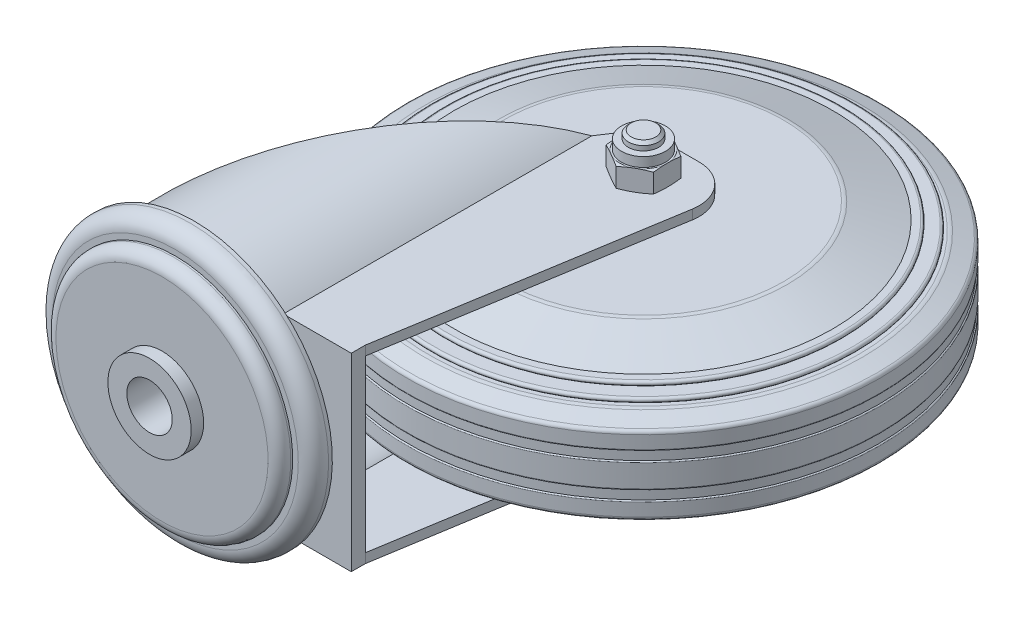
ISO-10303-21;
HEADER;
FILE_DESCRIPTION(('STEP AP214'),'2;1');
FILE_NAME('part.step','',(''),(''),'','','');
FILE_SCHEMA(('AUTOMOTIVE_DESIGN { 1 0 10303 214 1 1 1 1 }'));
ENDSEC;
DATA;
#1=APPLICATION_CONTEXT('core data for automotive mechanical design processes');
#2=APPLICATION_PROTOCOL_DEFINITION('international standard','automotive_design',2000,#1);
#3=PRODUCT_CONTEXT('',#1,'mechanical');
#4=PRODUCT('Part','Part','',(#3));
#5=PRODUCT_RELATED_PRODUCT_CATEGORY('part','',(#4));
#6=PRODUCT_DEFINITION_FORMATION('','',#4);
#7=PRODUCT_DEFINITION_CONTEXT('part definition',#1,'design');
#8=PRODUCT_DEFINITION('design','',#6,#7);
#9=PRODUCT_DEFINITION_SHAPE('','',#8);
#10=(LENGTH_UNIT() NAMED_UNIT(*) SI_UNIT(.MILLI.,.METRE.));
#11=(NAMED_UNIT(*) PLANE_ANGLE_UNIT() SI_UNIT($,.RADIAN.));
#12=(NAMED_UNIT(*) SI_UNIT($,.STERADIAN.) SOLID_ANGLE_UNIT());
#13=UNCERTAINTY_MEASURE_WITH_UNIT(LENGTH_MEASURE(1.E-05),#10,'distance_accuracy_value','');
#14=(GEOMETRIC_REPRESENTATION_CONTEXT(3) GLOBAL_UNCERTAINTY_ASSIGNED_CONTEXT((#13)) GLOBAL_UNIT_ASSIGNED_CONTEXT((#10,
#11,#12)) REPRESENTATION_CONTEXT('',''));
#15=CARTESIAN_POINT('',(0.,0.,0.));
#16=DIRECTION('',(0.,0.,1.));
#17=DIRECTION('',(1.,0.,0.));
#18=AXIS2_PLACEMENT_3D('',#15,#16,#17);
#19=CARTESIAN_POINT('',(37.,-3.00000000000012,-93.5));
#20=DIRECTION('',(0.,-1.,0.));
#21=DIRECTION('',(1.,0.,0.));
#22=AXIS2_PLACEMENT_3D('',#19,#20,#21);
#23=TOROIDAL_SURFACE('',#22,62.2,0.299999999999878);
#24=CARTESIAN_POINT('',(37.,-3.,-93.5));
#25=DIRECTION('',(0.,-1.,0.));
#26=DIRECTION('',(1.,0.,0.));
#27=AXIS2_PLACEMENT_3D('',#24,#25,#26);
#28=CIRCLE('',#27,62.5);
#29=CARTESIAN_POINT('',(99.5,-3.,-93.5));
#30=VERTEX_POINT('',#29);
#31=EDGE_CURVE('E9',#30,#30,#28,.T.);
#32=ORIENTED_EDGE('',*,*,#31,.T.);
#33=EDGE_LOOP('',(#32));
#34=FACE_BOUND('',#33,.T.);
#35=CARTESIAN_POINT('',(37.,-3.3,-93.5));
#36=DIRECTION('',(0.,-1.,0.));
#37=DIRECTION('',(1.,0.,0.));
#38=AXIS2_PLACEMENT_3D('',#35,#36,#37);
#39=CIRCLE('',#38,62.2);
#40=CARTESIAN_POINT('',(99.2,-3.3,-93.5));
#41=VERTEX_POINT('',#40);
#42=EDGE_CURVE('E957',#41,#41,#39,.T.);
#43=ORIENTED_EDGE('',*,*,#42,.F.);
#44=EDGE_LOOP('',(#43));
#45=FACE_BOUND('',#44,.T.);
#46=ADVANCED_FACE('F15',(#34,#45),#23,.T.);
#47=CARTESIAN_POINT('',(37.,-18.75,-93.5));
#48=DIRECTION('',(0.,-1.,0.));
#49=DIRECTION('',(1.,0.,0.));
#50=AXIS2_PLACEMENT_3D('',#47,#48,#49);
#51=CYLINDRICAL_SURFACE('',#50,62.5);
#52=CARTESIAN_POINT('',(37.,3.,-93.5));
#53=DIRECTION('',(0.,-1.,0.));
#54=DIRECTION('',(1.,0.,0.));
#55=AXIS2_PLACEMENT_3D('',#52,#53,#54);
#56=CIRCLE('',#55,62.5);
#57=CARTESIAN_POINT('',(99.5,3.,-93.5));
#58=VERTEX_POINT('',#57);
#59=EDGE_CURVE('E31',#58,#58,#56,.T.);
#60=ORIENTED_EDGE('',*,*,#59,.T.);
#61=EDGE_LOOP('',(#60));
#62=FACE_BOUND('',#61,.T.);
#63=ORIENTED_EDGE('',*,*,#31,.F.);
#64=EDGE_LOOP('',(#63));
#65=FACE_BOUND('',#64,.T.);
#66=ADVANCED_FACE('F814',(#62,#65),#51,.T.);
#67=CARTESIAN_POINT('',(37.,3.00000000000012,-93.5));
#68=DIRECTION('',(0.,-1.,0.));
#69=DIRECTION('',(1.,0.,0.));
#70=AXIS2_PLACEMENT_3D('',#67,#68,#69);
#71=TOROIDAL_SURFACE('',#70,62.2,0.299999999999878);
#72=CARTESIAN_POINT('',(37.,3.3,-93.5));
#73=DIRECTION('',(0.,-1.,0.));
#74=DIRECTION('',(1.,0.,0.));
#75=AXIS2_PLACEMENT_3D('',#72,#73,#74);
#76=CIRCLE('',#75,62.2);
#77=CARTESIAN_POINT('',(99.2,3.3,-93.5));
#78=VERTEX_POINT('',#77);
#79=EDGE_CURVE('E1043',#78,#78,#76,.T.);
#80=ORIENTED_EDGE('',*,*,#79,.T.);
#81=EDGE_LOOP('',(#80));
#82=FACE_BOUND('',#81,.T.);
#83=ORIENTED_EDGE('',*,*,#59,.F.);
#84=EDGE_LOOP('',(#83));
#85=FACE_BOUND('',#84,.T.);
#86=ADVANCED_FACE('F818',(#82,#85),#71,.T.);
#87=CARTESIAN_POINT('',(37.,-18.75,-93.5));
#88=DIRECTION('',(0.,-1.,0.));
#89=DIRECTION('',(1.,0.,0.));
#90=AXIS2_PLACEMENT_3D('',#87,#88,#89);
#91=CYLINDRICAL_SURFACE('',#90,62.2);
#92=CARTESIAN_POINT('',(37.,5.7,-93.5));
#93=DIRECTION('',(0.,-1.,0.));
#94=DIRECTION('',(1.,0.,0.));
#95=AXIS2_PLACEMENT_3D('',#92,#93,#94);
#96=CIRCLE('',#95,62.2);
#97=CARTESIAN_POINT('',(99.2,5.7,-93.5));
#98=VERTEX_POINT('',#97);
#99=EDGE_CURVE('E1040',#98,#98,#96,.T.);
#100=ORIENTED_EDGE('',*,*,#99,.T.);
#101=EDGE_LOOP('',(#100));
#102=FACE_BOUND('',#101,.T.);
#103=ORIENTED_EDGE('',*,*,#79,.F.);
#104=EDGE_LOOP('',(#103));
#105=FACE_BOUND('',#104,.T.);
#106=ADVANCED_FACE('F822',(#102,#105),#91,.T.);
#107=CARTESIAN_POINT('',(37.,5.99999999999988,-93.5));
#108=DIRECTION('',(0.,-1.,0.));
#109=DIRECTION('',(1.,0.,0.));
#110=AXIS2_PLACEMENT_3D('',#107,#108,#109);
#111=TOROIDAL_SURFACE('',#110,62.2,0.299999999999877);
#112=CARTESIAN_POINT('',(37.,6.,-93.5));
#113=DIRECTION('',(0.,-1.,0.));
#114=DIRECTION('',(1.,0.,0.));
#115=AXIS2_PLACEMENT_3D('',#112,#113,#114);
#116=CIRCLE('',#115,62.5);
#117=CARTESIAN_POINT('',(99.5,6.,-93.5));
#118=VERTEX_POINT('',#117);
#119=EDGE_CURVE('E1037',#118,#118,#116,.T.);
#120=ORIENTED_EDGE('',*,*,#119,.T.);
#121=EDGE_LOOP('',(#120));
#122=FACE_BOUND('',#121,.T.);
#123=ORIENTED_EDGE('',*,*,#99,.F.);
#124=EDGE_LOOP('',(#123));
#125=FACE_BOUND('',#124,.T.);
#126=ADVANCED_FACE('F826',(#122,#125),#111,.T.);
#127=CARTESIAN_POINT('',(37.,-18.75,-93.5));
#128=DIRECTION('',(0.,-1.,0.));
#129=DIRECTION('',(1.,0.,0.));
#130=AXIS2_PLACEMENT_3D('',#127,#128,#129);
#131=CYLINDRICAL_SURFACE('',#130,62.5);
#132=CARTESIAN_POINT('',(37.,9.4285165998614,-93.5));
#133=DIRECTION('',(0.,-1.,0.));
#134=DIRECTION('',(1.,0.,0.));
#135=AXIS2_PLACEMENT_3D('',#132,#133,#134);
#136=CIRCLE('',#135,62.5);
#137=CARTESIAN_POINT('',(99.5,9.4285165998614,-93.5));
#138=VERTEX_POINT('',#137);
#139=EDGE_CURVE('E1034',#138,#138,#136,.T.);
#140=ORIENTED_EDGE('',*,*,#139,.T.);
#141=EDGE_LOOP('',(#140));
#142=FACE_BOUND('',#141,.T.);
#143=ORIENTED_EDGE('',*,*,#119,.F.);
#144=EDGE_LOOP('',(#143));
#145=FACE_BOUND('',#144,.T.);
#146=ADVANCED_FACE('F830',(#142,#145),#131,.T.);
#147=CARTESIAN_POINT('',(37.,9.42851659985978,-93.5));
#148=DIRECTION('',(0.,-1.,0.));
#149=DIRECTION('',(1.,0.,0.));
#150=AXIS2_PLACEMENT_3D('',#147,#148,#149);
#151=TOROIDAL_SURFACE('',#150,61.4999999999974,1.00000000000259);
#152=CARTESIAN_POINT('',(37.,10.374035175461,-93.5));
#153=DIRECTION('',(0.,-1.,0.));
#154=DIRECTION('',(1.,0.,0.));
#155=AXIS2_PLACEMENT_3D('',#152,#153,#154);
#156=CIRCLE('',#155,61.825568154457);
#157=CARTESIAN_POINT('',(98.825568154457,10.374035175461,-93.5));
#158=VERTEX_POINT('',#157);
#159=EDGE_CURVE('E1031',#158,#158,#156,.T.);
#160=ORIENTED_EDGE('',*,*,#159,.T.);
#161=EDGE_LOOP('',(#160));
#162=FACE_BOUND('',#161,.T.);
#163=ORIENTED_EDGE('',*,*,#139,.F.);
#164=EDGE_LOOP('',(#163));
#165=FACE_BOUND('',#164,.T.);
#166=ADVANCED_FACE('F834',(#162,#165),#151,.T.);
#167=CARTESIAN_POINT('',(37.,10.374035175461,-93.5));
#168=DIRECTION('',(0.,-1.,0.));
#169=DIRECTION('',(1.,0.,0.));
#170=AXIS2_PLACEMENT_3D('',#167,#168,#169);
#171=CONICAL_SURFACE('',#170,61.825568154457,1.23918376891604);
#172=CARTESIAN_POINT('',(37.,11.782460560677,-93.5));
#173=DIRECTION('',(0.,-1.,0.));
#174=DIRECTION('',(1.,0.,0.));
#175=AXIS2_PLACEMENT_3D('',#172,#173,#174);
#176=CIRCLE('',#175,57.735203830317);
#177=CARTESIAN_POINT('',(94.735203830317,11.782460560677,-93.5));
#178=VERTEX_POINT('',#177);
#179=EDGE_CURVE('E1028',#178,#178,#176,.T.);
#180=ORIENTED_EDGE('',*,*,#179,.T.);
#181=EDGE_LOOP('',(#180));
#182=FACE_BOUND('',#181,.T.);
#183=ORIENTED_EDGE('',*,*,#159,.F.);
#184=EDGE_LOOP('',(#183));
#185=FACE_BOUND('',#184,.T.);
#186=ADVANCED_FACE('F838',(#182,#185),#171,.T.);
#187=CARTESIAN_POINT('',(37.,8.94590483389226,-93.5));
#188=DIRECTION('',(0.,-1.,0.));
#189=DIRECTION('',(1.,0.,0.));
#190=AXIS2_PLACEMENT_3D('',#187,#188,#189);
#191=TOROIDAL_SURFACE('',#190,56.7584993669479,2.99999999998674);
#192=CARTESIAN_POINT('',(37.,11.945904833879,-93.5));
#193=DIRECTION('',(0.,-1.,0.));
#194=DIRECTION('',(1.,0.,0.));
#195=AXIS2_PLACEMENT_3D('',#192,#193,#194);
#196=CIRCLE('',#195,56.758499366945);
#197=CARTESIAN_POINT('',(93.758499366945,11.945904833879,-93.5));
#198=VERTEX_POINT('',#197);
#199=EDGE_CURVE('E1025',#198,#198,#196,.T.);
#200=ORIENTED_EDGE('',*,*,#199,.T.);
#201=EDGE_LOOP('',(#200));
#202=FACE_BOUND('',#201,.T.);
#203=ORIENTED_EDGE('',*,*,#179,.F.);
#204=EDGE_LOOP('',(#203));
#205=FACE_BOUND('',#204,.T.);
#206=ADVANCED_FACE('F842',(#202,#205),#191,.T.);
#207=CARTESIAN_POINT('',(93.758499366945,11.945904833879,-93.5));
#208=DIRECTION('',(0.,1.,0.));
#209=DIRECTION('',(-1.,0.,0.));
#210=AXIS2_PLACEMENT_3D('',#207,#208,#209);
#211=PLANE('',#210);
#212=CARTESIAN_POINT('',(37.,11.945904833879,-93.5));
#213=DIRECTION('',(0.,-1.,0.));
#214=DIRECTION('',(1.,0.,0.));
#215=AXIS2_PLACEMENT_3D('',#212,#213,#214);
#216=CIRCLE('',#215,55.445395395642);
#217=CARTESIAN_POINT('',(92.445395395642,11.945904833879,-93.5));
#218=VERTEX_POINT('',#217);
#219=EDGE_CURVE('E1022',#218,#218,#216,.T.);
#220=ORIENTED_EDGE('',*,*,#219,.T.);
#221=EDGE_LOOP('',(#220));
#222=FACE_BOUND('',#221,.T.);
#223=ORIENTED_EDGE('',*,*,#199,.F.);
#224=EDGE_LOOP('',(#223));
#225=FACE_BOUND('',#224,.T.);
#226=ADVANCED_FACE('F846',(#222,#225),#211,.T.);
#227=CARTESIAN_POINT('',(37.,12.570904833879,-93.5));
#228=DIRECTION('',(0.,-1.,0.));
#229=DIRECTION('',(1.,0.,0.));
#230=AXIS2_PLACEMENT_3D('',#227,#228,#229);
#231=TOROIDAL_SURFACE('',#230,55.445395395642,0.625);
#232=CARTESIAN_POINT('',(37.,13.195904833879,-93.5));
#233=DIRECTION('',(0.,-1.,0.));
#234=DIRECTION('',(1.,0.,0.));
#235=AXIS2_PLACEMENT_3D('',#232,#233,#234);
#236=CIRCLE('',#235,55.445395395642);
#237=CARTESIAN_POINT('',(92.445395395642,13.195904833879,-93.5));
#238=VERTEX_POINT('',#237);
#239=EDGE_CURVE('E1019',#238,#238,#236,.T.);
#240=ORIENTED_EDGE('',*,*,#239,.T.);
#241=EDGE_LOOP('',(#240));
#242=FACE_BOUND('',#241,.T.);
#243=ORIENTED_EDGE('',*,*,#219,.F.);
#244=EDGE_LOOP('',(#243));
#245=FACE_BOUND('',#244,.T.);
#246=ADVANCED_FACE('F850',(#242,#245),#231,.T.);
#247=CARTESIAN_POINT('',(92.445395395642,13.195904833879,-93.5));
#248=DIRECTION('',(0.,1.,0.));
#249=DIRECTION('',(-1.,0.,0.));
#250=AXIS2_PLACEMENT_3D('',#247,#248,#249);
#251=PLANE('',#250);
#252=CARTESIAN_POINT('',(37.,13.195904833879,-93.5));
#253=DIRECTION('',(0.,-1.,0.));
#254=DIRECTION('',(1.,0.,0.));
#255=AXIS2_PLACEMENT_3D('',#252,#253,#254);
#256=CIRCLE('',#255,51.815131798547);
#257=CARTESIAN_POINT('',(88.815131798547,13.195904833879,-93.5));
#258=VERTEX_POINT('',#257);
#259=EDGE_CURVE('E1016',#258,#258,#256,.T.);
#260=ORIENTED_EDGE('',*,*,#259,.T.);
#261=EDGE_LOOP('',(#260));
#262=FACE_BOUND('',#261,.T.);
#263=ORIENTED_EDGE('',*,*,#239,.F.);
#264=EDGE_LOOP('',(#263));
#265=FACE_BOUND('',#264,.T.);
#266=ADVANCED_FACE('F854',(#262,#265),#251,.T.);
#267=CARTESIAN_POINT('',(37.,13.820904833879,-93.5));
#268=DIRECTION('',(0.,-1.,0.));
#269=DIRECTION('',(1.,0.,0.));
#270=AXIS2_PLACEMENT_3D('',#267,#268,#269);
#271=TOROIDAL_SURFACE('',#270,51.815131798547,0.625);
#272=CARTESIAN_POINT('',(37.,14.445904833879,-93.5));
#273=DIRECTION('',(0.,-1.,0.));
#274=DIRECTION('',(1.,0.,0.));
#275=AXIS2_PLACEMENT_3D('',#272,#273,#274);
#276=CIRCLE('',#275,51.815131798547);
#277=CARTESIAN_POINT('',(88.815131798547,14.445904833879,-93.5));
#278=VERTEX_POINT('',#277);
#279=EDGE_CURVE('E1013',#278,#278,#276,.T.);
#280=ORIENTED_EDGE('',*,*,#279,.T.);
#281=EDGE_LOOP('',(#280));
#282=FACE_BOUND('',#281,.T.);
#283=ORIENTED_EDGE('',*,*,#259,.F.);
#284=EDGE_LOOP('',(#283));
#285=FACE_BOUND('',#284,.T.);
#286=ADVANCED_FACE('F858',(#282,#285),#271,.T.);
#287=CARTESIAN_POINT('',(88.815131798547,14.445904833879,-93.5));
#288=DIRECTION('',(0.,1.,0.));
#289=DIRECTION('',(-1.,0.,0.));
#290=AXIS2_PLACEMENT_3D('',#287,#288,#289);
#291=PLANE('',#290);
#292=CARTESIAN_POINT('',(37.,14.445904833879,-93.5));
#293=DIRECTION('',(0.,-1.,0.));
#294=DIRECTION('',(1.,0.,0.));
#295=AXIS2_PLACEMENT_3D('',#292,#293,#294);
#296=CIRCLE('',#295,50.);
#297=CARTESIAN_POINT('',(87.,14.445904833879,-93.5));
#298=VERTEX_POINT('',#297);
#299=EDGE_CURVE('E1010',#298,#298,#296,.T.);
#300=ORIENTED_EDGE('',*,*,#299,.T.);
#301=EDGE_LOOP('',(#300));
#302=FACE_BOUND('',#301,.T.);
#303=ORIENTED_EDGE('',*,*,#279,.F.);
#304=EDGE_LOOP('',(#303));
#305=FACE_BOUND('',#304,.T.);
#306=ADVANCED_FACE('F862',(#302,#305),#291,.T.);
#307=CARTESIAN_POINT('',(37.,14.445904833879,-93.5));
#308=DIRECTION('',(0.,-1.,0.));
#309=DIRECTION('',(1.,0.,0.));
#310=AXIS2_PLACEMENT_3D('',#307,#308,#309);
#311=CONICAL_SURFACE('',#310,50.,1.23918376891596);
#312=CARTESIAN_POINT('',(37.,18.586555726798,-93.5));
#313=DIRECTION('',(0.,-1.,0.));
#314=DIRECTION('',(1.,0.,0.));
#315=AXIS2_PLACEMENT_3D('',#312,#313,#314);
#316=CIRCLE('',#315,37.974676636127);
#317=CARTESIAN_POINT('',(74.974676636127,18.586555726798,-93.5));
#318=VERTEX_POINT('',#317);
#319=EDGE_CURVE('E1007',#318,#318,#316,.T.);
#320=ORIENTED_EDGE('',*,*,#319,.T.);
#321=EDGE_LOOP('',(#320));
#322=FACE_BOUND('',#321,.T.);
#323=ORIENTED_EDGE('',*,*,#299,.F.);
#324=EDGE_LOOP('',(#323));
#325=FACE_BOUND('',#324,.T.);
#326=ADVANCED_FACE('F866',(#322,#325),#311,.T.);
#327=CARTESIAN_POINT('',(37.,15.7500000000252,-93.5));
#328=DIRECTION('',(0.,-1.,0.));
#329=DIRECTION('',(1.,0.,0.));
#330=AXIS2_PLACEMENT_3D('',#327,#328,#329);
#331=TOROIDAL_SURFACE('',#330,36.9979721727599,2.99999999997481);
#332=CARTESIAN_POINT('',(37.,18.75,-93.5));
#333=DIRECTION('',(0.,-1.,0.));
#334=DIRECTION('',(1.,0.,0.));
#335=AXIS2_PLACEMENT_3D('',#332,#333,#334);
#336=CIRCLE('',#335,36.997972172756);
#337=CARTESIAN_POINT('',(73.997972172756,18.75,-93.5));
#338=VERTEX_POINT('',#337);
#339=EDGE_CURVE('E1004',#338,#338,#336,.T.);
#340=ORIENTED_EDGE('',*,*,#339,.T.);
#341=EDGE_LOOP('',(#340));
#342=FACE_BOUND('',#341,.T.);
#343=ORIENTED_EDGE('',*,*,#319,.F.);
#344=EDGE_LOOP('',(#343));
#345=FACE_BOUND('',#344,.T.);
#346=ADVANCED_FACE('F870',(#342,#345),#331,.T.);
#347=CARTESIAN_POINT('',(73.997972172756,18.75,-93.5));
#348=DIRECTION('',(0.,1.,0.));
#349=DIRECTION('',(-1.,0.,0.));
#350=AXIS2_PLACEMENT_3D('',#347,#348,#349);
#351=PLANE('',#350);
#352=ORIENTED_EDGE('',*,*,#339,.F.);
#353=EDGE_LOOP('',(#352));
#354=FACE_BOUND('',#353,.T.);
#355=CARTESIAN_POINT('',(37.,18.75,-93.5));
#356=DIRECTION('',(0.,-1.,0.));
#357=DIRECTION('',(1.,0.,0.));
#358=AXIS2_PLACEMENT_3D('',#355,#356,#357);
#359=CIRCLE('',#358,7.5);
#360=CARTESIAN_POINT('',(44.5,18.75,-93.5));
#361=VERTEX_POINT('',#360);
#362=EDGE_CURVE('E954',#361,#361,#359,.T.);
#363=ORIENTED_EDGE('',*,*,#362,.T.);
#364=EDGE_LOOP('',(#363));
#365=FACE_BOUND('',#364,.T.);
#366=ADVANCED_FACE('F874',(#354,#365),#351,.T.);
#367=CARTESIAN_POINT('',(68.25,-18.75,-93.5));
#368=DIRECTION('',(0.,-1.,0.));
#369=DIRECTION('',(1.,0.,0.));
#370=AXIS2_PLACEMENT_3D('',#367,#368,#369);
#371=PLANE('',#370);
#372=CARTESIAN_POINT('',(37.,-18.75,-93.5));
#373=DIRECTION('',(0.,-1.,0.));
#374=DIRECTION('',(1.,0.,0.));
#375=AXIS2_PLACEMENT_3D('',#372,#373,#374);
#376=CIRCLE('',#375,36.997972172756);
#377=CARTESIAN_POINT('',(73.997972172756,-18.75,-93.5));
#378=VERTEX_POINT('',#377);
#379=EDGE_CURVE('E1001',#378,#378,#376,.T.);
#380=ORIENTED_EDGE('',*,*,#379,.T.);
#381=EDGE_LOOP('',(#380));
#382=FACE_BOUND('',#381,.T.);
#383=CARTESIAN_POINT('',(37.,-18.75,-93.5));
#384=DIRECTION('',(0.,-1.,0.));
#385=DIRECTION('',(1.,0.,0.));
#386=AXIS2_PLACEMENT_3D('',#383,#384,#385);
#387=CIRCLE('',#386,7.5);
#388=CARTESIAN_POINT('',(44.5,-18.75,-93.5));
#389=VERTEX_POINT('',#388);
#390=EDGE_CURVE('E633',#389,#389,#387,.T.);
#391=ORIENTED_EDGE('',*,*,#390,.F.);
#392=EDGE_LOOP('',(#391));
#393=FACE_BOUND('',#392,.T.);
#394=ADVANCED_FACE('F878',(#382,#393),#371,.T.);
#395=CARTESIAN_POINT('',(37.,-15.7500000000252,-93.5));
#396=DIRECTION('',(0.,-1.,0.));
#397=DIRECTION('',(1.,0.,0.));
#398=AXIS2_PLACEMENT_3D('',#395,#396,#397);
#399=TOROIDAL_SURFACE('',#398,36.9979721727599,2.99999999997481);
#400=CARTESIAN_POINT('',(37.,-18.586555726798,-93.5));
#401=DIRECTION('',(0.,-1.,0.));
#402=DIRECTION('',(1.,0.,0.));
#403=AXIS2_PLACEMENT_3D('',#400,#401,#402);
#404=CIRCLE('',#403,37.974676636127);
#405=CARTESIAN_POINT('',(74.974676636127,-18.586555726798,-93.5));
#406=VERTEX_POINT('',#405);
#407=EDGE_CURVE('E998',#406,#406,#404,.T.);
#408=ORIENTED_EDGE('',*,*,#407,.T.);
#409=EDGE_LOOP('',(#408));
#410=FACE_BOUND('',#409,.T.);
#411=ORIENTED_EDGE('',*,*,#379,.F.);
#412=EDGE_LOOP('',(#411));
#413=FACE_BOUND('',#412,.T.);
#414=ADVANCED_FACE('F882',(#410,#413),#399,.T.);
#415=CARTESIAN_POINT('',(37.,-18.586555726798,-93.5));
#416=DIRECTION('',(0.,1.,0.));
#417=DIRECTION('',(-1.,0.,0.));
#418=AXIS2_PLACEMENT_3D('',#415,#416,#417);
#419=CONICAL_SURFACE('',#418,37.974676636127,1.23918376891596);
#420=CARTESIAN_POINT('',(37.,-14.445904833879,-93.5));
#421=DIRECTION('',(0.,-1.,0.));
#422=DIRECTION('',(1.,0.,0.));
#423=AXIS2_PLACEMENT_3D('',#420,#421,#422);
#424=CIRCLE('',#423,50.);
#425=CARTESIAN_POINT('',(87.,-14.445904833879,-93.5));
#426=VERTEX_POINT('',#425);
#427=EDGE_CURVE('E995',#426,#426,#424,.T.);
#428=ORIENTED_EDGE('',*,*,#427,.T.);
#429=EDGE_LOOP('',(#428));
#430=FACE_BOUND('',#429,.T.);
#431=ORIENTED_EDGE('',*,*,#407,.F.);
#432=EDGE_LOOP('',(#431));
#433=FACE_BOUND('',#432,.T.);
#434=ADVANCED_FACE('F886',(#430,#433),#419,.T.);
#435=CARTESIAN_POINT('',(87.,-14.445904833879,-93.5));
#436=DIRECTION('',(0.,-1.,0.));
#437=DIRECTION('',(1.,0.,0.));
#438=AXIS2_PLACEMENT_3D('',#435,#436,#437);
#439=PLANE('',#438);
#440=CARTESIAN_POINT('',(37.,-14.445904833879,-93.5));
#441=DIRECTION('',(0.,-1.,0.));
#442=DIRECTION('',(1.,0.,0.));
#443=AXIS2_PLACEMENT_3D('',#440,#441,#442);
#444=CIRCLE('',#443,51.815131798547);
#445=CARTESIAN_POINT('',(88.815131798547,-14.445904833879,-93.5));
#446=VERTEX_POINT('',#445);
#447=EDGE_CURVE('E992',#446,#446,#444,.T.);
#448=ORIENTED_EDGE('',*,*,#447,.T.);
#449=EDGE_LOOP('',(#448));
#450=FACE_BOUND('',#449,.T.);
#451=ORIENTED_EDGE('',*,*,#427,.F.);
#452=EDGE_LOOP('',(#451));
#453=FACE_BOUND('',#452,.T.);
#454=ADVANCED_FACE('F890',(#450,#453),#439,.T.);
#455=CARTESIAN_POINT('',(37.,-13.820904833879,-93.5));
#456=DIRECTION('',(0.,-1.,0.));
#457=DIRECTION('',(1.,0.,0.));
#458=AXIS2_PLACEMENT_3D('',#455,#456,#457);
#459=TOROIDAL_SURFACE('',#458,51.815131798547,0.625);
#460=CARTESIAN_POINT('',(37.,-13.195904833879,-93.5));
#461=DIRECTION('',(0.,-1.,0.));
#462=DIRECTION('',(1.,0.,0.));
#463=AXIS2_PLACEMENT_3D('',#460,#461,#462);
#464=CIRCLE('',#463,51.815131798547);
#465=CARTESIAN_POINT('',(88.815131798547,-13.195904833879,-93.5));
#466=VERTEX_POINT('',#465);
#467=EDGE_CURVE('E989',#466,#466,#464,.T.);
#468=ORIENTED_EDGE('',*,*,#467,.T.);
#469=EDGE_LOOP('',(#468));
#470=FACE_BOUND('',#469,.T.);
#471=ORIENTED_EDGE('',*,*,#447,.F.);
#472=EDGE_LOOP('',(#471));
#473=FACE_BOUND('',#472,.T.);
#474=ADVANCED_FACE('F894',(#470,#473),#459,.T.);
#475=CARTESIAN_POINT('',(88.815131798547,-13.195904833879,-93.5));
#476=DIRECTION('',(0.,-1.,0.));
#477=DIRECTION('',(1.,0.,0.));
#478=AXIS2_PLACEMENT_3D('',#475,#476,#477);
#479=PLANE('',#478);
#480=CARTESIAN_POINT('',(37.,-13.195904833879,-93.5));
#481=DIRECTION('',(0.,-1.,0.));
#482=DIRECTION('',(1.,0.,0.));
#483=AXIS2_PLACEMENT_3D('',#480,#481,#482);
#484=CIRCLE('',#483,55.445395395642);
#485=CARTESIAN_POINT('',(92.445395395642,-13.195904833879,-93.5));
#486=VERTEX_POINT('',#485);
#487=EDGE_CURVE('E986',#486,#486,#484,.T.);
#488=ORIENTED_EDGE('',*,*,#487,.T.);
#489=EDGE_LOOP('',(#488));
#490=FACE_BOUND('',#489,.T.);
#491=ORIENTED_EDGE('',*,*,#467,.F.);
#492=EDGE_LOOP('',(#491));
#493=FACE_BOUND('',#492,.T.);
#494=ADVANCED_FACE('F898',(#490,#493),#479,.T.);
#495=CARTESIAN_POINT('',(37.,-12.570904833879,-93.5));
#496=DIRECTION('',(0.,-1.,0.));
#497=DIRECTION('',(1.,0.,0.));
#498=AXIS2_PLACEMENT_3D('',#495,#496,#497);
#499=TOROIDAL_SURFACE('',#498,55.445395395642,0.625);
#500=CARTESIAN_POINT('',(37.,-11.945904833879,-93.5));
#501=DIRECTION('',(0.,-1.,0.));
#502=DIRECTION('',(1.,0.,0.));
#503=AXIS2_PLACEMENT_3D('',#500,#501,#502);
#504=CIRCLE('',#503,55.445395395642);
#505=CARTESIAN_POINT('',(92.445395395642,-11.945904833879,-93.5));
#506=VERTEX_POINT('',#505);
#507=EDGE_CURVE('E983',#506,#506,#504,.T.);
#508=ORIENTED_EDGE('',*,*,#507,.T.);
#509=EDGE_LOOP('',(#508));
#510=FACE_BOUND('',#509,.T.);
#511=ORIENTED_EDGE('',*,*,#487,.F.);
#512=EDGE_LOOP('',(#511));
#513=FACE_BOUND('',#512,.T.);
#514=ADVANCED_FACE('F902',(#510,#513),#499,.T.);
#515=CARTESIAN_POINT('',(92.445395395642,-11.945904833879,-93.5));
#516=DIRECTION('',(0.,-1.,0.));
#517=DIRECTION('',(1.,0.,0.));
#518=AXIS2_PLACEMENT_3D('',#515,#516,#517);
#519=PLANE('',#518);
#520=CARTESIAN_POINT('',(37.,-11.945904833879,-93.5));
#521=DIRECTION('',(0.,-1.,0.));
#522=DIRECTION('',(1.,0.,0.));
#523=AXIS2_PLACEMENT_3D('',#520,#521,#522);
#524=CIRCLE('',#523,56.758499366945);
#525=CARTESIAN_POINT('',(93.758499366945,-11.945904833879,-93.5));
#526=VERTEX_POINT('',#525);
#527=EDGE_CURVE('E980',#526,#526,#524,.T.);
#528=ORIENTED_EDGE('',*,*,#527,.T.);
#529=EDGE_LOOP('',(#528));
#530=FACE_BOUND('',#529,.T.);
#531=ORIENTED_EDGE('',*,*,#507,.F.);
#532=EDGE_LOOP('',(#531));
#533=FACE_BOUND('',#532,.T.);
#534=ADVANCED_FACE('F906',(#530,#533),#519,.T.);
#535=CARTESIAN_POINT('',(37.,-8.94590483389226,-93.5));
#536=DIRECTION('',(0.,-1.,0.));
#537=DIRECTION('',(1.,0.,0.));
#538=AXIS2_PLACEMENT_3D('',#535,#536,#537);
#539=TOROIDAL_SURFACE('',#538,56.7584993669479,2.99999999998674);
#540=CARTESIAN_POINT('',(37.,-11.782460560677,-93.5));
#541=DIRECTION('',(0.,-1.,0.));
#542=DIRECTION('',(1.,0.,0.));
#543=AXIS2_PLACEMENT_3D('',#540,#541,#542);
#544=CIRCLE('',#543,57.735203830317);
#545=CARTESIAN_POINT('',(94.735203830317,-11.782460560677,-93.5));
#546=VERTEX_POINT('',#545);
#547=EDGE_CURVE('E977',#546,#546,#544,.T.);
#548=ORIENTED_EDGE('',*,*,#547,.T.);
#549=EDGE_LOOP('',(#548));
#550=FACE_BOUND('',#549,.T.);
#551=ORIENTED_EDGE('',*,*,#527,.F.);
#552=EDGE_LOOP('',(#551));
#553=FACE_BOUND('',#552,.T.);
#554=ADVANCED_FACE('F910',(#550,#553),#539,.T.);
#555=CARTESIAN_POINT('',(37.,-11.782460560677,-93.5));
#556=DIRECTION('',(0.,1.,0.));
#557=DIRECTION('',(-1.,0.,0.));
#558=AXIS2_PLACEMENT_3D('',#555,#556,#557);
#559=CONICAL_SURFACE('',#558,57.735203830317,1.23918376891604);
#560=CARTESIAN_POINT('',(37.,-10.374035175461,-93.5));
#561=DIRECTION('',(0.,-1.,0.));
#562=DIRECTION('',(1.,0.,0.));
#563=AXIS2_PLACEMENT_3D('',#560,#561,#562);
#564=CIRCLE('',#563,61.825568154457);
#565=CARTESIAN_POINT('',(98.825568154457,-10.374035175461,-93.5));
#566=VERTEX_POINT('',#565);
#567=EDGE_CURVE('E974',#566,#566,#564,.T.);
#568=ORIENTED_EDGE('',*,*,#567,.T.);
#569=EDGE_LOOP('',(#568));
#570=FACE_BOUND('',#569,.T.);
#571=ORIENTED_EDGE('',*,*,#547,.F.);
#572=EDGE_LOOP('',(#571));
#573=FACE_BOUND('',#572,.T.);
#574=ADVANCED_FACE('F914',(#570,#573),#559,.T.);
#575=CARTESIAN_POINT('',(37.,-9.42851659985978,-93.5));
#576=DIRECTION('',(0.,-1.,0.));
#577=DIRECTION('',(1.,0.,0.));
#578=AXIS2_PLACEMENT_3D('',#575,#576,#577);
#579=TOROIDAL_SURFACE('',#578,61.4999999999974,1.00000000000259);
#580=CARTESIAN_POINT('',(37.,-9.4285165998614,-93.5));
#581=DIRECTION('',(0.,-1.,0.));
#582=DIRECTION('',(1.,0.,0.));
#583=AXIS2_PLACEMENT_3D('',#580,#581,#582);
#584=CIRCLE('',#583,62.5);
#585=CARTESIAN_POINT('',(99.5,-9.4285165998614,-93.5));
#586=VERTEX_POINT('',#585);
#587=EDGE_CURVE('E971',#586,#586,#584,.T.);
#588=ORIENTED_EDGE('',*,*,#587,.T.);
#589=EDGE_LOOP('',(#588));
#590=FACE_BOUND('',#589,.T.);
#591=ORIENTED_EDGE('',*,*,#567,.F.);
#592=EDGE_LOOP('',(#591));
#593=FACE_BOUND('',#592,.T.);
#594=ADVANCED_FACE('F918',(#590,#593),#579,.T.);
#595=CARTESIAN_POINT('',(37.,-18.75,-93.5));
#596=DIRECTION('',(0.,-1.,0.));
#597=DIRECTION('',(1.,0.,0.));
#598=AXIS2_PLACEMENT_3D('',#595,#596,#597);
#599=CYLINDRICAL_SURFACE('',#598,62.5);
#600=CARTESIAN_POINT('',(37.,-6.,-93.5));
#601=DIRECTION('',(0.,-1.,0.));
#602=DIRECTION('',(1.,0.,0.));
#603=AXIS2_PLACEMENT_3D('',#600,#601,#602);
#604=CIRCLE('',#603,62.5);
#605=CARTESIAN_POINT('',(99.5,-6.,-93.5));
#606=VERTEX_POINT('',#605);
#607=EDGE_CURVE('E968',#606,#606,#604,.T.);
#608=ORIENTED_EDGE('',*,*,#607,.T.);
#609=EDGE_LOOP('',(#608));
#610=FACE_BOUND('',#609,.T.);
#611=ORIENTED_EDGE('',*,*,#587,.F.);
#612=EDGE_LOOP('',(#611));
#613=FACE_BOUND('',#612,.T.);
#614=ADVANCED_FACE('F922',(#610,#613),#599,.T.);
#615=CARTESIAN_POINT('',(37.,-5.99999999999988,-93.5));
#616=DIRECTION('',(0.,-1.,0.));
#617=DIRECTION('',(1.,0.,0.));
#618=AXIS2_PLACEMENT_3D('',#615,#616,#617);
#619=TOROIDAL_SURFACE('',#618,62.2,0.299999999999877);
#620=CARTESIAN_POINT('',(37.,-5.7,-93.5));
#621=DIRECTION('',(0.,-1.,0.));
#622=DIRECTION('',(1.,0.,0.));
#623=AXIS2_PLACEMENT_3D('',#620,#621,#622);
#624=CIRCLE('',#623,62.2);
#625=CARTESIAN_POINT('',(99.2,-5.7,-93.5));
#626=VERTEX_POINT('',#625);
#627=EDGE_CURVE('E965',#626,#626,#624,.T.);
#628=ORIENTED_EDGE('',*,*,#627,.T.);
#629=EDGE_LOOP('',(#628));
#630=FACE_BOUND('',#629,.T.);
#631=ORIENTED_EDGE('',*,*,#607,.F.);
#632=EDGE_LOOP('',(#631));
#633=FACE_BOUND('',#632,.T.);
#634=ADVANCED_FACE('F926',(#630,#633),#619,.T.);
#635=CARTESIAN_POINT('',(37.,-18.75,-93.5));
#636=DIRECTION('',(0.,-1.,0.));
#637=DIRECTION('',(1.,0.,0.));
#638=AXIS2_PLACEMENT_3D('',#635,#636,#637);
#639=CYLINDRICAL_SURFACE('',#638,62.2);
#640=ORIENTED_EDGE('',*,*,#42,.T.);
#641=EDGE_LOOP('',(#640));
#642=FACE_BOUND('',#641,.T.);
#643=ORIENTED_EDGE('',*,*,#627,.F.);
#644=EDGE_LOOP('',(#643));
#645=FACE_BOUND('',#644,.T.);
#646=ADVANCED_FACE('F930',(#642,#645),#639,.T.);
#647=CARTESIAN_POINT('',(37.,35.,-90.267));
#648=DIRECTION('',(0.,1.,0.));
#649=DIRECTION('',(-1.,0.,0.));
#650=AXIS2_PLACEMENT_3D('',#647,#648,#649);
#651=PLANE('',#650);
#652=CARTESIAN_POINT('',(37.,35.,-93.5));
#653=DIRECTION('',(0.,-1.,0.));
#654=DIRECTION('',(1.,0.,0.));
#655=AXIS2_PLACEMENT_3D('',#652,#653,#654);
#656=CIRCLE('',#655,3.233);
#657=CARTESIAN_POINT('',(40.233,35.,-93.5));
#658=VERTEX_POINT('',#657);
#659=EDGE_CURVE('E3172',#658,#658,#656,.T.);
#660=ORIENTED_EDGE('',*,*,#659,.F.);
#661=EDGE_LOOP('',(#660));
#662=FACE_BOUND('',#661,.T.);
#663=ADVANCED_FACE('F934',(#662),#651,.T.);
#664=CARTESIAN_POINT('',(37.,34.233,-93.5));
#665=DIRECTION('',(0.,-1.,0.));
#666=DIRECTION('',(1.,0.,0.));
#667=AXIS2_PLACEMENT_3D('',#664,#665,#666);
#668=CONICAL_SURFACE('',#667,4.,0.785398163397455);
#669=ORIENTED_EDGE('',*,*,#659,.T.);
#670=EDGE_LOOP('',(#669));
#671=FACE_BOUND('',#670,.T.);
#672=CARTESIAN_POINT('',(37.,34.233,-93.5));
#673=DIRECTION('',(0.,-1.,0.));
#674=DIRECTION('',(1.,0.,0.));
#675=AXIS2_PLACEMENT_3D('',#672,#673,#674);
#676=CIRCLE('',#675,4.);
#677=CARTESIAN_POINT('',(41.,34.233,-93.5));
#678=VERTEX_POINT('',#677);
#679=EDGE_CURVE('E3175',#678,#678,#676,.T.);
#680=ORIENTED_EDGE('',*,*,#679,.F.);
#681=EDGE_LOOP('',(#680));
#682=FACE_BOUND('',#681,.T.);
#683=ADVANCED_FACE('F1805',(#671,#682),#668,.T.);
#684=CARTESIAN_POINT('',(37.,35.,-93.5));
#685=DIRECTION('',(0.,-1.,0.));
#686=DIRECTION('',(1.,0.,0.));
#687=AXIS2_PLACEMENT_3D('',#684,#685,#686);
#688=CYLINDRICAL_SURFACE('',#687,4.);
#689=ORIENTED_EDGE('',*,*,#679,.T.);
#690=EDGE_LOOP('',(#689));
#691=FACE_BOUND('',#690,.T.);
#692=CARTESIAN_POINT('',(37.,33.,-93.5));
#693=DIRECTION('',(0.,-1.,0.));
#694=DIRECTION('',(1.,0.,0.));
#695=AXIS2_PLACEMENT_3D('',#692,#693,#694);
#696=CIRCLE('',#695,4.);
#697=CARTESIAN_POINT('',(41.,33.,-93.5));
#698=VERTEX_POINT('',#697);
#699=EDGE_CURVE('E3275',#698,#698,#696,.T.);
#700=ORIENTED_EDGE('',*,*,#699,.F.);
#701=EDGE_LOOP('',(#700));
#702=FACE_BOUND('',#701,.T.);
#703=ADVANCED_FACE('F1244',(#691,#702),#688,.T.);
#704=CARTESIAN_POINT('',(37.,33.,-89.5));
#705=DIRECTION('',(0.,-1.,0.));
#706=DIRECTION('',(1.,0.,0.));
#707=AXIS2_PLACEMENT_3D('',#704,#705,#706);
#708=PLANE('',#707);
#709=CARTESIAN_POINT('',(37.,33.,-93.5));
#710=DIRECTION('',(0.,-1.,0.));
#711=DIRECTION('',(1.,0.,0.));
#712=AXIS2_PLACEMENT_3D('',#709,#710,#711);
#713=CIRCLE('',#712,5.815);
#714=CARTESIAN_POINT('',(42.815,33.,-93.5));
#715=VERTEX_POINT('',#714);
#716=EDGE_CURVE('E3278',#715,#715,#713,.T.);
#717=ORIENTED_EDGE('',*,*,#716,.F.);
#718=EDGE_LOOP('',(#717));
#719=FACE_BOUND('',#718,.T.);
#720=ORIENTED_EDGE('',*,*,#699,.T.);
#721=EDGE_LOOP('',(#720));
#722=FACE_BOUND('',#721,.T.);
#723=ADVANCED_FACE('F1782',(#719,#722),#708,.F.);
#724=CARTESIAN_POINT('',(37.,-30.3,-93.5));
#725=DIRECTION('',(0.,-1.,0.));
#726=DIRECTION('',(1.,0.,0.));
#727=AXIS2_PLACEMENT_3D('',#724,#725,#726);
#728=PLANE('',#727);
#729=CARTESIAN_POINT('',(37.,-30.3,-93.5));
#730=DIRECTION('',(0.,-1.,0.));
#731=DIRECTION('',(1.,0.,0.));
#732=AXIS2_PLACEMENT_3D('',#729,#730,#731);
#733=CIRCLE('',#732,6.2583333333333);
#734=CARTESIAN_POINT('',(43.2583333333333,-30.3,-93.5));
#735=VERTEX_POINT('',#734);
#736=CARTESIAN_POINT('',(40.1291666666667,-30.3,-88.0801243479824));
#737=VERTEX_POINT('',#736);
#738=EDGE_CURVE('E3189',#735,#737,#733,.T.);
#739=ORIENTED_EDGE('',*,*,#738,.T.);
#740=CARTESIAN_POINT('',(33.8708333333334,-30.3,-88.0801243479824));
#741=VERTEX_POINT('',#740);
#742=EDGE_CURVE('E3191',#737,#741,#733,.T.);
#743=ORIENTED_EDGE('',*,*,#742,.T.);
#744=CARTESIAN_POINT('',(30.7416666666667,-30.3,-93.5));
#745=VERTEX_POINT('',#744);
#746=EDGE_CURVE('E3196',#741,#745,#733,.T.);
#747=ORIENTED_EDGE('',*,*,#746,.T.);
#748=CARTESIAN_POINT('',(33.8708333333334,-30.3,-98.9198756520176));
#749=VERTEX_POINT('',#748);
#750=EDGE_CURVE('E3200',#745,#749,#733,.T.);
#751=ORIENTED_EDGE('',*,*,#750,.T.);
#752=CARTESIAN_POINT('',(40.1291666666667,-30.3,-98.9198756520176));
#753=VERTEX_POINT('',#752);
#754=EDGE_CURVE('E3197',#749,#753,#733,.T.);
#755=ORIENTED_EDGE('',*,*,#754,.T.);
#756=EDGE_CURVE('E3187',#753,#735,#733,.T.);
#757=ORIENTED_EDGE('',*,*,#756,.T.);
#758=EDGE_LOOP('',(#739,#743,#747,#751,#755,#757));
#759=FACE_BOUND('',#758,.T.);
#760=ADVANCED_FACE('F17',(#759),#728,.T.);
#761=CARTESIAN_POINT('',(0.,0.,-6.2999999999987));
#762=DIRECTION('',(0.,0.,1.));
#763=DIRECTION('',(0.,1.,0.));
#764=AXIS2_PLACEMENT_3D('',#761,#762,#763);
#765=TOROIDAL_SURFACE('',#764,28.0250000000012,2.99999999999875);
#766=CARTESIAN_POINT('',(0.,0.,-6.3));
#767=DIRECTION('',(0.,0.,1.));
#768=DIRECTION('',(0.,1.,0.));
#769=AXIS2_PLACEMENT_3D('',#766,#767,#768);
#770=CIRCLE('',#769,31.025);
#771=CARTESIAN_POINT('',(0.,31.025,-6.3));
#772=VERTEX_POINT('',#771);
#773=EDGE_CURVE('E480',#772,#772,#770,.T.);
#774=ORIENTED_EDGE('',*,*,#773,.T.);
#775=EDGE_LOOP('',(#774));
#776=FACE_BOUND('',#775,.T.);
#777=CARTESIAN_POINT('',(0.,0.,-3.3));
#778=DIRECTION('',(0.,0.,1.));
#779=DIRECTION('',(0.,1.,0.));
#780=AXIS2_PLACEMENT_3D('',#777,#778,#779);
#781=CIRCLE('',#780,28.025);
#782=CARTESIAN_POINT('',(0.,28.025,-3.3));
#783=VERTEX_POINT('',#782);
#784=EDGE_CURVE('E483',#783,#783,#781,.T.);
#785=ORIENTED_EDGE('',*,*,#784,.F.);
#786=EDGE_LOOP('',(#785));
#787=FACE_BOUND('',#786,.T.);
#788=ADVANCED_FACE('F781',(#776,#787),#765,.T.);
#789=CARTESIAN_POINT('',(37.,33.,-93.5));
#790=DIRECTION('',(0.,-1.,0.));
#791=DIRECTION('',(1.,0.,0.));
#792=AXIS2_PLACEMENT_3D('',#789,#790,#791);
#793=CYLINDRICAL_SURFACE('',#792,5.815);
#794=CARTESIAN_POINT('',(37.,30.5,-93.5));
#795=DIRECTION('',(0.,-1.,0.));
#796=DIRECTION('',(1.,0.,0.));
#797=AXIS2_PLACEMENT_3D('',#794,#795,#796);
#798=CIRCLE('',#797,5.815);
#799=CARTESIAN_POINT('',(42.815,30.5,-93.5));
#800=VERTEX_POINT('',#799);
#801=EDGE_CURVE('E3280',#800,#800,#798,.T.);
#802=ORIENTED_EDGE('',*,*,#801,.F.);
#803=EDGE_LOOP('',(#802));
#804=FACE_BOUND('',#803,.T.);
#805=ORIENTED_EDGE('',*,*,#716,.T.);
#806=EDGE_LOOP('',(#805));
#807=FACE_BOUND('',#806,.T.);
#808=ADVANCED_FACE('F784',(#804,#807),#793,.T.);
#809=CARTESIAN_POINT('',(0.,0.,-11.8));
#810=DIRECTION('',(0.,0.,1.));
#811=DIRECTION('',(0.,1.,0.));
#812=AXIS2_PLACEMENT_3D('',#809,#810,#811);
#813=CYLINDRICAL_SURFACE('',#812,31.025);
#814=CARTESIAN_POINT('',(0.,0.,-6.8));
#815=DIRECTION('',(0.,0.,1.));
#816=DIRECTION('',(0.,1.,0.));
#817=AXIS2_PLACEMENT_3D('',#814,#815,#816);
#818=CIRCLE('',#817,31.025);
#819=CARTESIAN_POINT('',(0.,31.025,-6.8));
#820=VERTEX_POINT('',#819);
#821=EDGE_CURVE('E477',#820,#820,#818,.T.);
#822=ORIENTED_EDGE('',*,*,#821,.T.);
#823=EDGE_LOOP('',(#822));
#824=FACE_BOUND('',#823,.T.);
#825=ORIENTED_EDGE('',*,*,#773,.F.);
#826=EDGE_LOOP('',(#825));
#827=FACE_BOUND('',#826,.T.);
#828=ADVANCED_FACE('F786',(#824,#827),#813,.T.);
#829=CARTESIAN_POINT('',(37.,-30.3,-93.5));
#830=DIRECTION('',(0.,1.,0.));
#831=DIRECTION('',(-1.,0.,0.));
#832=AXIS2_PLACEMENT_3D('',#829,#830,#831);
#833=CONICAL_SURFACE('',#832,6.2583333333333,1.30899693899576);
#834=CARTESIAN_POINT('',(30.7416666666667,-28.915610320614,-103.058381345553));
#835=CARTESIAN_POINT('',(30.7416666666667,-28.9792409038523,-102.774458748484));
#836=CARTESIAN_POINT('',(30.7416666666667,-29.0420932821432,-102.490358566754));
#837=CARTESIAN_POINT('',(30.7416666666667,-29.1658215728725,-101.921715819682));
#838=CARTESIAN_POINT('',(30.7416666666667,-29.2266973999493,-101.637173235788));
#839=CARTESIAN_POINT('',(30.7416666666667,-29.3461055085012,-101.067303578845));
#840=CARTESIAN_POINT('',(30.7416666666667,-29.4046354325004,-100.781976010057));
#841=CARTESIAN_POINT('',(30.7416666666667,-29.518719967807,-100.210726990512));
#842=CARTESIAN_POINT('',(30.7416666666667,-29.5742746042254,-99.9248055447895));
#843=CARTESIAN_POINT('',(30.7416666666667,-29.6812719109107,-99.3545457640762));
#844=CARTESIAN_POINT('',(30.7416666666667,-29.7327437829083,-99.0702129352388));
#845=CARTESIAN_POINT('',(30.7416666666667,-29.8311937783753,-98.5007717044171));
#846=CARTESIAN_POINT('',(30.7416666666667,-29.8781720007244,-98.2156633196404));
#847=CARTESIAN_POINT('',(30.7416666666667,-29.966576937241,-97.6446156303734));
#848=CARTESIAN_POINT('',(30.7416666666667,-30.0080043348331,-97.3586764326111));
#849=CARTESIAN_POINT('',(30.7416666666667,-30.0840868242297,-96.7858881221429));
#850=CARTESIAN_POINT('',(30.7416666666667,-30.1187419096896,-96.4990390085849));
#851=CARTESIAN_POINT('',(30.7416666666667,-30.1802984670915,-95.9211946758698));
#852=CARTESIAN_POINT('',(30.7416666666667,-30.2071071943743,-95.6301894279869));
#853=CARTESIAN_POINT('',(30.7416666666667,-30.2511216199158,-95.0474473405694));
#854=CARTESIAN_POINT('',(30.7416666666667,-30.2683275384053,-94.7557105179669));
#855=CARTESIAN_POINT('',(30.7416666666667,-30.2921328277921,-94.1719284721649));
#856=CARTESIAN_POINT('',(30.7416666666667,-30.2987370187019,-93.8798834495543));
#857=CARTESIAN_POINT('',(30.7416666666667,-30.3009328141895,-93.2957514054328));
#858=CARTESIAN_POINT('',(30.7416666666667,-30.2965244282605,-93.0036643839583));
#859=CARTESIAN_POINT('',(30.7416666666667,-30.2769429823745,-92.4187958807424));
#860=CARTESIAN_POINT('',(30.7416666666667,-30.2617308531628,-92.1260157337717));
#861=CARTESIAN_POINT('',(30.7416666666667,-30.2214102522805,-91.5411439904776));
#862=CARTESIAN_POINT('',(30.7416666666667,-30.1963015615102,-91.2490524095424));
#863=CARTESIAN_POINT('',(30.7416666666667,-30.1374561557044,-90.6655602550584));
#864=CARTESIAN_POINT('',(30.7416666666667,-30.1037138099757,-90.3741602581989));
#865=CARTESIAN_POINT('',(30.7416666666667,-30.0290051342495,-89.7922980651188));
#866=CARTESIAN_POINT('',(30.7416666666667,-29.9880387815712,-89.5018358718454));
#867=CARTESIAN_POINT('',(30.7416666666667,-29.9031009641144,-88.9410220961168));
#868=CARTESIAN_POINT('',(30.7416666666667,-29.8595081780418,-88.6706125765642));
#869=CARTESIAN_POINT('',(30.7416666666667,-29.7680911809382,-88.1305062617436));
#870=CARTESIAN_POINT('',(30.7416666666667,-29.7202668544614,-87.8608094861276));
#871=CARTESIAN_POINT('',(30.7416666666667,-29.6211609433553,-87.322029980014));
#872=CARTESIAN_POINT('',(30.7416666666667,-29.5698790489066,-87.0529473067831));
#873=CARTESIAN_POINT('',(30.7416666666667,-29.4644891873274,-86.5153346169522));
#874=CARTESIAN_POINT('',(30.7416666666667,-29.4103811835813,-86.2468046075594));
#875=CARTESIAN_POINT('',(30.7416666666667,-29.2445857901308,-85.4418059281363));
#876=CARTESIAN_POINT('',(30.7416666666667,-29.1294495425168,-84.9060483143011));
#877=CARTESIAN_POINT('',(30.7416666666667,-28.8929441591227,-83.8359578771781));
#878=CARTESIAN_POINT('',(30.7416666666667,-28.7715753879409,-83.3016249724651));
#879=CARTESIAN_POINT('',(30.7416666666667,-28.5256612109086,-82.2392239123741));
#880=CARTESIAN_POINT('',(30.7416666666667,-28.4011587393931,-81.7111457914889));
#881=CARTESIAN_POINT('',(30.7416666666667,-28.1490368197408,-80.6557262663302));
#882=CARTESIAN_POINT('',(30.7416666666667,-28.02141731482,-80.1283848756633));
#883=CARTESIAN_POINT('',(30.7416666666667,-27.7640342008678,-79.0749162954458));
#884=CARTESIAN_POINT('',(30.7416666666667,-27.6342734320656,-78.5487884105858));
#885=CARTESIAN_POINT('',(30.7416666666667,-27.3729800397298,-77.4969909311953));
#886=CARTESIAN_POINT('',(30.7416666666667,-27.2414474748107,-76.9713213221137));
#887=CARTESIAN_POINT('',(30.7416666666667,-27.109287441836,-76.4458114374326));
#888=B_SPLINE_CURVE_WITH_KNOTS('',3,(#834,#835,#836,#837,#838,#839,#840,#841,#842,#843,#844,
#845,#846,#847,#848,#849,#850,#851,#852,#853,#854,#855,#856,#857,#858,#859,#860,#861,#862,#863,
#864,#865,#866,#867,#868,#869,#870,#871,#872,#873,#874,#875,#876,#877,#878,#879,#880,#881,#882,
#883,#884,#885,#886,#887),.UNSPECIFIED.,.F.,.F.,(4,2,2,2,2,2,2,2,2,2,2,2,2,2,2,2,2,2,2,2,2,2,2,
2,2,2,4),(0.,0.872899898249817,1.74583744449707,2.61963129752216,3.49341777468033,
4.36025148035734,5.22706610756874,6.09377391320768,6.96048253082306,7.83705637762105,
8.71361012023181,9.58976522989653,10.465919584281,11.3452585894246,12.2246170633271,
13.1045505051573,13.9844867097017,14.8061494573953,15.6278346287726,16.4495935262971,
17.2713630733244,18.9152675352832,20.5590759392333,22.186731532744,23.8144167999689,
25.4400934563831,27.0657164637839),.UNSPECIFIED.);
#889=CARTESIAN_POINT('',(30.7416666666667,-30.0405802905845,-89.8867495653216));
#890=VERTEX_POINT('',#889);
#891=EDGE_CURVE('E3147',#745,#890,#888,.T.);
#892=ORIENTED_EDGE('',*,*,#891,.F.);
#893=ORIENTED_EDGE('',*,*,#746,.F.);
#894=CARTESIAN_POINT('',(30.7414666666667,-30.0405493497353,-89.8868650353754));
#895=CARTESIAN_POINT('',(31.0013760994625,-30.0807746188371,-89.7368062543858));
#896=CARTESIAN_POINT('',(31.2617567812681,-30.1172925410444,-89.5864753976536));
#897=CARTESIAN_POINT('',(31.783437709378,-30.1814511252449,-89.2852827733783));
#898=CARTESIAN_POINT('',(32.0447382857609,-30.2090881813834,-89.1344208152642));
#899=CARTESIAN_POINT('',(32.5666747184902,-30.2538715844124,-88.833080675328));
#900=CARTESIAN_POINT('',(32.8273070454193,-30.2710713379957,-88.682604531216));
#901=CARTESIAN_POINT('',(33.3489040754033,-30.2941344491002,-88.3814603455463));
#902=CARTESIAN_POINT('',(33.6098687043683,-30.3,-88.2307923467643));
#903=CARTESIAN_POINT('',(34.1317979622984,-30.3,-87.9294563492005));
#904=CARTESIAN_POINT('',(34.3927625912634,-30.2941344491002,-87.7787883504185));
#905=CARTESIAN_POINT('',(34.9143596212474,-30.2710713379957,-87.4776441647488));
#906=CARTESIAN_POINT('',(35.1749919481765,-30.2538715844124,-87.3271680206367));
#907=CARTESIAN_POINT('',(35.6969283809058,-30.2090881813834,-87.0258278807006));
#908=CARTESIAN_POINT('',(35.9582289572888,-30.1814511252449,-86.8749659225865));
#909=CARTESIAN_POINT('',(36.4799098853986,-30.1172925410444,-86.5737732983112));
#910=CARTESIAN_POINT('',(36.7402905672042,-30.0807746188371,-86.423442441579));
#911=CARTESIAN_POINT('',(37.0002,-30.0405493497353,-86.2733836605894));
#912=B_SPLINE_CURVE_WITH_KNOTS('',3,(#894,#895,#896,#897,#898,#899,#900,#901,#902,#903,#904,
#905,#906,#907,#908,#909,#910,#911),.UNSPECIFIED.,.F.,.F.,(4,2,2,2,2,2,2,2,4),(0.,
0.908451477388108,1.81727134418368,2.72140076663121,3.62535520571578,4.52930964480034,
5.43343906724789,6.34225893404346,7.25071041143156),.UNSPECIFIED.);
#913=EDGE_CURVE('E3157',#890,#741,#912,.T.);
#914=ORIENTED_EDGE('',*,*,#913,.F.);
#915=EDGE_LOOP('',(#892,#893,#914));
#916=FACE_BOUND('',#915,.T.);
#917=ADVANCED_FACE('F789',(#916),#833,.T.);
#918=CARTESIAN_POINT('',(30.7416666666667,-30.0405802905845,-97.1132504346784));
#919=VERTEX_POINT('',#918);
#920=EDGE_CURVE('E3146',#919,#745,#888,.T.);
#921=ORIENTED_EDGE('',*,*,#920,.F.);
#922=CARTESIAN_POINT('',(37.0002,-30.0405493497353,-100.726616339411));
#923=CARTESIAN_POINT('',(36.7402905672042,-30.0807746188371,-100.576557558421));
#924=CARTESIAN_POINT('',(36.4799098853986,-30.1172925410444,-100.426226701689));
#925=CARTESIAN_POINT('',(35.9582289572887,-30.1814511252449,-100.125034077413));
#926=CARTESIAN_POINT('',(35.6969283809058,-30.2090881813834,-99.9741721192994));
#927=CARTESIAN_POINT('',(35.1749919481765,-30.2538715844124,-99.6728319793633));
#928=CARTESIAN_POINT('',(34.9143596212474,-30.2710713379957,-99.5223558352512));
#929=CARTESIAN_POINT('',(34.3927625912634,-30.2941344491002,-99.2212116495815));
#930=CARTESIAN_POINT('',(34.1317979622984,-30.3,-99.0705436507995));
#931=CARTESIAN_POINT('',(33.6098687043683,-30.3,-98.7692076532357));
#932=CARTESIAN_POINT('',(33.3489040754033,-30.2941344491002,-98.6185396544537));
#933=CARTESIAN_POINT('',(32.8273070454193,-30.2710713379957,-98.317395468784));
#934=CARTESIAN_POINT('',(32.5666747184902,-30.2538715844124,-98.1669193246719));
#935=CARTESIAN_POINT('',(32.0447382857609,-30.2090881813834,-97.8655791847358));
#936=CARTESIAN_POINT('',(31.7834377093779,-30.1814511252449,-97.7147172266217));
#937=CARTESIAN_POINT('',(31.2617567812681,-30.1172925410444,-97.4135246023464));
#938=CARTESIAN_POINT('',(31.0013760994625,-30.0807746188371,-97.2631937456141));
#939=CARTESIAN_POINT('',(30.7414666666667,-30.0405493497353,-97.1131349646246));
#940=B_SPLINE_CURVE_WITH_KNOTS('',3,(#922,#923,#924,#925,#926,#927,#928,#929,#930,#931,#932,
#933,#934,#935,#936,#937,#938,#939),.UNSPECIFIED.,.F.,.F.,(4,2,2,2,2,2,2,2,4),(0.,
0.908451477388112,1.81727134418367,2.72140076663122,3.62535520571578,4.52930964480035,
5.43343906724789,6.34225893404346,7.25071041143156),.UNSPECIFIED.);
#941=EDGE_CURVE('E3214',#749,#919,#940,.T.);
#942=ORIENTED_EDGE('',*,*,#941,.F.);
#943=ORIENTED_EDGE('',*,*,#750,.F.);
#944=EDGE_LOOP('',(#921,#942,#943));
#945=FACE_BOUND('',#944,.T.);
#946=ADVANCED_FACE('F1523',(#945),#833,.T.);
#947=CARTESIAN_POINT('',(37.,-30.0405802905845,-100.726500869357));
#948=VERTEX_POINT('',#947);
#949=EDGE_CURVE('E3217',#948,#749,#940,.T.);
#950=ORIENTED_EDGE('',*,*,#949,.F.);
#951=CARTESIAN_POINT('',(43.2585333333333,-30.0405493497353,-97.1131349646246));
#952=CARTESIAN_POINT('',(42.9986239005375,-30.0807746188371,-97.2631937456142));
#953=CARTESIAN_POINT('',(42.7382432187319,-30.1172925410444,-97.4135246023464));
#954=CARTESIAN_POINT('',(42.216562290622,-30.1814511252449,-97.7147172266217));
#955=CARTESIAN_POINT('',(41.9552617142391,-30.2090881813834,-97.8655791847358));
#956=CARTESIAN_POINT('',(41.4333252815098,-30.2538715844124,-98.1669193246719));
#957=CARTESIAN_POINT('',(41.1726929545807,-30.2710713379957,-98.317395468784));
#958=CARTESIAN_POINT('',(40.6510959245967,-30.2941344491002,-98.6185396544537));
#959=CARTESIAN_POINT('',(40.3901312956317,-30.3,-98.7692076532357));
#960=CARTESIAN_POINT('',(39.8682020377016,-30.3,-99.0705436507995));
#961=CARTESIAN_POINT('',(39.6072374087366,-30.2941344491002,-99.2212116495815));
#962=CARTESIAN_POINT('',(39.0856403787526,-30.2710713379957,-99.5223558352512));
#963=CARTESIAN_POINT('',(38.8250080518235,-30.2538715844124,-99.6728319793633));
#964=CARTESIAN_POINT('',(38.3030716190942,-30.2090881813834,-99.9741721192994));
#965=CARTESIAN_POINT('',(38.0417710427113,-30.1814511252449,-100.125034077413));
#966=CARTESIAN_POINT('',(37.5200901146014,-30.1172925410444,-100.426226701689));
#967=CARTESIAN_POINT('',(37.2597094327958,-30.0807746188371,-100.576557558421));
#968=CARTESIAN_POINT('',(36.9998,-30.0405493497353,-100.726616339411));
#969=B_SPLINE_CURVE_WITH_KNOTS('',3,(#951,#952,#953,#954,#955,#956,#957,#958,#959,#960,#961,
#962,#963,#964,#965,#966,#967,#968),.UNSPECIFIED.,.F.,.F.,(4,2,2,2,2,2,2,2,4),(0.,
0.908451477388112,1.81727134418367,2.72140076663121,3.62535520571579,4.52930964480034,
5.43343906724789,6.34225893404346,7.25071041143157),.UNSPECIFIED.);
#970=EDGE_CURVE('E3221',#753,#948,#969,.T.);
#971=ORIENTED_EDGE('',*,*,#970,.F.);
#972=ORIENTED_EDGE('',*,*,#754,.F.);
#973=EDGE_LOOP('',(#950,#971,#972));
#974=FACE_BOUND('',#973,.T.);
#975=ADVANCED_FACE('F1521',(#974),#833,.T.);
#976=CARTESIAN_POINT('',(43.2583333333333,-30.0405802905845,-97.1132504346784));
#977=VERTEX_POINT('',#976);
#978=EDGE_CURVE('E3224',#977,#753,#969,.T.);
#979=ORIENTED_EDGE('',*,*,#978,.F.);
#980=CARTESIAN_POINT('',(43.2583333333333,-28.915610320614,-103.058381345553));
#981=CARTESIAN_POINT('',(43.2583333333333,-28.9792409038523,-102.774458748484));
#982=CARTESIAN_POINT('',(43.2583333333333,-29.0420932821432,-102.490358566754));
#983=CARTESIAN_POINT('',(43.2583333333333,-29.1658215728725,-101.921715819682));
#984=CARTESIAN_POINT('',(43.2583333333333,-29.2266973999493,-101.637173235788));
#985=CARTESIAN_POINT('',(43.2583333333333,-29.3461055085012,-101.067303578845));
#986=CARTESIAN_POINT('',(43.2583333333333,-29.4046354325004,-100.781976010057));
#987=CARTESIAN_POINT('',(43.2583333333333,-29.518719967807,-100.210726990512));
#988=CARTESIAN_POINT('',(43.2583333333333,-29.5742746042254,-99.9248055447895));
#989=CARTESIAN_POINT('',(43.2583333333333,-29.6812719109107,-99.3545457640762));
#990=CARTESIAN_POINT('',(43.2583333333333,-29.7327437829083,-99.0702129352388));
#991=CARTESIAN_POINT('',(43.2583333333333,-29.8311937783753,-98.5007717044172));
#992=CARTESIAN_POINT('',(43.2583333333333,-29.8781720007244,-98.2156633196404));
#993=CARTESIAN_POINT('',(43.2583333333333,-29.966576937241,-97.6446156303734));
#994=CARTESIAN_POINT('',(43.2583333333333,-30.0080043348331,-97.3586764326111));
#995=CARTESIAN_POINT('',(43.2583333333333,-30.0840868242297,-96.7858881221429));
#996=CARTESIAN_POINT('',(43.2583333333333,-30.1187419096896,-96.4990390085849));
#997=CARTESIAN_POINT('',(43.2583333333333,-30.1802984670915,-95.9211946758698));
#998=CARTESIAN_POINT('',(43.2583333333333,-30.2071071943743,-95.6301894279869));
#999=CARTESIAN_POINT('',(43.2583333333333,-30.2511216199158,-95.0474473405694));
#1000=CARTESIAN_POINT('',(43.2583333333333,-30.2683275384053,-94.7557105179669));
#1001=CARTESIAN_POINT('',(43.2583333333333,-30.2921328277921,-94.1719284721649));
#1002=CARTESIAN_POINT('',(43.2583333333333,-30.2987370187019,-93.8798834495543));
#1003=CARTESIAN_POINT('',(43.2583333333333,-30.3009328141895,-93.2957514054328));
#1004=CARTESIAN_POINT('',(43.2583333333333,-30.2965244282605,-93.0036643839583));
#1005=CARTESIAN_POINT('',(43.2583333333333,-30.2769429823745,-92.4187958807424));
#1006=CARTESIAN_POINT('',(43.2583333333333,-30.2617308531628,-92.1260157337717));
#1007=CARTESIAN_POINT('',(43.2583333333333,-30.2214102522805,-91.5411439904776));
#1008=CARTESIAN_POINT('',(43.2583333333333,-30.1963015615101,-91.2490524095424));
#1009=CARTESIAN_POINT('',(43.2583333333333,-30.1374561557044,-90.6655602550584));
#1010=CARTESIAN_POINT('',(43.2583333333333,-30.1037138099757,-90.3741602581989));
#1011=CARTESIAN_POINT('',(43.2583333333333,-30.0290051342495,-89.7922980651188));
#1012=CARTESIAN_POINT('',(43.2583333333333,-29.9880387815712,-89.5018358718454));
#1013=CARTESIAN_POINT('',(43.2583333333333,-29.9031009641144,-88.9410220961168));
#1014=CARTESIAN_POINT('',(43.2583333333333,-29.8595081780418,-88.6706125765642));
#1015=CARTESIAN_POINT('',(43.2583333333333,-29.7680911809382,-88.1305062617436));
#1016=CARTESIAN_POINT('',(43.2583333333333,-29.7202668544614,-87.8608094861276));
#1017=CARTESIAN_POINT('',(43.2583333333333,-29.6211609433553,-87.322029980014));
#1018=CARTESIAN_POINT('',(43.2583333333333,-29.5698790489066,-87.0529473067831));
#1019=CARTESIAN_POINT('',(43.2583333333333,-29.4644891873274,-86.5153346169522));
#1020=CARTESIAN_POINT('',(43.2583333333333,-29.4103811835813,-86.2468046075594));
#1021=CARTESIAN_POINT('',(43.2583333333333,-29.2445857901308,-85.4418059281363));
#1022=CARTESIAN_POINT('',(43.2583333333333,-29.1294495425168,-84.9060483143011));
#1023=CARTESIAN_POINT('',(43.2583333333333,-28.8929441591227,-83.8359578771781));
#1024=CARTESIAN_POINT('',(43.2583333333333,-28.7715753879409,-83.3016249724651));
#1025=CARTESIAN_POINT('',(43.2583333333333,-28.5256612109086,-82.2392239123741));
#1026=CARTESIAN_POINT('',(43.2583333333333,-28.4011587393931,-81.7111457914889));
#1027=CARTESIAN_POINT('',(43.2583333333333,-28.1490368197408,-80.6557262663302));
#1028=CARTESIAN_POINT('',(43.2583333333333,-28.02141731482,-80.1283848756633));
#1029=CARTESIAN_POINT('',(43.2583333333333,-27.7640342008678,-79.0749162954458));
#1030=CARTESIAN_POINT('',(43.2583333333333,-27.6342734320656,-78.5487884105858));
#1031=CARTESIAN_POINT('',(43.2583333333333,-27.3729800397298,-77.4969909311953));
#1032=CARTESIAN_POINT('',(43.2583333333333,-27.2414474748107,-76.9713213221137));
#1033=CARTESIAN_POINT('',(43.2583333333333,-27.109287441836,-76.4458114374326));
#1034=B_SPLINE_CURVE_WITH_KNOTS('',3,(#980,#981,#982,#983,#984,#985,#986,#987,#988,#989,#990,
#991,#992,#993,#994,#995,#996,#997,#998,#999,#1000,#1001,#1002,#1003,#1004,#1005,#1006,#1007,
#1008,#1009,#1010,#1011,#1012,#1013,#1014,#1015,#1016,#1017,#1018,#1019,#1020,#1021,#1022,#1023,
#1024,#1025,#1026,#1027,#1028,#1029,#1030,#1031,#1032,#1033),.UNSPECIFIED.,.F.,.F.,(4,2,2,2,2,2,
2,2,2,2,2,2,2,2,2,2,2,2,2,2,2,2,2,2,2,2,4),(0.,0.872899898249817,1.74583744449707,
2.61963129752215,3.49341777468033,4.36025148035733,5.22706610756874,6.09377391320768,
6.96048253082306,7.83705637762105,8.71361012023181,9.58976522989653,10.465919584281,
11.3452585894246,12.2246170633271,13.1045505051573,13.9844867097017,14.8061494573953,
15.6278346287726,16.4495935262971,17.2713630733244,18.9152675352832,20.5590759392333,
22.1867315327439,23.8144167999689,25.4400934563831,27.0657164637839),.UNSPECIFIED.);
#1035=EDGE_CURVE('E3228',#735,#977,#1034,.F.);
#1036=ORIENTED_EDGE('',*,*,#1035,.F.);
#1037=ORIENTED_EDGE('',*,*,#756,.F.);
#1038=EDGE_LOOP('',(#979,#1036,#1037));
#1039=FACE_BOUND('',#1038,.T.);
#1040=ADVANCED_FACE('F1514',(#1039),#833,.T.);
#1041=CARTESIAN_POINT('',(36.9998,-30.0405493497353,-86.2733836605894));
#1042=CARTESIAN_POINT('',(37.2597094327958,-30.0807746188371,-86.423442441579));
#1043=CARTESIAN_POINT('',(37.5200901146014,-30.1172925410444,-86.5737732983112));
#1044=CARTESIAN_POINT('',(38.0417710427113,-30.1814511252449,-86.8749659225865));
#1045=CARTESIAN_POINT('',(38.3030716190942,-30.2090881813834,-87.0258278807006));
#1046=CARTESIAN_POINT('',(38.8250080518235,-30.2538715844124,-87.3271680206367));
#1047=CARTESIAN_POINT('',(39.0856403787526,-30.2710713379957,-87.4776441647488));
#1048=CARTESIAN_POINT('',(39.6072374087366,-30.2941344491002,-87.7787883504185));
#1049=CARTESIAN_POINT('',(39.8682020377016,-30.3,-87.9294563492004));
#1050=CARTESIAN_POINT('',(40.3901312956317,-30.3,-88.2307923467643));
#1051=CARTESIAN_POINT('',(40.6510959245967,-30.2941344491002,-88.3814603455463));
#1052=CARTESIAN_POINT('',(41.1726929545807,-30.2710713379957,-88.682604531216));
#1053=CARTESIAN_POINT('',(41.4333252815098,-30.2538715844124,-88.833080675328));
#1054=CARTESIAN_POINT('',(41.9552617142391,-30.2090881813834,-89.1344208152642));
#1055=CARTESIAN_POINT('',(42.216562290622,-30.1814511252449,-89.2852827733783));
#1056=CARTESIAN_POINT('',(42.7382432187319,-30.1172925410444,-89.5864753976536));
#1057=CARTESIAN_POINT('',(42.9986239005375,-30.0807746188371,-89.7368062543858));
#1058=CARTESIAN_POINT('',(43.2585333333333,-30.0405493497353,-89.8868650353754));
#1059=B_SPLINE_CURVE_WITH_KNOTS('',3,(#1041,#1042,#1043,#1044,#1045,#1046,#1047,#1048,#1049,
#1050,#1051,#1052,#1053,#1054,#1055,#1056,#1057,#1058),.UNSPECIFIED.,.F.,.F.,(4,2,2,2,2,2,2,2,
4),(0.,0.90845147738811,1.81727134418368,2.72140076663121,3.62535520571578,4.52930964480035,
5.43343906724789,6.34225893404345,7.25071041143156),.UNSPECIFIED.);
#1060=CARTESIAN_POINT('',(43.2583333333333,-30.0405802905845,-89.8867495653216));
#1061=VERTEX_POINT('',#1060);
#1062=EDGE_CURVE('E3165',#737,#1061,#1059,.T.);
#1063=ORIENTED_EDGE('',*,*,#1062,.F.);
#1064=ORIENTED_EDGE('',*,*,#738,.F.);
#1065=EDGE_CURVE('E3231',#1061,#735,#1034,.F.);
#1066=ORIENTED_EDGE('',*,*,#1065,.F.);
#1067=EDGE_LOOP('',(#1063,#1064,#1066));
#1068=FACE_BOUND('',#1067,.T.);
#1069=ADVANCED_FACE('F1520',(#1068),#833,.T.);
#1070=CARTESIAN_POINT('',(37.,-30.0405802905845,-86.2734991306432));
#1071=VERTEX_POINT('',#1070);
#1072=EDGE_CURVE('E3152',#741,#1071,#912,.T.);
#1073=ORIENTED_EDGE('',*,*,#1072,.F.);
#1074=ORIENTED_EDGE('',*,*,#742,.F.);
#1075=EDGE_CURVE('E3171',#1071,#737,#1059,.T.);
#1076=ORIENTED_EDGE('',*,*,#1075,.F.);
#1077=EDGE_LOOP('',(#1073,#1074,#1076));
#1078=FACE_BOUND('',#1077,.T.);
#1079=ADVANCED_FACE('F779',(#1078),#833,.T.);
#1080=CARTESIAN_POINT('',(-9.125,0.,-3.3));
#1081=DIRECTION('',(0.,0.,1.));
#1082=DIRECTION('',(0.,1.,0.));
#1083=AXIS2_PLACEMENT_3D('',#1080,#1081,#1082);
#1084=PLANE('',#1083);
#1085=CARTESIAN_POINT('',(0.,0.,-3.3));
#1086=DIRECTION('',(0.,0.,1.));
#1087=DIRECTION('',(1.,0.,0.));
#1088=AXIS2_PLACEMENT_3D('',#1085,#1086,#1087);
#1089=CIRCLE('',#1088,11.);
#1090=CARTESIAN_POINT('',(11.,0.,-3.3));
#1091=VERTEX_POINT('',#1090);
#1092=EDGE_CURVE('E960',#1091,#1091,#1089,.T.);
#1093=ORIENTED_EDGE('',*,*,#1092,.F.);
#1094=EDGE_LOOP('',(#1093));
#1095=FACE_BOUND('',#1094,.T.);
#1096=ORIENTED_EDGE('',*,*,#784,.T.);
#1097=EDGE_LOOP('',(#1096));
#1098=FACE_BOUND('',#1097,.T.);
#1099=ADVANCED_FACE('F776',(#1095,#1098),#1084,.T.);
#1100=CARTESIAN_POINT('',(37.,30.5,-87.685));
#1101=DIRECTION('',(0.,-1.,0.));
#1102=DIRECTION('',(1.,0.,0.));
#1103=AXIS2_PLACEMENT_3D('',#1100,#1101,#1102);
#1104=PLANE('',#1103);
#1105=CARTESIAN_POINT('',(37.,30.5,-93.5));
#1106=DIRECTION('',(0.,-1.,0.));
#1107=DIRECTION('',(1.,0.,0.));
#1108=AXIS2_PLACEMENT_3D('',#1105,#1106,#1107);
#1109=CIRCLE('',#1108,6.2583333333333);
#1110=CARTESIAN_POINT('',(43.2583333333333,30.5,-93.5));
#1111=VERTEX_POINT('',#1110);
#1112=CARTESIAN_POINT('',(40.1291666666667,30.5,-88.0801243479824));
#1113=VERTEX_POINT('',#1112);
#1114=EDGE_CURVE('E675',#1111,#1113,#1109,.T.);
#1115=ORIENTED_EDGE('',*,*,#1114,.F.);
#1116=CARTESIAN_POINT('',(40.1291666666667,30.5,-98.9198756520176));
#1117=VERTEX_POINT('',#1116);
#1118=EDGE_CURVE('E667',#1117,#1111,#1109,.T.);
#1119=ORIENTED_EDGE('',*,*,#1118,.F.);
#1120=CARTESIAN_POINT('',(33.8708333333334,30.5,-98.9198756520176));
#1121=VERTEX_POINT('',#1120);
#1122=EDGE_CURVE('E3291',#1121,#1117,#1109,.T.);
#1123=ORIENTED_EDGE('',*,*,#1122,.F.);
#1124=CARTESIAN_POINT('',(30.7416666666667,30.5,-93.5));
#1125=VERTEX_POINT('',#1124);
#1126=EDGE_CURVE('E3293',#1125,#1121,#1109,.T.);
#1127=ORIENTED_EDGE('',*,*,#1126,.F.);
#1128=CARTESIAN_POINT('',(33.8708333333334,30.5,-88.0801243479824));
#1129=VERTEX_POINT('',#1128);
#1130=EDGE_CURVE('E3289',#1129,#1125,#1109,.T.);
#1131=ORIENTED_EDGE('',*,*,#1130,.F.);
#1132=EDGE_CURVE('E3285',#1113,#1129,#1109,.T.);
#1133=ORIENTED_EDGE('',*,*,#1132,.F.);
#1134=EDGE_LOOP('',(#1115,#1119,#1123,#1127,#1131,#1133));
#1135=FACE_BOUND('',#1134,.T.);
#1136=ORIENTED_EDGE('',*,*,#801,.T.);
#1137=EDGE_LOOP('',(#1136));
#1138=FACE_BOUND('',#1137,.T.);
#1139=ADVANCED_FACE('F416',(#1135,#1138),#1104,.F.);
#1140=CARTESIAN_POINT('',(-31.025,0.,-6.8));
#1141=DIRECTION('',(0.,0.,1.));
#1142=DIRECTION('',(0.,1.,0.));
#1143=AXIS2_PLACEMENT_3D('',#1140,#1141,#1142);
#1144=PLANE('',#1143);
#1145=CARTESIAN_POINT('',(0.,0.,-6.8));
#1146=DIRECTION('',(0.,0.,1.));
#1147=DIRECTION('',(0.,1.,0.));
#1148=AXIS2_PLACEMENT_3D('',#1145,#1146,#1147);
#1149=CIRCLE('',#1148,32.5);
#1150=CARTESIAN_POINT('',(0.,32.5,-6.8));
#1151=VERTEX_POINT('',#1150);
#1152=EDGE_CURVE('E474',#1151,#1151,#1149,.T.);
#1153=ORIENTED_EDGE('',*,*,#1152,.T.);
#1154=EDGE_LOOP('',(#1153));
#1155=FACE_BOUND('',#1154,.T.);
#1156=ORIENTED_EDGE('',*,*,#821,.F.);
#1157=EDGE_LOOP('',(#1156));
#1158=FACE_BOUND('',#1157,.T.);
#1159=ADVANCED_FACE('F791',(#1155,#1158),#1144,.T.);
#1160=CARTESIAN_POINT('',(30.7416666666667,-25.6,-89.8867495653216));
#1161=DIRECTION('',(0.5,0.,-0.866025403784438));
#1162=DIRECTION('',(-0.866025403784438,0.,-0.5));
#1163=AXIS2_PLACEMENT_3D('',#1160,#1161,#1162);
#1164=PLANE('',#1163);
#1165=ORIENTED_EDGE('',*,*,#913,.T.);
#1166=ORIENTED_EDGE('',*,*,#1072,.T.);
#1167=DIRECTION('',(0.,-1.,0.));
#1168=VECTOR('',#1167,1.);
#1169=CARTESIAN_POINT('',(37.,-25.6,-86.2734991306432));
#1170=LINE('',#1169,#1168);
#1171=CARTESIAN_POINT('',(37.,-25.8594197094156,-86.2734991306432));
#1172=VERTEX_POINT('',#1171);
#1173=EDGE_CURVE('E3255',#1172,#1071,#1170,.T.);
#1174=ORIENTED_EDGE('',*,*,#1173,.F.);
#1175=CARTESIAN_POINT('',(37.0002,-25.8594506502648,-86.2733836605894));
#1176=CARTESIAN_POINT('',(36.7402905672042,-25.819225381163,-86.423442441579));
#1177=CARTESIAN_POINT('',(36.4799098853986,-25.7827074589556,-86.5737732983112));
#1178=CARTESIAN_POINT('',(35.9582289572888,-25.7185488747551,-86.8749659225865));
#1179=CARTESIAN_POINT('',(35.6969283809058,-25.6909118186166,-87.0258278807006));
#1180=CARTESIAN_POINT('',(35.1749919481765,-25.6461284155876,-87.3271680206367));
#1181=CARTESIAN_POINT('',(34.9143596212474,-25.6289286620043,-87.4776441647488));
#1182=CARTESIAN_POINT('',(34.3927625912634,-25.6058655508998,-87.7787883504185));
#1183=CARTESIAN_POINT('',(34.1317979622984,-25.6,-87.9294563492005));
#1184=CARTESIAN_POINT('',(33.6098687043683,-25.6,-88.2307923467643));
#1185=CARTESIAN_POINT('',(33.3489040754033,-25.6058655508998,-88.3814603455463));
#1186=CARTESIAN_POINT('',(32.8273070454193,-25.6289286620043,-88.682604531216));
#1187=CARTESIAN_POINT('',(32.5666747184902,-25.6461284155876,-88.833080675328));
#1188=CARTESIAN_POINT('',(32.0447382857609,-25.6909118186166,-89.1344208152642));
#1189=CARTESIAN_POINT('',(31.783437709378,-25.7185488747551,-89.2852827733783));
#1190=CARTESIAN_POINT('',(31.2617567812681,-25.7827074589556,-89.5864753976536));
#1191=CARTESIAN_POINT('',(31.0013760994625,-25.8192253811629,-89.7368062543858));
#1192=CARTESIAN_POINT('',(30.7414666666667,-25.8594506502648,-89.8868650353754));
#1193=B_SPLINE_CURVE_WITH_KNOTS('',3,(#1175,#1176,#1177,#1178,#1179,#1180,#1181,#1182,#1183,
#1184,#1185,#1186,#1187,#1188,#1189,#1190,#1191,#1192),.UNSPECIFIED.,.F.,.F.,(4,2,2,2,2,2,2,2,
4),(0.,0.908451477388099,1.81727134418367,2.72140076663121,3.62535520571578,4.52930964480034,
5.43343906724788,6.34225893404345,7.25071041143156),.UNSPECIFIED.);
#1194=CARTESIAN_POINT('',(33.8708333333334,-25.6,-88.0801243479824));
#1195=VERTEX_POINT('',#1194);
#1196=EDGE_CURVE('E3145',#1172,#1195,#1193,.T.);
#1197=ORIENTED_EDGE('',*,*,#1196,.T.);
#1198=CARTESIAN_POINT('',(30.7416666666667,-25.8594197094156,-89.8867495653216));
#1199=VERTEX_POINT('',#1198);
#1200=EDGE_CURVE('E3139',#1195,#1199,#1193,.T.);
#1201=ORIENTED_EDGE('',*,*,#1200,.T.);
#1202=DIRECTION('',(0.,-1.,0.));
#1203=VECTOR('',#1202,1.);
#1204=CARTESIAN_POINT('',(30.7416666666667,-25.6,-89.8867495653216));
#1205=LINE('',#1204,#1203);
#1206=EDGE_CURVE('E3259',#1199,#890,#1205,.T.);
#1207=ORIENTED_EDGE('',*,*,#1206,.T.);
#1208=EDGE_LOOP('',(#1165,#1166,#1174,#1197,#1201,#1207));
#1209=FACE_BOUND('',#1208,.T.);
#1210=ADVANCED_FACE('F794',(#1209),#1164,.F.);
#1211=CARTESIAN_POINT('',(30.7416666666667,-25.6,-97.1132504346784));
#1212=DIRECTION('',(1.,0.,0.));
#1213=DIRECTION('',(0.,1.,0.));
#1214=AXIS2_PLACEMENT_3D('',#1211,#1212,#1213);
#1215=PLANE('',#1214);
#1216=ORIENTED_EDGE('',*,*,#920,.T.);
#1217=ORIENTED_EDGE('',*,*,#891,.T.);
#1218=ORIENTED_EDGE('',*,*,#1206,.F.);
#1219=CARTESIAN_POINT('',(30.7416666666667,-26.984389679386,-103.058381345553));
#1220=CARTESIAN_POINT('',(30.7416666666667,-26.9207590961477,-102.774458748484));
#1221=CARTESIAN_POINT('',(30.7416666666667,-26.8579067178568,-102.490358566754));
#1222=CARTESIAN_POINT('',(30.7416666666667,-26.7341784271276,-101.921715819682));
#1223=CARTESIAN_POINT('',(30.7416666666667,-26.6733026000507,-101.637173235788));
#1224=CARTESIAN_POINT('',(30.7416666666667,-26.5538944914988,-101.067303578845));
#1225=CARTESIAN_POINT('',(30.7416666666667,-26.4953645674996,-100.781976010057));
#1226=CARTESIAN_POINT('',(30.7416666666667,-26.3812800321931,-100.210726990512));
#1227=CARTESIAN_POINT('',(30.7416666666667,-26.3257253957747,-99.9248055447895));
#1228=CARTESIAN_POINT('',(30.7416666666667,-26.2187280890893,-99.3545457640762));
#1229=CARTESIAN_POINT('',(30.7416666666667,-26.1672562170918,-99.0702129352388));
#1230=CARTESIAN_POINT('',(30.7416666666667,-26.0688062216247,-98.5007717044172));
#1231=CARTESIAN_POINT('',(30.7416666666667,-26.0218279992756,-98.2156633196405));
#1232=CARTESIAN_POINT('',(30.7416666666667,-25.933423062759,-97.6446156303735));
#1233=CARTESIAN_POINT('',(30.7416666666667,-25.8919956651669,-97.3586764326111));
#1234=CARTESIAN_POINT('',(30.7416666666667,-25.8159131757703,-96.7858881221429));
#1235=CARTESIAN_POINT('',(30.7416666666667,-25.7812580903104,-96.4990390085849));
#1236=CARTESIAN_POINT('',(30.7416666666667,-25.7197015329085,-95.9211946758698));
#1237=CARTESIAN_POINT('',(30.7416666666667,-25.6928928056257,-95.6301894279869));
#1238=CARTESIAN_POINT('',(30.7416666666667,-25.6488783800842,-95.0474473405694));
#1239=CARTESIAN_POINT('',(30.7416666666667,-25.6316724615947,-94.7557105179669));
#1240=CARTESIAN_POINT('',(30.7416666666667,-25.6078671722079,-94.1719284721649));
#1241=CARTESIAN_POINT('',(30.7416666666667,-25.6012629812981,-93.8798834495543));
#1242=CARTESIAN_POINT('',(30.7416666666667,-25.5990671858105,-93.2957514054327));
#1243=CARTESIAN_POINT('',(30.7416666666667,-25.6034755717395,-93.0036643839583));
#1244=CARTESIAN_POINT('',(30.7416666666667,-25.6230570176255,-92.4187958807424));
#1245=CARTESIAN_POINT('',(30.7416666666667,-25.6382691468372,-92.1260157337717));
#1246=CARTESIAN_POINT('',(30.7416666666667,-25.6785897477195,-91.5411439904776));
#1247=CARTESIAN_POINT('',(30.7416666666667,-25.7036984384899,-91.2490524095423));
#1248=CARTESIAN_POINT('',(30.7416666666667,-25.7625438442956,-90.6655602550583));
#1249=CARTESIAN_POINT('',(30.7416666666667,-25.7962861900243,-90.3741602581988));
#1250=CARTESIAN_POINT('',(30.7416666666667,-25.8709948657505,-89.7922980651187));
#1251=CARTESIAN_POINT('',(30.7416666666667,-25.9119612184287,-89.5018358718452));
#1252=CARTESIAN_POINT('',(30.7416666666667,-25.9968990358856,-88.9410220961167));
#1253=CARTESIAN_POINT('',(30.7416666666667,-26.0404918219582,-88.6706125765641));
#1254=CARTESIAN_POINT('',(30.7416666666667,-26.1319088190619,-88.1305062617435));
#1255=CARTESIAN_POINT('',(30.7416666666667,-26.1797331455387,-87.8608094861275));
#1256=CARTESIAN_POINT('',(30.7416666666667,-26.2788390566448,-87.3220299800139));
#1257=CARTESIAN_POINT('',(30.7416666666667,-26.3301209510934,-87.052947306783));
#1258=CARTESIAN_POINT('',(30.7416666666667,-26.4355108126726,-86.5153346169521));
#1259=CARTESIAN_POINT('',(30.7416666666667,-26.4896188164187,-86.2468046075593));
#1260=CARTESIAN_POINT('',(30.7416666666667,-26.6554142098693,-85.4418059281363));
#1261=CARTESIAN_POINT('',(30.7416666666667,-26.7705504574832,-84.9060483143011));
#1262=CARTESIAN_POINT('',(30.7416666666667,-27.0070558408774,-83.8359578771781));
#1263=CARTESIAN_POINT('',(30.7416666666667,-27.1284246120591,-83.3016249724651));
#1264=CARTESIAN_POINT('',(30.7416666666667,-27.3743387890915,-82.2392239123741));
#1265=CARTESIAN_POINT('',(30.7416666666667,-27.498841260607,-81.7111457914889));
#1266=CARTESIAN_POINT('',(30.7416666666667,-27.7509631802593,-80.6557262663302));
#1267=CARTESIAN_POINT('',(30.7416666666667,-27.8785826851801,-80.1283848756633));
#1268=CARTESIAN_POINT('',(30.7416666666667,-28.1359657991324,-79.0749162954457));
#1269=CARTESIAN_POINT('',(30.7416666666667,-28.2657265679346,-78.5487884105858));
#1270=CARTESIAN_POINT('',(30.7416666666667,-28.5270199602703,-77.4969909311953));
#1271=CARTESIAN_POINT('',(30.7416666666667,-28.6585525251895,-76.9713213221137));
#1272=CARTESIAN_POINT('',(30.7416666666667,-28.7907125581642,-76.4458114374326));
#1273=B_SPLINE_CURVE_WITH_KNOTS('',3,(#1219,#1220,#1221,#1222,#1223,#1224,#1225,#1226,#1227,
#1228,#1229,#1230,#1231,#1232,#1233,#1234,#1235,#1236,#1237,#1238,#1239,#1240,#1241,#1242,#1243,
#1244,#1245,#1246,#1247,#1248,#1249,#1250,#1251,#1252,#1253,#1254,#1255,#1256,#1257,#1258,#1259,
#1260,#1261,#1262,#1263,#1264,#1265,#1266,#1267,#1268,#1269,#1270,#1271,#1272),.UNSPECIFIED.,
.F.,.F.,(4,2,2,2,2,2,2,2,2,2,2,2,2,2,2,2,2,2,2,2,2,2,2,2,2,2,4),(0.,0.872899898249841,
1.74583744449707,2.61963129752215,3.49341777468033,4.36025148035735,5.22706610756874,
6.09377391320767,6.96048253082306,7.83705637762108,8.71361012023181,9.58976522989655,
10.4659195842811,11.3452585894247,12.2246170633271,13.1045505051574,13.9844867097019,
14.8061494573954,15.6278346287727,16.4495935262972,17.2713630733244,18.9152675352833,
20.5590759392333,22.186731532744,23.814416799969,25.4400934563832,27.065716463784),.UNSPECIFIED.);
#1274=CARTESIAN_POINT('',(30.7416666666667,-25.6,-93.5));
#1275=VERTEX_POINT('',#1274);
#1276=EDGE_CURVE('E3211',#1199,#1275,#1273,.F.);
#1277=ORIENTED_EDGE('',*,*,#1276,.T.);
#1278=CARTESIAN_POINT('',(30.7416666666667,-25.8594197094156,-97.1132504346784));
#1279=VERTEX_POINT('',#1278);
#1280=EDGE_CURVE('E3132',#1275,#1279,#1273,.F.);
#1281=ORIENTED_EDGE('',*,*,#1280,.T.);
#1282=DIRECTION('',(0.,-1.,0.));
#1283=VECTOR('',#1282,1.);
#1284=CARTESIAN_POINT('',(30.7416666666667,-25.6,-97.1132504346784));
#1285=LINE('',#1284,#1283);
#1286=EDGE_CURVE('E3263',#1279,#919,#1285,.T.);
#1287=ORIENTED_EDGE('',*,*,#1286,.T.);
#1288=EDGE_LOOP('',(#1216,#1217,#1218,#1277,#1281,#1287));
#1289=FACE_BOUND('',#1288,.T.);
#1290=ADVANCED_FACE('F1503',(#1289),#1215,.F.);
#1291=CARTESIAN_POINT('',(37.,-25.6,-100.726500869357));
#1292=DIRECTION('',(0.5,0.,0.866025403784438));
#1293=DIRECTION('',(0.866025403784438,0.,-0.5));
#1294=AXIS2_PLACEMENT_3D('',#1291,#1292,#1293);
#1295=PLANE('',#1294);
#1296=ORIENTED_EDGE('',*,*,#949,.T.);
#1297=ORIENTED_EDGE('',*,*,#941,.T.);
#1298=ORIENTED_EDGE('',*,*,#1286,.F.);
#1299=CARTESIAN_POINT('',(30.7414666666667,-25.8594506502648,-97.1131349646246));
#1300=CARTESIAN_POINT('',(31.0013760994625,-25.8192253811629,-97.2631937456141));
#1301=CARTESIAN_POINT('',(31.2617567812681,-25.7827074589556,-97.4135246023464));
#1302=CARTESIAN_POINT('',(31.7834377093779,-25.7185488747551,-97.7147172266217));
#1303=CARTESIAN_POINT('',(32.0447382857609,-25.6909118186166,-97.8655791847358));
#1304=CARTESIAN_POINT('',(32.5666747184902,-25.6461284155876,-98.1669193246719));
#1305=CARTESIAN_POINT('',(32.8273070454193,-25.6289286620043,-98.3173954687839));
#1306=CARTESIAN_POINT('',(33.3489040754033,-25.6058655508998,-98.6185396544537));
#1307=CARTESIAN_POINT('',(33.6098687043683,-25.6,-98.7692076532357));
#1308=CARTESIAN_POINT('',(34.1317979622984,-25.6,-99.0705436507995));
#1309=CARTESIAN_POINT('',(34.3927625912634,-25.6058655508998,-99.2212116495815));
#1310=CARTESIAN_POINT('',(34.9143596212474,-25.6289286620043,-99.5223558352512));
#1311=CARTESIAN_POINT('',(35.1749919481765,-25.6461284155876,-99.6728319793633));
#1312=CARTESIAN_POINT('',(35.6969283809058,-25.6909118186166,-99.9741721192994));
#1313=CARTESIAN_POINT('',(35.9582289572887,-25.7185488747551,-100.125034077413));
#1314=CARTESIAN_POINT('',(36.4799098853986,-25.7827074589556,-100.426226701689));
#1315=CARTESIAN_POINT('',(36.7402905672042,-25.819225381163,-100.576557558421));
#1316=CARTESIAN_POINT('',(37.0002,-25.8594506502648,-100.726616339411));
#1317=B_SPLINE_CURVE_WITH_KNOTS('',3,(#1299,#1300,#1301,#1302,#1303,#1304,#1305,#1306,#1307,
#1308,#1309,#1310,#1311,#1312,#1313,#1314,#1315,#1316),.UNSPECIFIED.,.F.,.F.,(4,2,2,2,2,2,2,2,
4),(0.,0.908451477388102,1.81727134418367,2.7214007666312,3.62535520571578,4.52930964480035,
5.43343906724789,6.34225893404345,7.25071041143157),.UNSPECIFIED.);
#1318=CARTESIAN_POINT('',(33.8708333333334,-25.6,-98.9198756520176));
#1319=VERTEX_POINT('',#1318);
#1320=EDGE_CURVE('E3218',#1279,#1319,#1317,.T.);
#1321=ORIENTED_EDGE('',*,*,#1320,.T.);
#1322=CARTESIAN_POINT('',(37.,-25.8594197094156,-100.726500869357));
#1323=VERTEX_POINT('',#1322);
#1324=EDGE_CURVE('E3125',#1319,#1323,#1317,.T.);
#1325=ORIENTED_EDGE('',*,*,#1324,.T.);
#1326=DIRECTION('',(0.,-1.,0.));
#1327=VECTOR('',#1326,1.);
#1328=CARTESIAN_POINT('',(37.,-25.6,-100.726500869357));
#1329=LINE('',#1328,#1327);
#1330=EDGE_CURVE('E3266',#1323,#948,#1329,.T.);
#1331=ORIENTED_EDGE('',*,*,#1330,.T.);
#1332=EDGE_LOOP('',(#1296,#1297,#1298,#1321,#1325,#1331));
#1333=FACE_BOUND('',#1332,.T.);
#1334=ADVANCED_FACE('F1489',(#1333),#1295,.F.);
#1335=CARTESIAN_POINT('',(43.2583333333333,-25.6,-97.1132504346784));
#1336=DIRECTION('',(-0.5,0.,0.866025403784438));
#1337=DIRECTION('',(0.866025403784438,0.,0.5));
#1338=AXIS2_PLACEMENT_3D('',#1335,#1336,#1337);
#1339=PLANE('',#1338);
#1340=ORIENTED_EDGE('',*,*,#978,.T.);
#1341=ORIENTED_EDGE('',*,*,#970,.T.);
#1342=ORIENTED_EDGE('',*,*,#1330,.F.);
#1343=CARTESIAN_POINT('',(36.9998,-25.8594506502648,-100.726616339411));
#1344=CARTESIAN_POINT('',(37.2597094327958,-25.819225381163,-100.576557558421));
#1345=CARTESIAN_POINT('',(37.5200901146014,-25.7827074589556,-100.426226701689));
#1346=CARTESIAN_POINT('',(38.0417710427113,-25.7185488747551,-100.125034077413));
#1347=CARTESIAN_POINT('',(38.3030716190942,-25.6909118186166,-99.9741721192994));
#1348=CARTESIAN_POINT('',(38.8250080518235,-25.6461284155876,-99.6728319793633));
#1349=CARTESIAN_POINT('',(39.0856403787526,-25.6289286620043,-99.5223558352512));
#1350=CARTESIAN_POINT('',(39.6072374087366,-25.6058655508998,-99.2212116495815));
#1351=CARTESIAN_POINT('',(39.8682020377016,-25.6,-99.0705436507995));
#1352=CARTESIAN_POINT('',(40.3901312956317,-25.6,-98.7692076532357));
#1353=CARTESIAN_POINT('',(40.6510959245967,-25.6058655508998,-98.6185396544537));
#1354=CARTESIAN_POINT('',(41.1726929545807,-25.6289286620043,-98.317395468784));
#1355=CARTESIAN_POINT('',(41.4333252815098,-25.6461284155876,-98.1669193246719));
#1356=CARTESIAN_POINT('',(41.9552617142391,-25.6909118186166,-97.8655791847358));
#1357=CARTESIAN_POINT('',(42.216562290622,-25.7185488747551,-97.7147172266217));
#1358=CARTESIAN_POINT('',(42.7382432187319,-25.7827074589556,-97.4135246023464));
#1359=CARTESIAN_POINT('',(42.9986239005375,-25.8192253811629,-97.2631937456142));
#1360=CARTESIAN_POINT('',(43.2585333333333,-25.8594506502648,-97.1131349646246));
#1361=B_SPLINE_CURVE_WITH_KNOTS('',3,(#1343,#1344,#1345,#1346,#1347,#1348,#1349,#1350,#1351,
#1352,#1353,#1354,#1355,#1356,#1357,#1358,#1359,#1360),.UNSPECIFIED.,.F.,.F.,(4,2,2,2,2,2,2,2,
4),(0.,0.908451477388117,1.81727134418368,2.72140076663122,3.62535520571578,4.52930964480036,
5.43343906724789,6.34225893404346,7.25071041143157),.UNSPECIFIED.);
#1362=CARTESIAN_POINT('',(40.1291666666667,-25.6,-98.9198756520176));
#1363=VERTEX_POINT('',#1362);
#1364=EDGE_CURVE('E3225',#1323,#1363,#1361,.T.);
#1365=ORIENTED_EDGE('',*,*,#1364,.T.);
#1366=CARTESIAN_POINT('',(43.2583333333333,-25.8594197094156,-97.1132504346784));
#1367=VERTEX_POINT('',#1366);
#1368=EDGE_CURVE('E3117',#1363,#1367,#1361,.T.);
#1369=ORIENTED_EDGE('',*,*,#1368,.T.);
#1370=DIRECTION('',(0.,-1.,0.));
#1371=VECTOR('',#1370,1.);
#1372=CARTESIAN_POINT('',(43.2583333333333,-25.6,-97.1132504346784));
#1373=LINE('',#1372,#1371);
#1374=EDGE_CURVE('E3268',#1367,#977,#1373,.T.);
#1375=ORIENTED_EDGE('',*,*,#1374,.T.);
#1376=EDGE_LOOP('',(#1340,#1341,#1342,#1365,#1369,#1375));
#1377=FACE_BOUND('',#1376,.T.);
#1378=ADVANCED_FACE('F1476',(#1377),#1339,.F.);
#1379=CARTESIAN_POINT('',(43.2583333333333,-25.6,-89.8867495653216));
#1380=DIRECTION('',(-1.,0.,0.));
#1381=DIRECTION('',(0.,-1.,0.));
#1382=AXIS2_PLACEMENT_3D('',#1379,#1380,#1381);
#1383=PLANE('',#1382);
#1384=ORIENTED_EDGE('',*,*,#1065,.T.);
#1385=ORIENTED_EDGE('',*,*,#1035,.T.);
#1386=ORIENTED_EDGE('',*,*,#1374,.F.);
#1387=CARTESIAN_POINT('',(43.2583333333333,-26.9843896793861,-103.058381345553));
#1388=CARTESIAN_POINT('',(43.2583333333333,-26.9207590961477,-102.774458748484));
#1389=CARTESIAN_POINT('',(43.2583333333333,-26.8579067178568,-102.490358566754));
#1390=CARTESIAN_POINT('',(43.2583333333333,-26.7341784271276,-101.921715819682));
#1391=CARTESIAN_POINT('',(43.2583333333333,-26.6733026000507,-101.637173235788));
#1392=CARTESIAN_POINT('',(43.2583333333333,-26.5538944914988,-101.067303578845));
#1393=CARTESIAN_POINT('',(43.2583333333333,-26.4953645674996,-100.781976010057));
#1394=CARTESIAN_POINT('',(43.2583333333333,-26.3812800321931,-100.210726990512));
#1395=CARTESIAN_POINT('',(43.2583333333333,-26.3257253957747,-99.9248055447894));
#1396=CARTESIAN_POINT('',(43.2583333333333,-26.2187280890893,-99.3545457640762));
#1397=CARTESIAN_POINT('',(43.2583333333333,-26.1672562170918,-99.0702129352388));
#1398=CARTESIAN_POINT('',(43.2583333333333,-26.0688062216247,-98.5007717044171));
#1399=CARTESIAN_POINT('',(43.2583333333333,-26.0218279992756,-98.2156633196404));
#1400=CARTESIAN_POINT('',(43.2583333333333,-25.933423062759,-97.6446156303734));
#1401=CARTESIAN_POINT('',(43.2583333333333,-25.8919956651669,-97.3586764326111));
#1402=CARTESIAN_POINT('',(43.2583333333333,-25.8159131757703,-96.7858881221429));
#1403=CARTESIAN_POINT('',(43.2583333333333,-25.7812580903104,-96.4990390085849));
#1404=CARTESIAN_POINT('',(43.2583333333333,-25.7197015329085,-95.9211946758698));
#1405=CARTESIAN_POINT('',(43.2583333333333,-25.6928928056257,-95.6301894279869));
#1406=CARTESIAN_POINT('',(43.2583333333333,-25.6488783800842,-95.0474473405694));
#1407=CARTESIAN_POINT('',(43.2583333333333,-25.6316724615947,-94.7557105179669));
#1408=CARTESIAN_POINT('',(43.2583333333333,-25.6078671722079,-94.1719284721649));
#1409=CARTESIAN_POINT('',(43.2583333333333,-25.6012629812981,-93.8798834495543));
#1410=CARTESIAN_POINT('',(43.2583333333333,-25.5990671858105,-93.2957514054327));
#1411=CARTESIAN_POINT('',(43.2583333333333,-25.6034755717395,-93.0036643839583));
#1412=CARTESIAN_POINT('',(43.2583333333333,-25.6230570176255,-92.4187958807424));
#1413=CARTESIAN_POINT('',(43.2583333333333,-25.6382691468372,-92.1260157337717));
#1414=CARTESIAN_POINT('',(43.2583333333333,-25.6785897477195,-91.5411439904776));
#1415=CARTESIAN_POINT('',(43.2583333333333,-25.7036984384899,-91.2490524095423));
#1416=CARTESIAN_POINT('',(43.2583333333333,-25.7625438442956,-90.6655602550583));
#1417=CARTESIAN_POINT('',(43.2583333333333,-25.7962861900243,-90.3741602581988));
#1418=CARTESIAN_POINT('',(43.2583333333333,-25.8709948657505,-89.7922980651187));
#1419=CARTESIAN_POINT('',(43.2583333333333,-25.9119612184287,-89.5018358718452));
#1420=CARTESIAN_POINT('',(43.2583333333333,-25.9968990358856,-88.9410220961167));
#1421=CARTESIAN_POINT('',(43.2583333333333,-26.0404918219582,-88.6706125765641));
#1422=CARTESIAN_POINT('',(43.2583333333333,-26.1319088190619,-88.1305062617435));
#1423=CARTESIAN_POINT('',(43.2583333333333,-26.1797331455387,-87.8608094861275));
#1424=CARTESIAN_POINT('',(43.2583333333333,-26.2788390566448,-87.3220299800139));
#1425=CARTESIAN_POINT('',(43.2583333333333,-26.3301209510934,-87.052947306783));
#1426=CARTESIAN_POINT('',(43.2583333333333,-26.4355108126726,-86.5153346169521));
#1427=CARTESIAN_POINT('',(43.2583333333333,-26.4896188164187,-86.2468046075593));
#1428=CARTESIAN_POINT('',(43.2583333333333,-26.6554142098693,-85.4418059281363));
#1429=CARTESIAN_POINT('',(43.2583333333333,-26.7705504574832,-84.9060483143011));
#1430=CARTESIAN_POINT('',(43.2583333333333,-27.0070558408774,-83.8359578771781));
#1431=CARTESIAN_POINT('',(43.2583333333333,-27.1284246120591,-83.3016249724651));
#1432=CARTESIAN_POINT('',(43.2583333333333,-27.3743387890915,-82.2392239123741));
#1433=CARTESIAN_POINT('',(43.2583333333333,-27.498841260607,-81.7111457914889));
#1434=CARTESIAN_POINT('',(43.2583333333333,-27.7509631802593,-80.6557262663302));
#1435=CARTESIAN_POINT('',(43.2583333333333,-27.8785826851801,-80.1283848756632));
#1436=CARTESIAN_POINT('',(43.2583333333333,-28.1359657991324,-79.0749162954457));
#1437=CARTESIAN_POINT('',(43.2583333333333,-28.2657265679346,-78.5487884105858));
#1438=CARTESIAN_POINT('',(43.2583333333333,-28.5270199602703,-77.4969909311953));
#1439=CARTESIAN_POINT('',(43.2583333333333,-28.6585525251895,-76.9713213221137));
#1440=CARTESIAN_POINT('',(43.2583333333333,-28.7907125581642,-76.4458114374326));
#1441=B_SPLINE_CURVE_WITH_KNOTS('',3,(#1387,#1388,#1389,#1390,#1391,#1392,#1393,#1394,#1395,
#1396,#1397,#1398,#1399,#1400,#1401,#1402,#1403,#1404,#1405,#1406,#1407,#1408,#1409,#1410,#1411,
#1412,#1413,#1414,#1415,#1416,#1417,#1418,#1419,#1420,#1421,#1422,#1423,#1424,#1425,#1426,#1427,
#1428,#1429,#1430,#1431,#1432,#1433,#1434,#1435,#1436,#1437,#1438,#1439,#1440),.UNSPECIFIED.,
.F.,.F.,(4,2,2,2,2,2,2,2,2,2,2,2,2,2,2,2,2,2,2,2,2,2,2,2,2,2,4),(0.,0.872899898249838,
1.74583744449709,2.61963129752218,3.49341777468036,4.36025148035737,5.22706610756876,
6.09377391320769,6.96048253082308,7.83705637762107,8.71361012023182,9.58976522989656,
10.4659195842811,11.3452585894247,12.2246170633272,13.1045505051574,13.9844867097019,
14.8061494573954,15.6278346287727,16.4495935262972,17.2713630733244,18.9152675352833,
20.5590759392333,22.186731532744,23.814416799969,25.4400934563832,27.065716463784),.UNSPECIFIED.);
#1442=CARTESIAN_POINT('',(43.2583333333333,-25.6,-93.5));
#1443=VERTEX_POINT('',#1442);
#1444=EDGE_CURVE('E3232',#1367,#1443,#1441,.T.);
#1445=ORIENTED_EDGE('',*,*,#1444,.T.);
#1446=CARTESIAN_POINT('',(43.2583333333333,-25.8594197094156,-89.8867495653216));
#1447=VERTEX_POINT('',#1446);
#1448=EDGE_CURVE('E3106',#1443,#1447,#1441,.T.);
#1449=ORIENTED_EDGE('',*,*,#1448,.T.);
#1450=DIRECTION('',(0.,-1.,0.));
#1451=VECTOR('',#1450,1.);
#1452=CARTESIAN_POINT('',(43.2583333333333,-25.6,-89.8867495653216));
#1453=LINE('',#1452,#1451);
#1454=EDGE_CURVE('E3270',#1447,#1061,#1453,.T.);
#1455=ORIENTED_EDGE('',*,*,#1454,.T.);
#1456=EDGE_LOOP('',(#1384,#1385,#1386,#1445,#1449,#1455));
#1457=FACE_BOUND('',#1456,.T.);
#1458=ADVANCED_FACE('F1470',(#1457),#1383,.F.);
#1459=CARTESIAN_POINT('',(37.,-25.6,-86.2734991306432));
#1460=DIRECTION('',(-0.5,0.,-0.866025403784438));
#1461=DIRECTION('',(-0.866025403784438,0.,0.5));
#1462=AXIS2_PLACEMENT_3D('',#1459,#1460,#1461);
#1463=PLANE('',#1462);
#1464=ORIENTED_EDGE('',*,*,#1075,.T.);
#1465=ORIENTED_EDGE('',*,*,#1062,.T.);
#1466=ORIENTED_EDGE('',*,*,#1454,.F.);
#1467=CARTESIAN_POINT('',(43.2585333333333,-25.8594506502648,-89.8868650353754));
#1468=CARTESIAN_POINT('',(42.9986239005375,-25.819225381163,-89.7368062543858));
#1469=CARTESIAN_POINT('',(42.7382432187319,-25.7827074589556,-89.5864753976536));
#1470=CARTESIAN_POINT('',(42.216562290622,-25.7185488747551,-89.2852827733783));
#1471=CARTESIAN_POINT('',(41.9552617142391,-25.6909118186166,-89.1344208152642));
#1472=CARTESIAN_POINT('',(41.4333252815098,-25.6461284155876,-88.833080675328));
#1473=CARTESIAN_POINT('',(41.1726929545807,-25.6289286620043,-88.682604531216));
#1474=CARTESIAN_POINT('',(40.6510959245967,-25.6058655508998,-88.3814603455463));
#1475=CARTESIAN_POINT('',(40.3901312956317,-25.6,-88.2307923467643));
#1476=CARTESIAN_POINT('',(39.8682020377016,-25.6,-87.9294563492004));
#1477=CARTESIAN_POINT('',(39.6072374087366,-25.6058655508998,-87.7787883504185));
#1478=CARTESIAN_POINT('',(39.0856403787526,-25.6289286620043,-87.4776441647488));
#1479=CARTESIAN_POINT('',(38.8250080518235,-25.6461284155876,-87.3271680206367));
#1480=CARTESIAN_POINT('',(38.3030716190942,-25.6909118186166,-87.0258278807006));
#1481=CARTESIAN_POINT('',(38.0417710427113,-25.7185488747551,-86.8749659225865));
#1482=CARTESIAN_POINT('',(37.5200901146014,-25.7827074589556,-86.5737732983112));
#1483=CARTESIAN_POINT('',(37.2597094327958,-25.819225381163,-86.423442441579));
#1484=CARTESIAN_POINT('',(36.9998,-25.8594506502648,-86.2733836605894));
#1485=B_SPLINE_CURVE_WITH_KNOTS('',3,(#1467,#1468,#1469,#1470,#1471,#1472,#1473,#1474,#1475,
#1476,#1477,#1478,#1479,#1480,#1481,#1482,#1483,#1484),.UNSPECIFIED.,.F.,.F.,(4,2,2,2,2,2,2,2,
4),(0.,0.908451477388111,1.81727134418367,2.72140076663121,3.62535520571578,4.52930964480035,
5.43343906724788,6.34225893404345,7.25071041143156),.UNSPECIFIED.);
#1486=CARTESIAN_POINT('',(40.1291666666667,-25.6,-88.0801243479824));
#1487=VERTEX_POINT('',#1486);
#1488=EDGE_CURVE('E3164',#1447,#1487,#1485,.T.);
#1489=ORIENTED_EDGE('',*,*,#1488,.T.);
#1490=EDGE_CURVE('E3158',#1487,#1172,#1485,.T.);
#1491=ORIENTED_EDGE('',*,*,#1490,.T.);
#1492=ORIENTED_EDGE('',*,*,#1173,.T.);
#1493=EDGE_LOOP('',(#1464,#1465,#1466,#1489,#1491,#1492));
#1494=FACE_BOUND('',#1493,.T.);
#1495=ADVANCED_FACE('F349',(#1494),#1463,.F.);
#1496=CARTESIAN_POINT('',(37.,30.5,-93.5));
#1497=DIRECTION('',(0.,-1.,0.));
#1498=DIRECTION('',(1.,0.,0.));
#1499=AXIS2_PLACEMENT_3D('',#1496,#1497,#1498);
#1500=CONICAL_SURFACE('',#1499,6.2583333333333,1.30899693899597);
#1501=CARTESIAN_POINT('',(37.0002,30.2405493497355,-100.726616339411));
#1502=CARTESIAN_POINT('',(36.7402905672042,30.2807746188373,-100.576557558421));
#1503=CARTESIAN_POINT('',(36.4799098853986,30.3172925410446,-100.426226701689));
#1504=CARTESIAN_POINT('',(35.9582289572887,30.381451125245,-100.125034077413));
#1505=CARTESIAN_POINT('',(35.6969283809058,30.4090881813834,-99.9741721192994));
#1506=CARTESIAN_POINT('',(35.1749919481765,30.4538715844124,-99.6728319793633));
#1507=CARTESIAN_POINT('',(34.9143596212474,30.4710713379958,-99.5223558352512));
#1508=CARTESIAN_POINT('',(34.3927625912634,30.4941344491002,-99.2212116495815));
#1509=CARTESIAN_POINT('',(34.1317979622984,30.5,-99.0705436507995));
#1510=CARTESIAN_POINT('',(33.6098687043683,30.5,-98.7692076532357));
#1511=CARTESIAN_POINT('',(33.3489040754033,30.4941344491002,-98.6185396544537));
#1512=CARTESIAN_POINT('',(32.8273070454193,30.4710713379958,-98.3173954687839));
#1513=CARTESIAN_POINT('',(32.5666747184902,30.4538715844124,-98.1669193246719));
#1514=CARTESIAN_POINT('',(32.0447382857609,30.4090881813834,-97.8655791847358));
#1515=CARTESIAN_POINT('',(31.7834377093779,30.381451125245,-97.7147172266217));
#1516=CARTESIAN_POINT('',(31.2617567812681,30.3172925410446,-97.4135246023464));
#1517=CARTESIAN_POINT('',(31.0013760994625,30.2807746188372,-97.2631937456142));
#1518=CARTESIAN_POINT('',(30.7414666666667,30.2405493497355,-97.1131349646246));
#1519=B_SPLINE_CURVE_WITH_KNOTS('',3,(#1501,#1502,#1503,#1504,#1505,#1506,#1507,#1508,#1509,
#1510,#1511,#1512,#1513,#1514,#1515,#1516,#1517,#1518),.UNSPECIFIED.,.F.,.F.,(4,2,2,2,2,2,2,2,
4),(0.,0.908451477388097,1.81727134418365,2.72140076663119,3.62535520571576,4.52930964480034,
5.43343906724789,6.34225893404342,7.25071041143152),.UNSPECIFIED.);
#1520=CARTESIAN_POINT('',(30.7416666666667,30.2405802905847,-97.1132504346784));
#1521=VERTEX_POINT('',#1520);
#1522=EDGE_CURVE('E442',#1121,#1521,#1519,.T.);
#1523=ORIENTED_EDGE('',*,*,#1522,.T.);
#1524=CARTESIAN_POINT('',(30.7416666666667,29.1156103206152,-103.058381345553));
#1525=CARTESIAN_POINT('',(30.7416666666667,29.1792409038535,-102.774458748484));
#1526=CARTESIAN_POINT('',(30.7416666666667,29.2420932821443,-102.490358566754));
#1527=CARTESIAN_POINT('',(30.7416666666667,29.3658215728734,-101.921715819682));
#1528=CARTESIAN_POINT('',(30.7416666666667,29.4266973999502,-101.637173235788));
#1529=CARTESIAN_POINT('',(30.7416666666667,29.5461055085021,-101.067303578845));
#1530=CARTESIAN_POINT('',(30.7416666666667,29.6046354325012,-100.781976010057));
#1531=CARTESIAN_POINT('',(30.7416666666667,29.7187199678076,-100.210726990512));
#1532=CARTESIAN_POINT('',(30.7416666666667,29.774274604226,-99.9248055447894));
#1533=CARTESIAN_POINT('',(30.7416666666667,29.8812719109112,-99.3545457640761));
#1534=CARTESIAN_POINT('',(30.7416666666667,29.9327437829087,-99.0702129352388));
#1535=CARTESIAN_POINT('',(30.7416666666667,30.0311937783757,-98.5007717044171));
#1536=CARTESIAN_POINT('',(30.7416666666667,30.0781720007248,-98.2156633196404));
#1537=CARTESIAN_POINT('',(30.7416666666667,30.1665769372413,-97.6446156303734));
#1538=CARTESIAN_POINT('',(30.7416666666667,30.2080043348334,-97.3586764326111));
#1539=CARTESIAN_POINT('',(30.7416666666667,30.2840868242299,-96.7858881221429));
#1540=CARTESIAN_POINT('',(30.7416666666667,30.3187419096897,-96.4990390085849));
#1541=CARTESIAN_POINT('',(30.7416666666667,30.3802984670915,-95.9211946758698));
#1542=CARTESIAN_POINT('',(30.7416666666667,30.4071071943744,-95.6301894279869));
#1543=CARTESIAN_POINT('',(30.7416666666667,30.4511216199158,-95.0474473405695));
#1544=CARTESIAN_POINT('',(30.7416666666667,30.4683275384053,-94.755710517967));
#1545=CARTESIAN_POINT('',(30.7416666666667,30.4921328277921,-94.171928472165));
#1546=CARTESIAN_POINT('',(30.7416666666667,30.4987370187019,-93.8798834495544));
#1547=CARTESIAN_POINT('',(30.7416666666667,30.5009328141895,-93.2957514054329));
#1548=CARTESIAN_POINT('',(30.7416666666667,30.4965244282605,-93.0036643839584));
#1549=CARTESIAN_POINT('',(30.7416666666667,30.4769429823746,-92.4187958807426));
#1550=CARTESIAN_POINT('',(30.7416666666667,30.4617308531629,-92.1260157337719));
#1551=CARTESIAN_POINT('',(30.7416666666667,30.4214102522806,-91.5411439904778));
#1552=CARTESIAN_POINT('',(30.7416666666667,30.3963015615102,-91.2490524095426));
#1553=CARTESIAN_POINT('',(30.7416666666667,30.3374561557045,-90.6655602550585));
#1554=CARTESIAN_POINT('',(30.7416666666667,30.3037138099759,-90.3741602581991));
#1555=CARTESIAN_POINT('',(30.7416666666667,30.2290051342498,-89.7922980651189));
#1556=CARTESIAN_POINT('',(30.7416666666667,30.1880387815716,-89.5018358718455));
#1557=CARTESIAN_POINT('',(30.7416666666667,30.1031009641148,-88.941022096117));
#1558=CARTESIAN_POINT('',(30.7416666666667,30.0595081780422,-88.6706125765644));
#1559=CARTESIAN_POINT('',(30.7416666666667,29.9680911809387,-88.1305062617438));
#1560=CARTESIAN_POINT('',(30.7416666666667,29.9202668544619,-87.8608094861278));
#1561=CARTESIAN_POINT('',(30.7416666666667,29.8211609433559,-87.3220299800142));
#1562=CARTESIAN_POINT('',(30.7416666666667,29.7698790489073,-87.0529473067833));
#1563=CARTESIAN_POINT('',(30.7416666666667,29.6644891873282,-86.5153346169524));
#1564=CARTESIAN_POINT('',(30.7416666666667,29.6103811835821,-86.2468046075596));
#1565=CARTESIAN_POINT('',(30.7416666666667,29.4445857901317,-85.4418059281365));
#1566=CARTESIAN_POINT('',(30.7416666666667,29.3294495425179,-84.9060483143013));
#1567=CARTESIAN_POINT('',(30.7416666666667,29.0929441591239,-83.8359578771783));
#1568=CARTESIAN_POINT('',(30.7416666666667,28.9715753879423,-83.3016249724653));
#1569=CARTESIAN_POINT('',(30.7416666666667,28.7256612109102,-82.2392239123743));
#1570=CARTESIAN_POINT('',(30.7416666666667,28.6011587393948,-81.7111457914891));
#1571=CARTESIAN_POINT('',(30.7416666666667,28.3490368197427,-80.6557262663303));
#1572=CARTESIAN_POINT('',(30.7416666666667,28.221417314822,-80.1283848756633));
#1573=CARTESIAN_POINT('',(30.7416666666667,27.96403420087,-79.0749162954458));
#1574=CARTESIAN_POINT('',(30.7416666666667,27.8342734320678,-78.5487884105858));
#1575=CARTESIAN_POINT('',(30.7416666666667,27.5729800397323,-77.4969909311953));
#1576=CARTESIAN_POINT('',(30.7416666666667,27.4414474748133,-76.9713213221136));
#1577=CARTESIAN_POINT('',(30.7416666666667,27.3092874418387,-76.4458114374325));
#1578=B_SPLINE_CURVE_WITH_KNOTS('',3,(#1524,#1525,#1526,#1527,#1528,#1529,#1530,#1531,#1532,
#1533,#1534,#1535,#1536,#1537,#1538,#1539,#1540,#1541,#1542,#1543,#1544,#1545,#1546,#1547,#1548,
#1549,#1550,#1551,#1552,#1553,#1554,#1555,#1556,#1557,#1558,#1559,#1560,#1561,#1562,#1563,#1564,
#1565,#1566,#1567,#1568,#1569,#1570,#1571,#1572,#1573,#1574,#1575,#1576,#1577),.UNSPECIFIED.,
.F.,.F.,(4,2,2,2,2,2,2,2,2,2,2,2,2,2,2,2,2,2,2,2,2,2,2,2,2,2,4),(0.,0.872899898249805,
1.74583744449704,2.61963129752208,3.49341777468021,4.3602514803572,5.22706610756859,
6.0937739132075,6.96048253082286,7.83705637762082,8.71361012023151,9.58976522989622,
10.4659195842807,11.3452585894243,12.2246170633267,13.1045505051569,13.9844867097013,
14.8061494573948,15.6278346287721,16.4495935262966,17.2713630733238,18.9152675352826,
20.5590759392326,22.1867315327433,23.8144167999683,25.4400934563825,27.0657164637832),.UNSPECIFIED.);
#1579=EDGE_CURVE('E454',#1521,#1125,#1578,.T.);
#1580=ORIENTED_EDGE('',*,*,#1579,.T.);
#1581=ORIENTED_EDGE('',*,*,#1126,.T.);
#1582=EDGE_LOOP('',(#1523,#1580,#1581));
#1583=FACE_BOUND('',#1582,.T.);
#1584=ADVANCED_FACE('F415',(#1583),#1500,.T.);
#1585=ORIENTED_EDGE('',*,*,#1130,.T.);
#1586=CARTESIAN_POINT('',(30.7416666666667,30.2405802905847,-89.8867495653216));
#1587=VERTEX_POINT('',#1586);
#1588=EDGE_CURVE('E19',#1125,#1587,#1578,.T.);
#1589=ORIENTED_EDGE('',*,*,#1588,.T.);
#1590=CARTESIAN_POINT('',(30.7414666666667,30.2405493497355,-89.8868650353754));
#1591=CARTESIAN_POINT('',(31.0013760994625,30.2807746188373,-89.7368062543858));
#1592=CARTESIAN_POINT('',(31.2617567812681,30.3172925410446,-89.5864753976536));
#1593=CARTESIAN_POINT('',(31.783437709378,30.381451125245,-89.2852827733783));
#1594=CARTESIAN_POINT('',(32.0447382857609,30.4090881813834,-89.1344208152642));
#1595=CARTESIAN_POINT('',(32.5666747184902,30.4538715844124,-88.833080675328));
#1596=CARTESIAN_POINT('',(32.8273070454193,30.4710713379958,-88.682604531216));
#1597=CARTESIAN_POINT('',(33.3489040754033,30.4941344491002,-88.3814603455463));
#1598=CARTESIAN_POINT('',(33.6098687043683,30.5,-88.2307923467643));
#1599=CARTESIAN_POINT('',(34.1317979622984,30.5,-87.9294563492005));
#1600=CARTESIAN_POINT('',(34.3927625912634,30.4941344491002,-87.7787883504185));
#1601=CARTESIAN_POINT('',(34.9143596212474,30.4710713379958,-87.4776441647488));
#1602=CARTESIAN_POINT('',(35.1749919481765,30.4538715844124,-87.3271680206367));
#1603=CARTESIAN_POINT('',(35.6969283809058,30.4090881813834,-87.0258278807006));
#1604=CARTESIAN_POINT('',(35.9582289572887,30.381451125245,-86.8749659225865));
#1605=CARTESIAN_POINT('',(36.4799098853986,30.3172925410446,-86.5737732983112));
#1606=CARTESIAN_POINT('',(36.7402905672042,30.2807746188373,-86.423442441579));
#1607=CARTESIAN_POINT('',(37.0002,30.2405493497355,-86.2733836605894));
#1608=B_SPLINE_CURVE_WITH_KNOTS('',3,(#1590,#1591,#1592,#1593,#1594,#1595,#1596,#1597,#1598,
#1599,#1600,#1601,#1602,#1603,#1604,#1605,#1606,#1607),.UNSPECIFIED.,.F.,.F.,(4,2,2,2,2,2,2,2,
4),(0.,0.9084514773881,1.81727134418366,2.72140076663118,3.62535520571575,4.52930964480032,
5.43343906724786,6.34225893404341,7.25071041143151),.UNSPECIFIED.);
#1609=EDGE_CURVE('E437',#1587,#1129,#1608,.T.);
#1610=ORIENTED_EDGE('',*,*,#1609,.T.);
#1611=EDGE_LOOP('',(#1585,#1589,#1610));
#1612=FACE_BOUND('',#1611,.T.);
#1613=ADVANCED_FACE('F1594',(#1612),#1500,.T.);
#1614=ORIENTED_EDGE('',*,*,#1132,.T.);
#1615=CARTESIAN_POINT('',(37.,30.2405802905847,-86.2734991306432));
#1616=VERTEX_POINT('',#1615);
#1617=EDGE_CURVE('E431',#1129,#1616,#1608,.T.);
#1618=ORIENTED_EDGE('',*,*,#1617,.T.);
#1619=CARTESIAN_POINT('',(36.9998,30.2405493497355,-86.2733836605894));
#1620=CARTESIAN_POINT('',(37.2597094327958,30.2807746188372,-86.423442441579));
#1621=CARTESIAN_POINT('',(37.5200901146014,30.3172925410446,-86.5737732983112));
#1622=CARTESIAN_POINT('',(38.0417710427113,30.381451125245,-86.8749659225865));
#1623=CARTESIAN_POINT('',(38.3030716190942,30.4090881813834,-87.0258278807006));
#1624=CARTESIAN_POINT('',(38.8250080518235,30.4538715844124,-87.3271680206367));
#1625=CARTESIAN_POINT('',(39.0856403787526,30.4710713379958,-87.4776441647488));
#1626=CARTESIAN_POINT('',(39.6072374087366,30.4941344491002,-87.7787883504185));
#1627=CARTESIAN_POINT('',(39.8682020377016,30.5,-87.9294563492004));
#1628=CARTESIAN_POINT('',(40.3901312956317,30.5,-88.2307923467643));
#1629=CARTESIAN_POINT('',(40.6510959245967,30.4941344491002,-88.3814603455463));
#1630=CARTESIAN_POINT('',(41.1726929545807,30.4710713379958,-88.682604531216));
#1631=CARTESIAN_POINT('',(41.4333252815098,30.4538715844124,-88.833080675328));
#1632=CARTESIAN_POINT('',(41.9552617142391,30.4090881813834,-89.1344208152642));
#1633=CARTESIAN_POINT('',(42.216562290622,30.381451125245,-89.2852827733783));
#1634=CARTESIAN_POINT('',(42.7382432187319,30.3172925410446,-89.5864753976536));
#1635=CARTESIAN_POINT('',(42.9986239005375,30.2807746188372,-89.7368062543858));
#1636=CARTESIAN_POINT('',(43.2585333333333,30.2405493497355,-89.8868650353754));
#1637=B_SPLINE_CURVE_WITH_KNOTS('',3,(#1619,#1620,#1621,#1622,#1623,#1624,#1625,#1626,#1627,
#1628,#1629,#1630,#1631,#1632,#1633,#1634,#1635,#1636),.UNSPECIFIED.,.F.,.F.,(4,2,2,2,2,2,2,2,
4),(0.,0.908451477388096,1.81727134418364,2.72140076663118,3.62535520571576,4.52930964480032,
5.43343906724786,6.34225893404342,7.25071041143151),.UNSPECIFIED.);
#1638=EDGE_CURVE('E448',#1616,#1113,#1637,.T.);
#1639=ORIENTED_EDGE('',*,*,#1638,.T.);
#1640=EDGE_LOOP('',(#1614,#1618,#1639));
#1641=FACE_BOUND('',#1640,.T.);
#1642=ADVANCED_FACE('F1605',(#1641),#1500,.T.);
#1643=ORIENTED_EDGE('',*,*,#1114,.T.);
#1644=CARTESIAN_POINT('',(43.2583333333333,30.2405802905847,-89.8867495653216));
#1645=VERTEX_POINT('',#1644);
#1646=EDGE_CURVE('E394',#1113,#1645,#1637,.T.);
#1647=ORIENTED_EDGE('',*,*,#1646,.T.);
#1648=CARTESIAN_POINT('',(43.2583333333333,29.1156103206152,-103.058381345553));
#1649=CARTESIAN_POINT('',(43.2583333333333,29.1792409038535,-102.774458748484));
#1650=CARTESIAN_POINT('',(43.2583333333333,29.2420932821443,-102.490358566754));
#1651=CARTESIAN_POINT('',(43.2583333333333,29.3658215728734,-101.921715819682));
#1652=CARTESIAN_POINT('',(43.2583333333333,29.4266973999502,-101.637173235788));
#1653=CARTESIAN_POINT('',(43.2583333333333,29.5461055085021,-101.067303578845));
#1654=CARTESIAN_POINT('',(43.2583333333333,29.6046354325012,-100.781976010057));
#1655=CARTESIAN_POINT('',(43.2583333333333,29.7187199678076,-100.210726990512));
#1656=CARTESIAN_POINT('',(43.2583333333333,29.774274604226,-99.9248055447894));
#1657=CARTESIAN_POINT('',(43.2583333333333,29.8812719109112,-99.3545457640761));
#1658=CARTESIAN_POINT('',(43.2583333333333,29.9327437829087,-99.0702129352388));
#1659=CARTESIAN_POINT('',(43.2583333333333,30.0311937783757,-98.5007717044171));
#1660=CARTESIAN_POINT('',(43.2583333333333,30.0781720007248,-98.2156633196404));
#1661=CARTESIAN_POINT('',(43.2583333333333,30.1665769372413,-97.6446156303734));
#1662=CARTESIAN_POINT('',(43.2583333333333,30.2080043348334,-97.3586764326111));
#1663=CARTESIAN_POINT('',(43.2583333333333,30.2840868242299,-96.7858881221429));
#1664=CARTESIAN_POINT('',(43.2583333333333,30.3187419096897,-96.4990390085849));
#1665=CARTESIAN_POINT('',(43.2583333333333,30.3802984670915,-95.9211946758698));
#1666=CARTESIAN_POINT('',(43.2583333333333,30.4071071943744,-95.6301894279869));
#1667=CARTESIAN_POINT('',(43.2583333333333,30.4511216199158,-95.0474473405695));
#1668=CARTESIAN_POINT('',(43.2583333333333,30.4683275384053,-94.755710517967));
#1669=CARTESIAN_POINT('',(43.2583333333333,30.4921328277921,-94.171928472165));
#1670=CARTESIAN_POINT('',(43.2583333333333,30.4987370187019,-93.8798834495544));
#1671=CARTESIAN_POINT('',(43.2583333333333,30.5009328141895,-93.2957514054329));
#1672=CARTESIAN_POINT('',(43.2583333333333,30.4965244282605,-93.0036643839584));
#1673=CARTESIAN_POINT('',(43.2583333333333,30.4769429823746,-92.4187958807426));
#1674=CARTESIAN_POINT('',(43.2583333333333,30.4617308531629,-92.1260157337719));
#1675=CARTESIAN_POINT('',(43.2583333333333,30.4214102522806,-91.5411439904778));
#1676=CARTESIAN_POINT('',(43.2583333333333,30.3963015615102,-91.2490524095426));
#1677=CARTESIAN_POINT('',(43.2583333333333,30.3374561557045,-90.6655602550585));
#1678=CARTESIAN_POINT('',(43.2583333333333,30.3037138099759,-90.3741602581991));
#1679=CARTESIAN_POINT('',(43.2583333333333,30.2290051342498,-89.7922980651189));
#1680=CARTESIAN_POINT('',(43.2583333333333,30.1880387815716,-89.5018358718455));
#1681=CARTESIAN_POINT('',(43.2583333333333,30.1031009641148,-88.941022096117));
#1682=CARTESIAN_POINT('',(43.2583333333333,30.0595081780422,-88.6706125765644));
#1683=CARTESIAN_POINT('',(43.2583333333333,29.9680911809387,-88.1305062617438));
#1684=CARTESIAN_POINT('',(43.2583333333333,29.9202668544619,-87.8608094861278));
#1685=CARTESIAN_POINT('',(43.2583333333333,29.8211609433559,-87.3220299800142));
#1686=CARTESIAN_POINT('',(43.2583333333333,29.7698790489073,-87.0529473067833));
#1687=CARTESIAN_POINT('',(43.2583333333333,29.6644891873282,-86.5153346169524));
#1688=CARTESIAN_POINT('',(43.2583333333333,29.6103811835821,-86.2468046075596));
#1689=CARTESIAN_POINT('',(43.2583333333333,29.4445857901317,-85.4418059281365));
#1690=CARTESIAN_POINT('',(43.2583333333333,29.3294495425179,-84.9060483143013));
#1691=CARTESIAN_POINT('',(43.2583333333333,29.0929441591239,-83.8359578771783));
#1692=CARTESIAN_POINT('',(43.2583333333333,28.9715753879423,-83.3016249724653));
#1693=CARTESIAN_POINT('',(43.2583333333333,28.7256612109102,-82.2392239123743));
#1694=CARTESIAN_POINT('',(43.2583333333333,28.6011587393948,-81.7111457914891));
#1695=CARTESIAN_POINT('',(43.2583333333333,28.3490368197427,-80.6557262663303));
#1696=CARTESIAN_POINT('',(43.2583333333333,28.221417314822,-80.1283848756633));
#1697=CARTESIAN_POINT('',(43.2583333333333,27.96403420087,-79.0749162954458));
#1698=CARTESIAN_POINT('',(43.2583333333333,27.8342734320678,-78.5487884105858));
#1699=CARTESIAN_POINT('',(43.2583333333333,27.5729800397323,-77.4969909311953));
#1700=CARTESIAN_POINT('',(43.2583333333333,27.4414474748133,-76.9713213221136));
#1701=CARTESIAN_POINT('',(43.2583333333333,27.3092874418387,-76.4458114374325));
#1702=B_SPLINE_CURVE_WITH_KNOTS('',3,(#1648,#1649,#1650,#1651,#1652,#1653,#1654,#1655,#1656,
#1657,#1658,#1659,#1660,#1661,#1662,#1663,#1664,#1665,#1666,#1667,#1668,#1669,#1670,#1671,#1672,
#1673,#1674,#1675,#1676,#1677,#1678,#1679,#1680,#1681,#1682,#1683,#1684,#1685,#1686,#1687,#1688,
#1689,#1690,#1691,#1692,#1693,#1694,#1695,#1696,#1697,#1698,#1699,#1700,#1701),.UNSPECIFIED.,
.F.,.F.,(4,2,2,2,2,2,2,2,2,2,2,2,2,2,2,2,2,2,2,2,2,2,2,2,2,2,4),(0.,0.872899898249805,
1.74583744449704,2.61963129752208,3.49341777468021,4.3602514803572,5.22706610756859,
6.0937739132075,6.96048253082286,7.83705637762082,8.71361012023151,9.58976522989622,
10.4659195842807,11.3452585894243,12.2246170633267,13.1045505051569,13.9844867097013,
14.8061494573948,15.6278346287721,16.4495935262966,17.2713630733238,18.9152675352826,
20.5590759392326,22.1867315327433,23.8144167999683,25.4400934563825,27.0657164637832),.UNSPECIFIED.);
#1703=EDGE_CURVE('E395',#1645,#1111,#1702,.F.);
#1704=ORIENTED_EDGE('',*,*,#1703,.T.);
#1705=EDGE_LOOP('',(#1643,#1647,#1704));
#1706=FACE_BOUND('',#1705,.T.);
#1707=ADVANCED_FACE('F413',(#1706),#1500,.T.);
#1708=CARTESIAN_POINT('',(43.2583333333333,30.2405802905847,-97.1132504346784));
#1709=VERTEX_POINT('',#1708);
#1710=EDGE_CURVE('E397',#1111,#1709,#1702,.F.);
#1711=ORIENTED_EDGE('',*,*,#1710,.T.);
#1712=CARTESIAN_POINT('',(43.2585333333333,30.2405493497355,-97.1131349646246));
#1713=CARTESIAN_POINT('',(42.9986239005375,30.2807746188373,-97.2631937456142));
#1714=CARTESIAN_POINT('',(42.7382432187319,30.3172925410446,-97.4135246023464));
#1715=CARTESIAN_POINT('',(42.216562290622,30.381451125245,-97.7147172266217));
#1716=CARTESIAN_POINT('',(41.9552617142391,30.4090881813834,-97.8655791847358));
#1717=CARTESIAN_POINT('',(41.4333252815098,30.4538715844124,-98.1669193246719));
#1718=CARTESIAN_POINT('',(41.1726929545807,30.4710713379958,-98.317395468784));
#1719=CARTESIAN_POINT('',(40.6510959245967,30.4941344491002,-98.6185396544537));
#1720=CARTESIAN_POINT('',(40.3901312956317,30.5,-98.7692076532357));
#1721=CARTESIAN_POINT('',(39.8682020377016,30.5,-99.0705436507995));
#1722=CARTESIAN_POINT('',(39.6072374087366,30.4941344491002,-99.2212116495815));
#1723=CARTESIAN_POINT('',(39.0856403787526,30.4710713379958,-99.5223558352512));
#1724=CARTESIAN_POINT('',(38.8250080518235,30.4538715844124,-99.6728319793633));
#1725=CARTESIAN_POINT('',(38.3030716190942,30.4090881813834,-99.9741721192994));
#1726=CARTESIAN_POINT('',(38.0417710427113,30.381451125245,-100.125034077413));
#1727=CARTESIAN_POINT('',(37.5200901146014,30.3172925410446,-100.426226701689));
#1728=CARTESIAN_POINT('',(37.2597094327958,30.2807746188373,-100.576557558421));
#1729=CARTESIAN_POINT('',(36.9998,30.2405493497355,-100.726616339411));
#1730=B_SPLINE_CURVE_WITH_KNOTS('',3,(#1712,#1713,#1714,#1715,#1716,#1717,#1718,#1719,#1720,
#1721,#1722,#1723,#1724,#1725,#1726,#1727,#1728,#1729),.UNSPECIFIED.,.F.,.F.,(4,2,2,2,2,2,2,2,
4),(0.,0.908451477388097,1.81727134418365,2.72140076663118,3.62535520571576,4.52930964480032,
5.43343906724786,6.34225893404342,7.25071041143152),.UNSPECIFIED.);
#1731=EDGE_CURVE('E386',#1709,#1117,#1730,.T.);
#1732=ORIENTED_EDGE('',*,*,#1731,.T.);
#1733=ORIENTED_EDGE('',*,*,#1118,.T.);
#1734=EDGE_LOOP('',(#1711,#1732,#1733));
#1735=FACE_BOUND('',#1734,.T.);
#1736=ADVANCED_FACE('F408',(#1735),#1500,.T.);
#1737=CARTESIAN_POINT('',(37.,30.2405802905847,-100.726500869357));
#1738=VERTEX_POINT('',#1737);
#1739=EDGE_CURVE('E396',#1117,#1738,#1730,.T.);
#1740=ORIENTED_EDGE('',*,*,#1739,.T.);
#1741=EDGE_CURVE('E426',#1738,#1121,#1519,.T.);
#1742=ORIENTED_EDGE('',*,*,#1741,.T.);
#1743=ORIENTED_EDGE('',*,*,#1122,.T.);
#1744=EDGE_LOOP('',(#1740,#1742,#1743));
#1745=FACE_BOUND('',#1744,.T.);
#1746=ADVANCED_FACE('F412',(#1745),#1500,.T.);
#1747=CARTESIAN_POINT('',(0.,0.,-10.8));
#1748=DIRECTION('',(0.,0.,1.));
#1749=DIRECTION('',(0.,1.,0.));
#1750=AXIS2_PLACEMENT_3D('',#1747,#1748,#1749);
#1751=TOROIDAL_SURFACE('',#1750,32.4999999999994,4.00000000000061);
#1752=CARTESIAN_POINT('',(0.,0.,-10.8));
#1753=DIRECTION('',(0.,0.,1.));
#1754=DIRECTION('',(0.,1.,0.));
#1755=AXIS2_PLACEMENT_3D('',#1752,#1753,#1754);
#1756=CIRCLE('',#1755,36.5);
#1757=CARTESIAN_POINT('',(0.,36.5,-10.8));
#1758=VERTEX_POINT('',#1757);
#1759=EDGE_CURVE('E471',#1758,#1758,#1756,.T.);
#1760=ORIENTED_EDGE('',*,*,#1759,.T.);
#1761=EDGE_LOOP('',(#1760));
#1762=FACE_BOUND('',#1761,.T.);
#1763=ORIENTED_EDGE('',*,*,#1152,.F.);
#1764=EDGE_LOOP('',(#1763));
#1765=FACE_BOUND('',#1764,.T.);
#1766=ADVANCED_FACE('F796',(#1762,#1765),#1751,.T.);
#1767=CARTESIAN_POINT('',(37.,-25.9353830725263,-93.5));
#1768=DIRECTION('',(0.,-1.,0.));
#1769=DIRECTION('',(1.,0.,0.));
#1770=AXIS2_PLACEMENT_3D('',#1767,#1768,#1769);
#1771=CONICAL_SURFACE('',#1770,7.51,1.30899693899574);
#1772=ORIENTED_EDGE('',*,*,#1490,.F.);
#1773=CARTESIAN_POINT('',(37.,-25.6,-93.5));
#1774=DIRECTION('',(0.,-1.,0.));
#1775=DIRECTION('',(1.,0.,0.));
#1776=AXIS2_PLACEMENT_3D('',#1773,#1774,#1775);
#1777=CIRCLE('',#1776,6.2583333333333);
#1778=EDGE_CURVE('E3188',#1487,#1195,#1777,.T.);
#1779=ORIENTED_EDGE('',*,*,#1778,.T.);
#1780=ORIENTED_EDGE('',*,*,#1196,.F.);
#1781=EDGE_LOOP('',(#1772,#1779,#1780));
#1782=FACE_BOUND('',#1781,.T.);
#1783=ADVANCED_FACE('F799',(#1782),#1771,.T.);
#1784=ORIENTED_EDGE('',*,*,#1200,.F.);
#1785=EDGE_CURVE('E3316',#1195,#1275,#1777,.T.);
#1786=ORIENTED_EDGE('',*,*,#1785,.T.);
#1787=ORIENTED_EDGE('',*,*,#1276,.F.);
#1788=EDGE_LOOP('',(#1784,#1786,#1787));
#1789=FACE_BOUND('',#1788,.T.);
#1790=ADVANCED_FACE('F1643',(#1789),#1771,.T.);
#1791=ORIENTED_EDGE('',*,*,#1280,.F.);
#1792=EDGE_CURVE('E3330',#1275,#1319,#1777,.T.);
#1793=ORIENTED_EDGE('',*,*,#1792,.T.);
#1794=ORIENTED_EDGE('',*,*,#1320,.F.);
#1795=EDGE_LOOP('',(#1791,#1793,#1794));
#1796=FACE_BOUND('',#1795,.T.);
#1797=ADVANCED_FACE('F1654',(#1796),#1771,.T.);
#1798=ORIENTED_EDGE('',*,*,#1324,.F.);
#1799=EDGE_CURVE('E3322',#1319,#1363,#1777,.T.);
#1800=ORIENTED_EDGE('',*,*,#1799,.T.);
#1801=ORIENTED_EDGE('',*,*,#1364,.F.);
#1802=EDGE_LOOP('',(#1798,#1800,#1801));
#1803=FACE_BOUND('',#1802,.T.);
#1804=ADVANCED_FACE('F1665',(#1803),#1771,.T.);
#1805=ORIENTED_EDGE('',*,*,#1368,.F.);
#1806=EDGE_CURVE('E3184',#1363,#1443,#1777,.T.);
#1807=ORIENTED_EDGE('',*,*,#1806,.T.);
#1808=ORIENTED_EDGE('',*,*,#1444,.F.);
#1809=EDGE_LOOP('',(#1805,#1807,#1808));
#1810=FACE_BOUND('',#1809,.T.);
#1811=ADVANCED_FACE('F1460',(#1810),#1771,.T.);
#1812=ORIENTED_EDGE('',*,*,#1488,.F.);
#1813=ORIENTED_EDGE('',*,*,#1448,.F.);
#1814=EDGE_CURVE('E3185',#1443,#1487,#1777,.T.);
#1815=ORIENTED_EDGE('',*,*,#1814,.T.);
#1816=EDGE_LOOP('',(#1812,#1813,#1815));
#1817=FACE_BOUND('',#1816,.T.);
#1818=ADVANCED_FACE('F774',(#1817),#1771,.T.);
#1819=CARTESIAN_POINT('',(0.,0.,0.));
#1820=DIRECTION('',(0.,0.,1.));
#1821=DIRECTION('',(0.,1.,0.));
#1822=AXIS2_PLACEMENT_3D('',#1819,#1820,#1821);
#1823=PLANE('',#1822);
#1824=CARTESIAN_POINT('',(0.,0.,0.));
#1825=DIRECTION('',(0.,0.,1.));
#1826=DIRECTION('',(0.,1.,0.));
#1827=AXIS2_PLACEMENT_3D('',#1824,#1825,#1826);
#1828=CIRCLE('',#1827,6.);
#1829=CARTESIAN_POINT('',(0.,6.,0.));
#1830=VERTEX_POINT('',#1829);
#1831=EDGE_CURVE('E457',#1830,#1830,#1828,.T.);
#1832=ORIENTED_EDGE('',*,*,#1831,.F.);
#1833=EDGE_LOOP('',(#1832));
#1834=FACE_BOUND('',#1833,.T.);
#1835=CARTESIAN_POINT('',(0.,0.,0.));
#1836=DIRECTION('',(0.,0.,1.));
#1837=DIRECTION('',(1.,0.,0.));
#1838=AXIS2_PLACEMENT_3D('',#1835,#1836,#1837);
#1839=CIRCLE('',#1838,11.);
#1840=CARTESIAN_POINT('',(11.,0.,0.));
#1841=VERTEX_POINT('',#1840);
#1842=EDGE_CURVE('E638',#1841,#1841,#1839,.T.);
#1843=ORIENTED_EDGE('',*,*,#1842,.T.);
#1844=EDGE_LOOP('',(#1843));
#1845=FACE_BOUND('',#1844,.T.);
#1846=ADVANCED_FACE('F764',(#1834,#1845),#1823,.T.);
#1847=CARTESIAN_POINT('',(37.,30.5,-100.726500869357));
#1848=DIRECTION('',(0.5,0.,0.866025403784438));
#1849=DIRECTION('',(0.866025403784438,0.,-0.5));
#1850=AXIS2_PLACEMENT_3D('',#1847,#1848,#1849);
#1851=PLANE('',#1850);
#1852=DIRECTION('',(0.,-1.,0.));
#1853=VECTOR('',#1852,1.);
#1854=CARTESIAN_POINT('',(30.7416666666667,30.5,-97.1132504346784));
#1855=LINE('',#1854,#1853);
#1856=CARTESIAN_POINT('',(30.7416666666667,25.2594197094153,-97.1132504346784));
#1857=VERTEX_POINT('',#1856);
#1858=EDGE_CURVE('E315',#1521,#1857,#1855,.T.);
#1859=ORIENTED_EDGE('',*,*,#1858,.F.);
#1860=ORIENTED_EDGE('',*,*,#1522,.F.);
#1861=ORIENTED_EDGE('',*,*,#1741,.F.);
#1862=DIRECTION('',(0.,-1.,0.));
#1863=VECTOR('',#1862,1.);
#1864=CARTESIAN_POINT('',(37.,30.5,-100.726500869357));
#1865=LINE('',#1864,#1863);
#1866=CARTESIAN_POINT('',(37.,25.2594197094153,-100.726500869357));
#1867=VERTEX_POINT('',#1866);
#1868=EDGE_CURVE('E643',#1738,#1867,#1865,.T.);
#1869=ORIENTED_EDGE('',*,*,#1868,.T.);
#1870=CARTESIAN_POINT('',(30.7414666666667,25.2594506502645,-97.1131349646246));
#1871=CARTESIAN_POINT('',(31.0013760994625,25.2192253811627,-97.2631937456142));
#1872=CARTESIAN_POINT('',(31.2617567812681,25.1827074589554,-97.4135246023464));
#1873=CARTESIAN_POINT('',(31.7834377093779,25.118548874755,-97.7147172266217));
#1874=CARTESIAN_POINT('',(32.0447382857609,25.0909118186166,-97.8655791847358));
#1875=CARTESIAN_POINT('',(32.5666747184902,25.0461284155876,-98.1669193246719));
#1876=CARTESIAN_POINT('',(32.8273070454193,25.0289286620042,-98.317395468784));
#1877=CARTESIAN_POINT('',(33.3489040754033,25.0058655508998,-98.6185396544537));
#1878=CARTESIAN_POINT('',(33.6098687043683,25.,-98.7692076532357));
#1879=CARTESIAN_POINT('',(34.1317979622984,25.,-99.0705436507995));
#1880=CARTESIAN_POINT('',(34.3927625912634,25.0058655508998,-99.2212116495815));
#1881=CARTESIAN_POINT('',(34.9143596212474,25.0289286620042,-99.5223558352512));
#1882=CARTESIAN_POINT('',(35.1749919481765,25.0461284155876,-99.6728319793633));
#1883=CARTESIAN_POINT('',(35.6969283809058,25.0909118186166,-99.9741721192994));
#1884=CARTESIAN_POINT('',(35.9582289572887,25.118548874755,-100.125034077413));
#1885=CARTESIAN_POINT('',(36.4799098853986,25.1827074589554,-100.426226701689));
#1886=CARTESIAN_POINT('',(36.7402905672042,25.2192253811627,-100.576557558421));
#1887=CARTESIAN_POINT('',(37.0002,25.2594506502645,-100.726616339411));
#1888=B_SPLINE_CURVE_WITH_KNOTS('',3,(#1870,#1871,#1872,#1873,#1874,#1875,#1876,#1877,#1878,
#1879,#1880,#1881,#1882,#1883,#1884,#1885,#1886,#1887),.UNSPECIFIED.,.F.,.F.,(4,2,2,2,2,2,2,2,
4),(0.,0.908451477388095,1.81727134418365,2.72140076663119,3.62535520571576,4.52930964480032,
5.43343906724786,6.34225893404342,7.25071041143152),.UNSPECIFIED.);
#1889=CARTESIAN_POINT('',(33.8708333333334,25.,-98.9198756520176));
#1890=VERTEX_POINT('',#1889);
#1891=EDGE_CURVE('E316',#1890,#1867,#1888,.T.);
#1892=ORIENTED_EDGE('',*,*,#1891,.F.);
#1893=EDGE_CURVE('E300',#1857,#1890,#1888,.T.);
#1894=ORIENTED_EDGE('',*,*,#1893,.F.);
#1895=EDGE_LOOP('',(#1859,#1860,#1861,#1869,#1892,#1894));
#1896=FACE_BOUND('',#1895,.T.);
#1897=ADVANCED_FACE('F380',(#1896),#1851,.F.);
#1898=CARTESIAN_POINT('',(30.7416666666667,30.5,-97.1132504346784));
#1899=DIRECTION('',(1.,0.,0.));
#1900=DIRECTION('',(0.,1.,0.));
#1901=AXIS2_PLACEMENT_3D('',#1898,#1899,#1900);
#1902=PLANE('',#1901);
#1903=DIRECTION('',(0.,-1.,0.));
#1904=VECTOR('',#1903,1.);
#1905=CARTESIAN_POINT('',(30.7416666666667,30.5,-89.8867495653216));
#1906=LINE('',#1905,#1904);
#1907=CARTESIAN_POINT('',(30.7416666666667,25.2594197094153,-89.8867495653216));
#1908=VERTEX_POINT('',#1907);
#1909=EDGE_CURVE('E647',#1587,#1908,#1906,.T.);
#1910=ORIENTED_EDGE('',*,*,#1909,.F.);
#1911=ORIENTED_EDGE('',*,*,#1588,.F.);
#1912=ORIENTED_EDGE('',*,*,#1579,.F.);
#1913=ORIENTED_EDGE('',*,*,#1858,.T.);
#1914=CARTESIAN_POINT('',(30.7416666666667,26.3843896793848,-103.058381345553));
#1915=CARTESIAN_POINT('',(30.7416666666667,26.3207590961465,-102.774458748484));
#1916=CARTESIAN_POINT('',(30.7416666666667,26.2579067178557,-102.490358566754));
#1917=CARTESIAN_POINT('',(30.7416666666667,26.1341784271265,-101.921715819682));
#1918=CARTESIAN_POINT('',(30.7416666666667,26.0733026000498,-101.637173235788));
#1919=CARTESIAN_POINT('',(30.7416666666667,25.9538944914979,-101.067303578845));
#1920=CARTESIAN_POINT('',(30.7416666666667,25.8953645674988,-100.781976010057));
#1921=CARTESIAN_POINT('',(30.7416666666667,25.7812800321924,-100.210726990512));
#1922=CARTESIAN_POINT('',(30.7416666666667,25.725725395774,-99.9248055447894));
#1923=CARTESIAN_POINT('',(30.7416666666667,25.6187280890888,-99.3545457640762));
#1924=CARTESIAN_POINT('',(30.7416666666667,25.5672562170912,-99.0702129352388));
#1925=CARTESIAN_POINT('',(30.7416666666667,25.4688062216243,-98.5007717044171));
#1926=CARTESIAN_POINT('',(30.7416666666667,25.4218279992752,-98.2156633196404));
#1927=CARTESIAN_POINT('',(30.7416666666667,25.3334230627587,-97.6446156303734));
#1928=CARTESIAN_POINT('',(30.7416666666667,25.2919956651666,-97.3586764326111));
#1929=CARTESIAN_POINT('',(30.7416666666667,25.2159131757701,-96.7858881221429));
#1930=CARTESIAN_POINT('',(30.7416666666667,25.1812580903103,-96.4990390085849));
#1931=CARTESIAN_POINT('',(30.7416666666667,25.1197015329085,-95.9211946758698));
#1932=CARTESIAN_POINT('',(30.7416666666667,25.0928928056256,-95.6301894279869));
#1933=CARTESIAN_POINT('',(30.7416666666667,25.0488783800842,-95.0474473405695));
#1934=CARTESIAN_POINT('',(30.7416666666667,25.0316724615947,-94.755710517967));
#1935=CARTESIAN_POINT('',(30.7416666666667,25.0078671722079,-94.171928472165));
#1936=CARTESIAN_POINT('',(30.7416666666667,25.0012629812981,-93.8798834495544));
#1937=CARTESIAN_POINT('',(30.7416666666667,24.9990671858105,-93.2957514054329));
#1938=CARTESIAN_POINT('',(30.7416666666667,25.0034755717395,-93.0036643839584));
#1939=CARTESIAN_POINT('',(30.7416666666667,25.0230570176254,-92.4187958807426));
#1940=CARTESIAN_POINT('',(30.7416666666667,25.0382691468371,-92.1260157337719));
#1941=CARTESIAN_POINT('',(30.7416666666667,25.0785897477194,-91.5411439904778));
#1942=CARTESIAN_POINT('',(30.7416666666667,25.1036984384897,-91.2490524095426));
#1943=CARTESIAN_POINT('',(30.7416666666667,25.1625438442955,-90.6655602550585));
#1944=CARTESIAN_POINT('',(30.7416666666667,25.1962861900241,-90.3741602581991));
#1945=CARTESIAN_POINT('',(30.7416666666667,25.2709948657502,-89.7922980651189));
#1946=CARTESIAN_POINT('',(30.7416666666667,25.3119612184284,-89.5018358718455));
#1947=CARTESIAN_POINT('',(30.7416666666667,25.3968990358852,-88.941022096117));
#1948=CARTESIAN_POINT('',(30.7416666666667,25.4404918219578,-88.6706125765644));
#1949=CARTESIAN_POINT('',(30.7416666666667,25.5319088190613,-88.1305062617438));
#1950=CARTESIAN_POINT('',(30.7416666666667,25.5797331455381,-87.8608094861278));
#1951=CARTESIAN_POINT('',(30.7416666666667,25.6788390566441,-87.3220299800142));
#1952=CARTESIAN_POINT('',(30.7416666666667,25.7301209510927,-87.0529473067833));
#1953=CARTESIAN_POINT('',(30.7416666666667,25.8355108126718,-86.5153346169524));
#1954=CARTESIAN_POINT('',(30.7416666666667,25.8896188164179,-86.2468046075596));
#1955=CARTESIAN_POINT('',(30.7416666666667,26.0554142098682,-85.4418059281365));
#1956=CARTESIAN_POINT('',(30.7416666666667,26.1705504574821,-84.9060483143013));
#1957=CARTESIAN_POINT('',(30.7416666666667,26.4070558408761,-83.8359578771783));
#1958=CARTESIAN_POINT('',(30.7416666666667,26.5284246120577,-83.3016249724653));
#1959=CARTESIAN_POINT('',(30.7416666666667,26.7743387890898,-82.2392239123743));
#1960=CARTESIAN_POINT('',(30.7416666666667,26.8988412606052,-81.7111457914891));
#1961=CARTESIAN_POINT('',(30.7416666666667,27.1509631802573,-80.6557262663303));
#1962=CARTESIAN_POINT('',(30.7416666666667,27.278582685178,-80.1283848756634));
#1963=CARTESIAN_POINT('',(30.7416666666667,27.53596579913,-79.0749162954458));
#1964=CARTESIAN_POINT('',(30.7416666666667,27.6657265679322,-78.5487884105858));
#1965=CARTESIAN_POINT('',(30.7416666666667,27.9270199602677,-77.4969909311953));
#1966=CARTESIAN_POINT('',(30.7416666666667,28.0585525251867,-76.9713213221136));
#1967=CARTESIAN_POINT('',(30.7416666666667,28.1907125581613,-76.4458114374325));
#1968=B_SPLINE_CURVE_WITH_KNOTS('',3,(#1914,#1915,#1916,#1917,#1918,#1919,#1920,#1921,#1922,
#1923,#1924,#1925,#1926,#1927,#1928,#1929,#1930,#1931,#1932,#1933,#1934,#1935,#1936,#1937,#1938,
#1939,#1940,#1941,#1942,#1943,#1944,#1945,#1946,#1947,#1948,#1949,#1950,#1951,#1952,#1953,#1954,
#1955,#1956,#1957,#1958,#1959,#1960,#1961,#1962,#1963,#1964,#1965,#1966,#1967),.UNSPECIFIED.,
.F.,.F.,(4,2,2,2,2,2,2,2,2,2,2,2,2,2,2,2,2,2,2,2,2,2,2,2,2,2,4),(0.,0.872899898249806,
1.74583744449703,2.61963129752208,3.4934177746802,4.36025148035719,5.22706610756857,
6.09377391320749,6.96048253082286,7.83705637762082,8.71361012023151,9.58976522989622,
10.4659195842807,11.3452585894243,12.2246170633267,13.1045505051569,13.9844867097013,
14.8061494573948,15.6278346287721,16.4495935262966,17.2713630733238,18.9152675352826,
20.5590759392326,22.1867315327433,23.8144167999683,25.4400934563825,27.0657164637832),.UNSPECIFIED.);
#1969=CARTESIAN_POINT('',(30.7416666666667,25.,-93.5));
#1970=VERTEX_POINT('',#1969);
#1971=EDGE_CURVE('E299',#1970,#1857,#1968,.F.);
#1972=ORIENTED_EDGE('',*,*,#1971,.F.);
#1973=EDGE_CURVE('E304',#1908,#1970,#1968,.F.);
#1974=ORIENTED_EDGE('',*,*,#1973,.F.);
#1975=EDGE_LOOP('',(#1910,#1911,#1912,#1913,#1972,#1974));
#1976=FACE_BOUND('',#1975,.T.);
#1977=ADVANCED_FACE('F313',(#1976),#1902,.F.);
#1978=CARTESIAN_POINT('',(30.7416666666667,30.5,-89.8867495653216));
#1979=DIRECTION('',(0.5,0.,-0.866025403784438));
#1980=DIRECTION('',(-0.866025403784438,0.,-0.5));
#1981=AXIS2_PLACEMENT_3D('',#1978,#1979,#1980);
#1982=PLANE('',#1981);
#1983=DIRECTION('',(0.,-1.,0.));
#1984=VECTOR('',#1983,1.);
#1985=CARTESIAN_POINT('',(37.,30.5,-86.2734991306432));
#1986=LINE('',#1985,#1984);
#1987=CARTESIAN_POINT('',(37.,25.2594197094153,-86.2734991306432));
#1988=VERTEX_POINT('',#1987);
#1989=EDGE_CURVE('E648',#1616,#1988,#1986,.T.);
#1990=ORIENTED_EDGE('',*,*,#1989,.F.);
#1991=ORIENTED_EDGE('',*,*,#1617,.F.);
#1992=ORIENTED_EDGE('',*,*,#1609,.F.);
#1993=ORIENTED_EDGE('',*,*,#1909,.T.);
#1994=CARTESIAN_POINT('',(37.0002,25.2594506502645,-86.2733836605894));
#1995=CARTESIAN_POINT('',(36.7402905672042,25.2192253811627,-86.423442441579));
#1996=CARTESIAN_POINT('',(36.4799098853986,25.1827074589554,-86.5737732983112));
#1997=CARTESIAN_POINT('',(35.9582289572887,25.118548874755,-86.8749659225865));
#1998=CARTESIAN_POINT('',(35.6969283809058,25.0909118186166,-87.0258278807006));
#1999=CARTESIAN_POINT('',(35.1749919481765,25.0461284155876,-87.3271680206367));
#2000=CARTESIAN_POINT('',(34.9143596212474,25.0289286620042,-87.4776441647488));
#2001=CARTESIAN_POINT('',(34.3927625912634,25.0058655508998,-87.7787883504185));
#2002=CARTESIAN_POINT('',(34.1317979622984,25.,-87.9294563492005));
#2003=CARTESIAN_POINT('',(33.6098687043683,25.,-88.2307923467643));
#2004=CARTESIAN_POINT('',(33.3489040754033,25.0058655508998,-88.3814603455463));
#2005=CARTESIAN_POINT('',(32.8273070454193,25.0289286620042,-88.682604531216));
#2006=CARTESIAN_POINT('',(32.5666747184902,25.0461284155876,-88.833080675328));
#2007=CARTESIAN_POINT('',(32.0447382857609,25.0909118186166,-89.1344208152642));
#2008=CARTESIAN_POINT('',(31.783437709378,25.118548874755,-89.2852827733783));
#2009=CARTESIAN_POINT('',(31.2617567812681,25.1827074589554,-89.5864753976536));
#2010=CARTESIAN_POINT('',(31.0013760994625,25.2192253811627,-89.7368062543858));
#2011=CARTESIAN_POINT('',(30.7414666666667,25.2594506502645,-89.8868650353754));
#2012=B_SPLINE_CURVE_WITH_KNOTS('',3,(#1994,#1995,#1996,#1997,#1998,#1999,#2000,#2001,#2002,
#2003,#2004,#2005,#2006,#2007,#2008,#2009,#2010,#2011),.UNSPECIFIED.,.F.,.F.,(4,2,2,2,2,2,2,2,
4),(0.,0.908451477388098,1.81727134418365,2.72140076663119,3.62535520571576,4.52930964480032,
5.43343906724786,6.34225893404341,7.25071041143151),.UNSPECIFIED.);
#2013=CARTESIAN_POINT('',(33.8708333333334,25.,-88.0801243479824));
#2014=VERTEX_POINT('',#2013);
#2015=EDGE_CURVE('E307',#2014,#1908,#2012,.T.);
#2016=ORIENTED_EDGE('',*,*,#2015,.F.);
#2017=EDGE_CURVE('E669',#1988,#2014,#2012,.T.);
#2018=ORIENTED_EDGE('',*,*,#2017,.F.);
#2019=EDGE_LOOP('',(#1990,#1991,#1992,#1993,#2016,#2018));
#2020=FACE_BOUND('',#2019,.T.);
#2021=ADVANCED_FACE('F418',(#2020),#1982,.F.);
#2022=CARTESIAN_POINT('',(37.,30.5,-86.2734991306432));
#2023=DIRECTION('',(-0.5,0.,-0.866025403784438));
#2024=DIRECTION('',(-0.866025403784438,0.,0.5));
#2025=AXIS2_PLACEMENT_3D('',#2022,#2023,#2024);
#2026=PLANE('',#2025);
#2027=DIRECTION('',(0.,-1.,0.));
#2028=VECTOR('',#2027,1.);
#2029=CARTESIAN_POINT('',(43.2583333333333,30.5,-89.8867495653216));
#2030=LINE('',#2029,#2028);
#2031=CARTESIAN_POINT('',(43.2583333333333,25.2594197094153,-89.8867495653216));
#2032=VERTEX_POINT('',#2031);
#2033=EDGE_CURVE('E175',#1645,#2032,#2030,.T.);
#2034=ORIENTED_EDGE('',*,*,#2033,.F.);
#2035=ORIENTED_EDGE('',*,*,#1646,.F.);
#2036=ORIENTED_EDGE('',*,*,#1638,.F.);
#2037=ORIENTED_EDGE('',*,*,#1989,.T.);
#2038=CARTESIAN_POINT('',(43.2585333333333,25.2594506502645,-89.8868650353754));
#2039=CARTESIAN_POINT('',(42.9986239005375,25.2192253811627,-89.7368062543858));
#2040=CARTESIAN_POINT('',(42.7382432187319,25.1827074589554,-89.5864753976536));
#2041=CARTESIAN_POINT('',(42.216562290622,25.118548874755,-89.2852827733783));
#2042=CARTESIAN_POINT('',(41.9552617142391,25.0909118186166,-89.1344208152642));
#2043=CARTESIAN_POINT('',(41.4333252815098,25.0461284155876,-88.833080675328));
#2044=CARTESIAN_POINT('',(41.1726929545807,25.0289286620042,-88.682604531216));
#2045=CARTESIAN_POINT('',(40.6510959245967,25.0058655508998,-88.3814603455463));
#2046=CARTESIAN_POINT('',(40.3901312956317,25.,-88.2307923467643));
#2047=CARTESIAN_POINT('',(39.8682020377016,25.,-87.9294563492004));
#2048=CARTESIAN_POINT('',(39.6072374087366,25.0058655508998,-87.7787883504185));
#2049=CARTESIAN_POINT('',(39.0856403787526,25.0289286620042,-87.4776441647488));
#2050=CARTESIAN_POINT('',(38.8250080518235,25.0461284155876,-87.3271680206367));
#2051=CARTESIAN_POINT('',(38.3030716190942,25.0909118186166,-87.0258278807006));
#2052=CARTESIAN_POINT('',(38.0417710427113,25.118548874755,-86.8749659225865));
#2053=CARTESIAN_POINT('',(37.5200901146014,25.1827074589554,-86.5737732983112));
#2054=CARTESIAN_POINT('',(37.2597094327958,25.2192253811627,-86.423442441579));
#2055=CARTESIAN_POINT('',(36.9998,25.2594506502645,-86.2733836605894));
#2056=B_SPLINE_CURVE_WITH_KNOTS('',3,(#2038,#2039,#2040,#2041,#2042,#2043,#2044,#2045,#2046,
#2047,#2048,#2049,#2050,#2051,#2052,#2053,#2054,#2055),.UNSPECIFIED.,.F.,.F.,(4,2,2,2,2,2,2,2,
4),(0.,0.90845147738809,1.81727134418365,2.72140076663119,3.62535520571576,4.52930964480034,
5.43343906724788,6.34225893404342,7.25071041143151),.UNSPECIFIED.);
#2057=CARTESIAN_POINT('',(40.1291666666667,25.,-88.0801243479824));
#2058=VERTEX_POINT('',#2057);
#2059=EDGE_CURVE('E668',#2058,#1988,#2056,.T.);
#2060=ORIENTED_EDGE('',*,*,#2059,.F.);
#2061=EDGE_CURVE('E664',#2032,#2058,#2056,.T.);
#2062=ORIENTED_EDGE('',*,*,#2061,.F.);
#2063=EDGE_LOOP('',(#2034,#2035,#2036,#2037,#2060,#2062));
#2064=FACE_BOUND('',#2063,.T.);
#2065=ADVANCED_FACE('F346',(#2064),#2026,.F.);
#2066=CARTESIAN_POINT('',(43.2583333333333,30.5,-89.8867495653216));
#2067=DIRECTION('',(-1.,0.,0.));
#2068=DIRECTION('',(0.,-1.,0.));
#2069=AXIS2_PLACEMENT_3D('',#2066,#2067,#2068);
#2070=PLANE('',#2069);
#2071=DIRECTION('',(0.,-1.,0.));
#2072=VECTOR('',#2071,1.);
#2073=CARTESIAN_POINT('',(43.2583333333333,30.5,-97.1132504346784));
#2074=LINE('',#2073,#2072);
#2075=CARTESIAN_POINT('',(43.2583333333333,25.2594197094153,-97.1132504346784));
#2076=VERTEX_POINT('',#2075);
#2077=EDGE_CURVE('E169',#1709,#2076,#2074,.T.);
#2078=ORIENTED_EDGE('',*,*,#2077,.F.);
#2079=ORIENTED_EDGE('',*,*,#1710,.F.);
#2080=ORIENTED_EDGE('',*,*,#1703,.F.);
#2081=ORIENTED_EDGE('',*,*,#2033,.T.);
#2082=CARTESIAN_POINT('',(43.2583333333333,26.3843896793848,-103.058381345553));
#2083=CARTESIAN_POINT('',(43.2583333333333,26.3207590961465,-102.774458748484));
#2084=CARTESIAN_POINT('',(43.2583333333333,26.2579067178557,-102.490358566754));
#2085=CARTESIAN_POINT('',(43.2583333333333,26.1341784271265,-101.921715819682));
#2086=CARTESIAN_POINT('',(43.2583333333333,26.0733026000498,-101.637173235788));
#2087=CARTESIAN_POINT('',(43.2583333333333,25.9538944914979,-101.067303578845));
#2088=CARTESIAN_POINT('',(43.2583333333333,25.8953645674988,-100.781976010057));
#2089=CARTESIAN_POINT('',(43.2583333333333,25.7812800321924,-100.210726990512));
#2090=CARTESIAN_POINT('',(43.2583333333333,25.725725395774,-99.9248055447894));
#2091=CARTESIAN_POINT('',(43.2583333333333,25.6187280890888,-99.3545457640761));
#2092=CARTESIAN_POINT('',(43.2583333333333,25.5672562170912,-99.0702129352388));
#2093=CARTESIAN_POINT('',(43.2583333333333,25.4688062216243,-98.5007717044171));
#2094=CARTESIAN_POINT('',(43.2583333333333,25.4218279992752,-98.2156633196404));
#2095=CARTESIAN_POINT('',(43.2583333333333,25.3334230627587,-97.6446156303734));
#2096=CARTESIAN_POINT('',(43.2583333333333,25.2919956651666,-97.3586764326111));
#2097=CARTESIAN_POINT('',(43.2583333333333,25.2159131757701,-96.7858881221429));
#2098=CARTESIAN_POINT('',(43.2583333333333,25.1812580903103,-96.4990390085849));
#2099=CARTESIAN_POINT('',(43.2583333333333,25.1197015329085,-95.9211946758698));
#2100=CARTESIAN_POINT('',(43.2583333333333,25.0928928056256,-95.6301894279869));
#2101=CARTESIAN_POINT('',(43.2583333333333,25.0488783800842,-95.0474473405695));
#2102=CARTESIAN_POINT('',(43.2583333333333,25.0316724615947,-94.755710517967));
#2103=CARTESIAN_POINT('',(43.2583333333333,25.0078671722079,-94.171928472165));
#2104=CARTESIAN_POINT('',(43.2583333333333,25.0012629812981,-93.8798834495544));
#2105=CARTESIAN_POINT('',(43.2583333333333,24.9990671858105,-93.2957514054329));
#2106=CARTESIAN_POINT('',(43.2583333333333,25.0034755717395,-93.0036643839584));
#2107=CARTESIAN_POINT('',(43.2583333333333,25.0230570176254,-92.4187958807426));
#2108=CARTESIAN_POINT('',(43.2583333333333,25.0382691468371,-92.1260157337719));
#2109=CARTESIAN_POINT('',(43.2583333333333,25.0785897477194,-91.5411439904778));
#2110=CARTESIAN_POINT('',(43.2583333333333,25.1036984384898,-91.2490524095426));
#2111=CARTESIAN_POINT('',(43.2583333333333,25.1625438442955,-90.6655602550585));
#2112=CARTESIAN_POINT('',(43.2583333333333,25.1962861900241,-90.3741602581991));
#2113=CARTESIAN_POINT('',(43.2583333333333,25.2709948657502,-89.7922980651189));
#2114=CARTESIAN_POINT('',(43.2583333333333,25.3119612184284,-89.5018358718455));
#2115=CARTESIAN_POINT('',(43.2583333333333,25.3968990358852,-88.941022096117));
#2116=CARTESIAN_POINT('',(43.2583333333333,25.4404918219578,-88.6706125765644));
#2117=CARTESIAN_POINT('',(43.2583333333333,25.5319088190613,-88.1305062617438));
#2118=CARTESIAN_POINT('',(43.2583333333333,25.5797331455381,-87.8608094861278));
#2119=CARTESIAN_POINT('',(43.2583333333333,25.6788390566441,-87.3220299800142));
#2120=CARTESIAN_POINT('',(43.2583333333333,25.7301209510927,-87.0529473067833));
#2121=CARTESIAN_POINT('',(43.2583333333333,25.8355108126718,-86.5153346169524));
#2122=CARTESIAN_POINT('',(43.2583333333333,25.8896188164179,-86.2468046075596));
#2123=CARTESIAN_POINT('',(43.2583333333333,26.0554142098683,-85.4418059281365));
#2124=CARTESIAN_POINT('',(43.2583333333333,26.1705504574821,-84.9060483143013));
#2125=CARTESIAN_POINT('',(43.2583333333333,26.4070558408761,-83.8359578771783));
#2126=CARTESIAN_POINT('',(43.2583333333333,26.5284246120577,-83.3016249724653));
#2127=CARTESIAN_POINT('',(43.2583333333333,26.7743387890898,-82.2392239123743));
#2128=CARTESIAN_POINT('',(43.2583333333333,26.8988412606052,-81.7111457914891));
#2129=CARTESIAN_POINT('',(43.2583333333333,27.1509631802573,-80.6557262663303));
#2130=CARTESIAN_POINT('',(43.2583333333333,27.278582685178,-80.1283848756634));
#2131=CARTESIAN_POINT('',(43.2583333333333,27.53596579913,-79.0749162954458));
#2132=CARTESIAN_POINT('',(43.2583333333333,27.6657265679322,-78.5487884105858));
#2133=CARTESIAN_POINT('',(43.2583333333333,27.9270199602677,-77.4969909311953));
#2134=CARTESIAN_POINT('',(43.2583333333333,28.0585525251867,-76.9713213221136));
#2135=CARTESIAN_POINT('',(43.2583333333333,28.1907125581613,-76.4458114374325));
#2136=B_SPLINE_CURVE_WITH_KNOTS('',3,(#2082,#2083,#2084,#2085,#2086,#2087,#2088,#2089,#2090,
#2091,#2092,#2093,#2094,#2095,#2096,#2097,#2098,#2099,#2100,#2101,#2102,#2103,#2104,#2105,#2106,
#2107,#2108,#2109,#2110,#2111,#2112,#2113,#2114,#2115,#2116,#2117,#2118,#2119,#2120,#2121,#2122,
#2123,#2124,#2125,#2126,#2127,#2128,#2129,#2130,#2131,#2132,#2133,#2134,#2135),.UNSPECIFIED.,
.F.,.F.,(4,2,2,2,2,2,2,2,2,2,2,2,2,2,2,2,2,2,2,2,2,2,2,2,2,2,4),(0.,0.872899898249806,
1.74583744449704,2.61963129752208,3.49341777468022,4.36025148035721,5.22706610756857,
6.09377391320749,6.96048253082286,7.83705637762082,8.71361012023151,9.58976522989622,
10.4659195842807,11.3452585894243,12.2246170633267,13.1045505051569,13.9844867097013,
14.8061494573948,15.6278346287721,16.4495935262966,17.2713630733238,18.9152675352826,
20.5590759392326,22.1867315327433,23.8144167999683,25.4400934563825,27.0657164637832),.UNSPECIFIED.);
#2137=CARTESIAN_POINT('',(43.2583333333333,25.,-93.5));
#2138=VERTEX_POINT('',#2137);
#2139=EDGE_CURVE('E355',#2138,#2032,#2136,.T.);
#2140=ORIENTED_EDGE('',*,*,#2139,.F.);
#2141=EDGE_CURVE('E373',#2076,#2138,#2136,.T.);
#2142=ORIENTED_EDGE('',*,*,#2141,.F.);
#2143=EDGE_LOOP('',(#2078,#2079,#2080,#2081,#2140,#2142));
#2144=FACE_BOUND('',#2143,.T.);
#2145=ADVANCED_FACE('F378',(#2144),#2070,.F.);
#2146=CARTESIAN_POINT('',(43.2583333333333,30.5,-97.1132504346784));
#2147=DIRECTION('',(-0.5,0.,0.866025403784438));
#2148=DIRECTION('',(0.866025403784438,0.,0.5));
#2149=AXIS2_PLACEMENT_3D('',#2146,#2147,#2148);
#2150=PLANE('',#2149);
#2151=ORIENTED_EDGE('',*,*,#1868,.F.);
#2152=ORIENTED_EDGE('',*,*,#1739,.F.);
#2153=ORIENTED_EDGE('',*,*,#1731,.F.);
#2154=ORIENTED_EDGE('',*,*,#2077,.T.);
#2155=CARTESIAN_POINT('',(36.9998,25.2594506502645,-100.726616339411));
#2156=CARTESIAN_POINT('',(37.2597094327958,25.2192253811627,-100.576557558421));
#2157=CARTESIAN_POINT('',(37.5200901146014,25.1827074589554,-100.426226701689));
#2158=CARTESIAN_POINT('',(38.0417710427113,25.118548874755,-100.125034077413));
#2159=CARTESIAN_POINT('',(38.3030716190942,25.0909118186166,-99.9741721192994));
#2160=CARTESIAN_POINT('',(38.8250080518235,25.0461284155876,-99.6728319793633));
#2161=CARTESIAN_POINT('',(39.0856403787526,25.0289286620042,-99.5223558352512));
#2162=CARTESIAN_POINT('',(39.6072374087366,25.0058655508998,-99.2212116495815));
#2163=CARTESIAN_POINT('',(39.8682020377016,25.,-99.0705436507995));
#2164=CARTESIAN_POINT('',(40.3901312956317,25.,-98.7692076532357));
#2165=CARTESIAN_POINT('',(40.6510959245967,25.0058655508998,-98.6185396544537));
#2166=CARTESIAN_POINT('',(41.1726929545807,25.0289286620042,-98.317395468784));
#2167=CARTESIAN_POINT('',(41.4333252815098,25.0461284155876,-98.1669193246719));
#2168=CARTESIAN_POINT('',(41.9552617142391,25.0909118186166,-97.8655791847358));
#2169=CARTESIAN_POINT('',(42.216562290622,25.118548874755,-97.7147172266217));
#2170=CARTESIAN_POINT('',(42.7382432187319,25.1827074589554,-97.4135246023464));
#2171=CARTESIAN_POINT('',(42.9986239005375,25.2192253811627,-97.2631937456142));
#2172=CARTESIAN_POINT('',(43.2585333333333,25.2594506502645,-97.1131349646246));
#2173=B_SPLINE_CURVE_WITH_KNOTS('',3,(#2155,#2156,#2157,#2158,#2159,#2160,#2161,#2162,#2163,
#2164,#2165,#2166,#2167,#2168,#2169,#2170,#2171,#2172),.UNSPECIFIED.,.F.,.F.,(4,2,2,2,2,2,2,2,
4),(0.,0.908451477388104,1.81727134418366,2.72140076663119,3.62535520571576,4.52930964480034,
5.43343906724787,6.34225893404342,7.25071041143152),.UNSPECIFIED.);
#2174=CARTESIAN_POINT('',(40.1291666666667,25.,-98.9198756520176));
#2175=VERTEX_POINT('',#2174);
#2176=EDGE_CURVE('E364',#2175,#2076,#2173,.T.);
#2177=ORIENTED_EDGE('',*,*,#2176,.F.);
#2178=EDGE_CURVE('E372',#1867,#2175,#2173,.T.);
#2179=ORIENTED_EDGE('',*,*,#2178,.F.);
#2180=EDGE_LOOP('',(#2151,#2152,#2153,#2154,#2177,#2179));
#2181=FACE_BOUND('',#2180,.T.);
#2182=ADVANCED_FACE('F374',(#2181),#2150,.F.);
#2183=CARTESIAN_POINT('',(0.,0.,-11.8));
#2184=DIRECTION('',(0.,0.,1.));
#2185=DIRECTION('',(0.,1.,0.));
#2186=AXIS2_PLACEMENT_3D('',#2183,#2184,#2185);
#2187=CYLINDRICAL_SURFACE('',#2186,36.5);
#2188=CARTESIAN_POINT('',(0.,0.,-11.8));
#2189=DIRECTION('',(0.,0.,1.));
#2190=DIRECTION('',(0.,1.,0.));
#2191=AXIS2_PLACEMENT_3D('',#2188,#2189,#2190);
#2192=CIRCLE('',#2191,36.5);
#2193=CARTESIAN_POINT('',(0.,36.5,-11.8));
#2194=VERTEX_POINT('',#2193);
#2195=EDGE_CURVE('E465',#2194,#2194,#2192,.T.);
#2196=ORIENTED_EDGE('',*,*,#2195,.T.);
#2197=EDGE_LOOP('',(#2196));
#2198=FACE_BOUND('',#2197,.T.);
#2199=ORIENTED_EDGE('',*,*,#1759,.F.);
#2200=EDGE_LOOP('',(#2199));
#2201=FACE_BOUND('',#2200,.T.);
#2202=ADVANCED_FACE('F377',(#2198,#2201),#2187,.T.);
#2203=CARTESIAN_POINT('',(37.,-25.6,-87.2416666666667));
#2204=DIRECTION('',(0.,1.,0.));
#2205=DIRECTION('',(-1.,0.,0.));
#2206=AXIS2_PLACEMENT_3D('',#2203,#2204,#2205);
#2207=PLANE('',#2206);
#2208=CARTESIAN_POINT('',(37.,-25.6,-93.5));
#2209=DIRECTION('',(0.,-1.,0.));
#2210=DIRECTION('',(1.,0.,0.));
#2211=AXIS2_PLACEMENT_3D('',#2208,#2209,#2210);
#2212=CIRCLE('',#2211,5.815);
#2213=CARTESIAN_POINT('',(42.815,-25.6,-93.5));
#2214=VERTEX_POINT('',#2213);
#2215=EDGE_CURVE('E3181',#2214,#2214,#2212,.T.);
#2216=ORIENTED_EDGE('',*,*,#2215,.T.);
#2217=EDGE_LOOP('',(#2216));
#2218=FACE_BOUND('',#2217,.T.);
#2219=ORIENTED_EDGE('',*,*,#1814,.F.);
#2220=ORIENTED_EDGE('',*,*,#1806,.F.);
#2221=ORIENTED_EDGE('',*,*,#1799,.F.);
#2222=ORIENTED_EDGE('',*,*,#1792,.F.);
#2223=ORIENTED_EDGE('',*,*,#1785,.F.);
#2224=ORIENTED_EDGE('',*,*,#1778,.F.);
#2225=EDGE_LOOP('',(#2219,#2220,#2221,#2222,#2223,#2224));
#2226=FACE_BOUND('',#2225,.T.);
#2227=ADVANCED_FACE('F803',(#2218,#2226),#2207,.T.);
#2228=CARTESIAN_POINT('',(0.,0.,-20.));
#2229=DIRECTION('',(0.,0.,1.));
#2230=DIRECTION('',(0.,1.,0.));
#2231=AXIS2_PLACEMENT_3D('',#2228,#2229,#2230);
#2232=CYLINDRICAL_SURFACE('',#2231,6.);
#2233=CARTESIAN_POINT('',(0.,0.,-14.));
#2234=DIRECTION('',(0.,0.,1.));
#2235=DIRECTION('',(0.,1.,0.));
#2236=AXIS2_PLACEMENT_3D('',#2233,#2234,#2235);
#2237=CIRCLE('',#2236,6.);
#2238=CARTESIAN_POINT('',(0.,6.,-14.));
#2239=VERTEX_POINT('',#2238);
#2240=EDGE_CURVE('E460',#2239,#2239,#2237,.T.);
#2241=ORIENTED_EDGE('',*,*,#2240,.F.);
#2242=EDGE_LOOP('',(#2241));
#2243=FACE_BOUND('',#2242,.T.);
#2244=ORIENTED_EDGE('',*,*,#1831,.T.);
#2245=EDGE_LOOP('',(#2244));
#2246=FACE_BOUND('',#2245,.T.);
#2247=ADVANCED_FACE('F808',(#2243,#2246),#2232,.F.);
#2248=CARTESIAN_POINT('',(37.,25.335383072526,-93.5));
#2249=DIRECTION('',(0.,1.,0.));
#2250=DIRECTION('',(-1.,0.,0.));
#2251=AXIS2_PLACEMENT_3D('',#2248,#2249,#2250);
#2252=CONICAL_SURFACE('',#2251,7.51,1.30899693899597);
#2253=CARTESIAN_POINT('',(37.,25.,-93.5));
#2254=DIRECTION('',(0.,1.,0.));
#2255=DIRECTION('',(-1.,0.,0.));
#2256=AXIS2_PLACEMENT_3D('',#2253,#2254,#2255);
#2257=CIRCLE('',#2256,6.25833333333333);
#2258=EDGE_CURVE('E302',#1890,#2175,#2257,.F.);
#2259=ORIENTED_EDGE('',*,*,#2258,.F.);
#2260=ORIENTED_EDGE('',*,*,#1891,.T.);
#2261=ORIENTED_EDGE('',*,*,#2178,.T.);
#2262=EDGE_LOOP('',(#2259,#2260,#2261));
#2263=FACE_BOUND('',#2262,.T.);
#2264=ADVANCED_FACE('F345',(#2263),#2252,.T.);
#2265=CARTESIAN_POINT('',(37.,25.,-93.5));
#2266=DIRECTION('',(0.,1.,0.));
#2267=DIRECTION('',(-1.,0.,0.));
#2268=AXIS2_PLACEMENT_3D('',#2265,#2266,#2267);
#2269=CIRCLE('',#2268,6.25833333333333);
#2270=EDGE_CURVE('E288',#1970,#1890,#2269,.F.);
#2271=ORIENTED_EDGE('',*,*,#2270,.F.);
#2272=ORIENTED_EDGE('',*,*,#1971,.T.);
#2273=ORIENTED_EDGE('',*,*,#1893,.T.);
#2274=EDGE_LOOP('',(#2271,#2272,#2273));
#2275=FACE_BOUND('',#2274,.T.);
#2276=ADVANCED_FACE('F297',(#2275),#2252,.T.);
#2277=CARTESIAN_POINT('',(37.,25.,-93.5));
#2278=DIRECTION('',(0.,1.,0.));
#2279=DIRECTION('',(-1.,0.,0.));
#2280=AXIS2_PLACEMENT_3D('',#2277,#2278,#2279);
#2281=CIRCLE('',#2280,6.25833333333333);
#2282=EDGE_CURVE('E285',#2014,#1970,#2281,.F.);
#2283=ORIENTED_EDGE('',*,*,#2282,.F.);
#2284=ORIENTED_EDGE('',*,*,#2015,.T.);
#2285=ORIENTED_EDGE('',*,*,#1973,.T.);
#2286=EDGE_LOOP('',(#2283,#2284,#2285));
#2287=FACE_BOUND('',#2286,.T.);
#2288=ADVANCED_FACE('F305',(#2287),#2252,.T.);
#2289=CARTESIAN_POINT('',(37.,25.,-93.5));
#2290=DIRECTION('',(0.,1.,0.));
#2291=DIRECTION('',(-1.,0.,0.));
#2292=AXIS2_PLACEMENT_3D('',#2289,#2290,#2291);
#2293=CIRCLE('',#2292,6.25833333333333);
#2294=EDGE_CURVE('E40',#2058,#2014,#2293,.F.);
#2295=ORIENTED_EDGE('',*,*,#2294,.F.);
#2296=ORIENTED_EDGE('',*,*,#2059,.T.);
#2297=ORIENTED_EDGE('',*,*,#2017,.T.);
#2298=EDGE_LOOP('',(#2295,#2296,#2297));
#2299=FACE_BOUND('',#2298,.T.);
#2300=ADVANCED_FACE('F1752',(#2299),#2252,.T.);
#2301=ORIENTED_EDGE('',*,*,#2139,.T.);
#2302=ORIENTED_EDGE('',*,*,#2061,.T.);
#2303=CARTESIAN_POINT('',(37.,25.,-93.5));
#2304=DIRECTION('',(0.,1.,0.));
#2305=DIRECTION('',(-1.,0.,0.));
#2306=AXIS2_PLACEMENT_3D('',#2303,#2304,#2305);
#2307=CIRCLE('',#2306,6.25833333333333);
#2308=EDGE_CURVE('E631',#2138,#2058,#2307,.F.);
#2309=ORIENTED_EDGE('',*,*,#2308,.F.);
#2310=EDGE_LOOP('',(#2301,#2302,#2309));
#2311=FACE_BOUND('',#2310,.T.);
#2312=ADVANCED_FACE('F343',(#2311),#2252,.T.);
#2313=CARTESIAN_POINT('',(37.,25.,-93.5));
#2314=DIRECTION('',(0.,1.,0.));
#2315=DIRECTION('',(-1.,0.,0.));
#2316=AXIS2_PLACEMENT_3D('',#2313,#2314,#2315);
#2317=CIRCLE('',#2316,6.25833333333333);
#2318=EDGE_CURVE('E627',#2175,#2138,#2317,.F.);
#2319=ORIENTED_EDGE('',*,*,#2318,.F.);
#2320=ORIENTED_EDGE('',*,*,#2176,.T.);
#2321=ORIENTED_EDGE('',*,*,#2141,.T.);
#2322=EDGE_LOOP('',(#2319,#2320,#2321));
#2323=FACE_BOUND('',#2322,.T.);
#2324=ADVANCED_FACE('F337',(#2323),#2252,.T.);
#2325=CARTESIAN_POINT('',(-36.5,0.,-11.8));
#2326=DIRECTION('',(0.,0.,-1.));
#2327=DIRECTION('',(0.,-1.,0.));
#2328=AXIS2_PLACEMENT_3D('',#2325,#2326,#2327);
#2329=PLANE('',#2328);
#2330=CARTESIAN_POINT('',(0.,0.,-11.8));
#2331=DIRECTION('',(0.,0.,-1.));
#2332=DIRECTION('',(0.,-1.,0.));
#2333=AXIS2_PLACEMENT_3D('',#2330,#2331,#2332);
#2334=CIRCLE('',#2333,33.);
#2335=CARTESIAN_POINT('',(-33.,0.,-11.8));
#2336=VERTEX_POINT('',#2335);
#2337=EDGE_CURVE('E611',#2336,#2336,#2334,.F.);
#2338=ORIENTED_EDGE('',*,*,#2337,.T.);
#2339=EDGE_LOOP('',(#2338));
#2340=FACE_BOUND('',#2339,.T.);
#2341=ORIENTED_EDGE('',*,*,#2195,.F.);
#2342=EDGE_LOOP('',(#2341));
#2343=FACE_BOUND('',#2342,.T.);
#2344=ADVANCED_FACE('F342',(#2340,#2343),#2329,.T.);
#2345=CARTESIAN_POINT('',(7.,-25.,-13.8));
#2346=DIRECTION('',(0.,0.,1.));
#2347=DIRECTION('',(0.,1.,0.));
#2348=AXIS2_PLACEMENT_3D('',#2345,#2346,#2347);
#2349=PLANE('',#2348);
#2350=DIRECTION('',(0.,-1.,0.));
#2351=VECTOR('',#2350,1.);
#2352=CARTESIAN_POINT('',(39.5,-25.,-13.8));
#2353=LINE('',#2352,#2351);
#2354=CARTESIAN_POINT('',(39.5,25.,-13.8));
#2355=VERTEX_POINT('',#2354);
#2356=CARTESIAN_POINT('',(39.5,-25.,-13.8));
#2357=VERTEX_POINT('',#2356);
#2358=EDGE_CURVE('E567',#2355,#2357,#2353,.T.);
#2359=ORIENTED_EDGE('',*,*,#2358,.F.);
#2360=DIRECTION('',(1.,0.,0.));
#2361=VECTOR('',#2360,1.);
#2362=CARTESIAN_POINT('',(7.,25.,-13.8));
#2363=LINE('',#2362,#2361);
#2364=CARTESIAN_POINT('',(21.5406592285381,25.,-13.8));
#2365=VERTEX_POINT('',#2364);
#2366=EDGE_CURVE('E571',#2365,#2355,#2363,.T.);
#2367=ORIENTED_EDGE('',*,*,#2366,.F.);
#2368=CARTESIAN_POINT('',(0.,0.,-13.8));
#2369=DIRECTION('',(0.,0.,1.));
#2370=DIRECTION('',(0.,1.,0.));
#2371=AXIS2_PLACEMENT_3D('',#2368,#2369,#2370);
#2372=CIRCLE('',#2371,33.);
#2373=CARTESIAN_POINT('',(21.5406592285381,-25.,-13.8));
#2374=VERTEX_POINT('',#2373);
#2375=EDGE_CURVE('E581',#2365,#2374,#2372,.F.);
#2376=ORIENTED_EDGE('',*,*,#2375,.T.);
#2377=DIRECTION('',(1.,0.,0.));
#2378=VECTOR('',#2377,1.);
#2379=CARTESIAN_POINT('',(7.,-25.,-13.8));
#2380=LINE('',#2379,#2378);
#2381=EDGE_CURVE('E576',#2374,#2357,#2380,.T.);
#2382=ORIENTED_EDGE('',*,*,#2381,.T.);
#2383=EDGE_LOOP('',(#2359,#2367,#2376,#2382));
#2384=FACE_BOUND('',#2383,.T.);
#2385=ADVANCED_FACE('F708',(#2384),#2349,.T.);
#2386=CARTESIAN_POINT('',(37.,35.,-93.5));
#2387=DIRECTION('',(0.,-1.,0.));
#2388=DIRECTION('',(1.,0.,0.));
#2389=AXIS2_PLACEMENT_3D('',#2386,#2387,#2388);
#2390=CYLINDRICAL_SURFACE('',#2389,5.815);
#2391=CARTESIAN_POINT('',(37.,-25.,-93.5));
#2392=DIRECTION('',(0.,1.,0.));
#2393=DIRECTION('',(-1.,0.,0.));
#2394=AXIS2_PLACEMENT_3D('',#2391,#2392,#2393);
#2395=CIRCLE('',#2394,5.815);
#2396=CARTESIAN_POINT('',(31.185,-25.,-93.5));
#2397=VERTEX_POINT('',#2396);
#2398=EDGE_CURVE('E621',#2397,#2397,#2395,.T.);
#2399=ORIENTED_EDGE('',*,*,#2398,.F.);
#2400=EDGE_LOOP('',(#2399));
#2401=FACE_BOUND('',#2400,.T.);
#2402=ORIENTED_EDGE('',*,*,#2215,.F.);
#2403=EDGE_LOOP('',(#2402));
#2404=FACE_BOUND('',#2403,.T.);
#2405=ADVANCED_FACE('F417',(#2401,#2404),#2390,.T.);
#2406=CARTESIAN_POINT('',(39.5,-125.,-17.5));
#2407=DIRECTION('',(-1.,0.,0.));
#2408=DIRECTION('',(0.,-1.,0.));
#2409=AXIS2_PLACEMENT_3D('',#2406,#2407,#2408);
#2410=PLANE('',#2409);
#2411=ORIENTED_EDGE('',*,*,#2358,.T.);
#2412=DIRECTION('',(0.,0.,1.));
#2413=VECTOR('',#2412,1.);
#2414=CARTESIAN_POINT('',(39.5,-25.,-13.8));
#2415=LINE('',#2414,#2413);
#2416=CARTESIAN_POINT('',(39.5,-25.,-17.5));
#2417=VERTEX_POINT('',#2416);
#2418=EDGE_CURVE('E584',#2417,#2357,#2415,.T.);
#2419=ORIENTED_EDGE('',*,*,#2418,.F.);
#2420=DIRECTION('',(0.,1.,0.));
#2421=VECTOR('',#2420,1.);
#2422=CARTESIAN_POINT('',(39.5,-125.,-17.5));
#2423=LINE('',#2422,#2421);
#2424=CARTESIAN_POINT('',(39.5,-22.5,-17.5));
#2425=VERTEX_POINT('',#2424);
#2426=EDGE_CURVE('E547',#2417,#2425,#2423,.T.);
#2427=ORIENTED_EDGE('',*,*,#2426,.T.);
#2428=CARTESIAN_POINT('',(39.5,22.5,-17.5));
#2429=VERTEX_POINT('',#2428);
#2430=EDGE_CURVE('E551',#2425,#2429,#2423,.T.);
#2431=ORIENTED_EDGE('',*,*,#2430,.T.);
#2432=CARTESIAN_POINT('',(39.5,25.,-17.5));
#2433=VERTEX_POINT('',#2432);
#2434=EDGE_CURVE('E546',#2429,#2433,#2423,.T.);
#2435=ORIENTED_EDGE('',*,*,#2434,.T.);
#2436=DIRECTION('',(0.,0.,-1.));
#2437=VECTOR('',#2436,1.);
#2438=CARTESIAN_POINT('',(39.5,25.,-13.8));
#2439=LINE('',#2438,#2437);
#2440=EDGE_CURVE('E528',#2355,#2433,#2439,.T.);
#2441=ORIENTED_EDGE('',*,*,#2440,.F.);
#2442=EDGE_LOOP('',(#2411,#2419,#2427,#2431,#2435,#2441));
#2443=FACE_BOUND('',#2442,.T.);
#2444=ADVANCED_FACE('F745',(#2443),#2410,.F.);
#2445=CARTESIAN_POINT('',(0.,0.,-14.));
#2446=DIRECTION('',(0.,0.,1.));
#2447=DIRECTION('',(0.,1.,0.));
#2448=AXIS2_PLACEMENT_3D('',#2445,#2446,#2447);
#2449=PLANE('',#2448);
#2450=ORIENTED_EDGE('',*,*,#2240,.T.);
#2451=EDGE_LOOP('',(#2450));
#2452=FACE_BOUND('',#2451,.T.);
#2453=CARTESIAN_POINT('',(0.,0.,-14.));
#2454=DIRECTION('',(0.,0.,1.));
#2455=DIRECTION('',(0.,1.,0.));
#2456=AXIS2_PLACEMENT_3D('',#2453,#2454,#2455);
#2457=CIRCLE('',#2456,30.5);
#2458=CARTESIAN_POINT('',(0.,30.5,-14.));
#2459=VERTEX_POINT('',#2458);
#2460=EDGE_CURVE('E525',#2459,#2459,#2457,.T.);
#2461=ORIENTED_EDGE('',*,*,#2460,.F.);
#2462=EDGE_LOOP('',(#2461));
#2463=FACE_BOUND('',#2462,.T.);
#2464=ADVANCED_FACE('F720',(#2452,#2463),#2449,.F.);
#2465=CARTESIAN_POINT('',(57.,25.,-13.8));
#2466=DIRECTION('',(0.,1.,0.));
#2467=DIRECTION('',(-1.,0.,0.));
#2468=AXIS2_PLACEMENT_3D('',#2465,#2466,#2467);
#2469=PLANE('',#2468);
#2470=CARTESIAN_POINT('',(32.3000000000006,25.,-93.4999999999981));
#2471=DIRECTION('',(0.,1.,0.));
#2472=DIRECTION('',(-1.,0.,0.));
#2473=AXIS2_PLACEMENT_3D('',#2470,#2471,#2472);
#2474=CIRCLE('',#2473,10.0000000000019);
#2475=CARTESIAN_POINT('',(32.3,25.,-103.5));
#2476=VERTEX_POINT('',#2475);
#2477=CARTESIAN_POINT('',(23.927353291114,25.,-98.9679783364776));
#2478=VERTEX_POINT('',#2477);
#2479=EDGE_CURVE('E540',#2476,#2478,#2474,.T.);
#2480=ORIENTED_EDGE('',*,*,#2479,.T.);
#2481=DIRECTION('',(-0.546797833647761,0.,0.837264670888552));
#2482=VECTOR('',#2481,1.);
#2483=CARTESIAN_POINT('',(-5.1754626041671,25.,-54.4053299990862));
#2484=LINE('',#2483,#2482);
#2485=CARTESIAN_POINT('',(21.5406592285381,25.,-95.3134382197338));
#2486=VERTEX_POINT('',#2485);
#2487=EDGE_CURVE('E543',#2478,#2486,#2484,.T.);
#2488=ORIENTED_EDGE('',*,*,#2487,.T.);
#2489=DIRECTION('',(0.,0.,1.));
#2490=VECTOR('',#2489,1.);
#2491=CARTESIAN_POINT('',(21.5406592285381,25.,-103.5));
#2492=LINE('',#2491,#2490);
#2493=EDGE_CURVE('E574',#2486,#2365,#2492,.T.);
#2494=ORIENTED_EDGE('',*,*,#2493,.T.);
#2495=ORIENTED_EDGE('',*,*,#2366,.T.);
#2496=ORIENTED_EDGE('',*,*,#2440,.T.);
#2497=DIRECTION('',(0.16015267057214,0.,-0.987092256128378));
#2498=VECTOR('',#2497,1.);
#2499=CARTESIAN_POINT('',(39.3639391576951,25.,-16.6613964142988));
#2500=LINE('',#2499,#2498);
#2501=CARTESIAN_POINT('',(51.570922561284,25.,-91.8984732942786));
#2502=VERTEX_POINT('',#2501);
#2503=EDGE_CURVE('E531',#2433,#2502,#2500,.T.);
#2504=ORIENTED_EDGE('',*,*,#2503,.T.);
#2505=CARTESIAN_POINT('',(41.7,25.,-93.5));
#2506=DIRECTION('',(0.,1.,0.));
#2507=DIRECTION('',(-1.,0.,0.));
#2508=AXIS2_PLACEMENT_3D('',#2505,#2506,#2507);
#2509=CIRCLE('',#2508,10.);
#2510=CARTESIAN_POINT('',(41.7,25.,-103.5));
#2511=VERTEX_POINT('',#2510);
#2512=EDGE_CURVE('E534',#2502,#2511,#2509,.T.);
#2513=ORIENTED_EDGE('',*,*,#2512,.T.);
#2514=DIRECTION('',(-1.,0.,0.));
#2515=VECTOR('',#2514,1.);
#2516=CARTESIAN_POINT('',(57.,25.,-103.5));
#2517=LINE('',#2516,#2515);
#2518=EDGE_CURVE('E537',#2511,#2476,#2517,.T.);
#2519=ORIENTED_EDGE('',*,*,#2518,.T.);
#2520=EDGE_LOOP('',(#2480,#2488,#2494,#2495,#2496,#2504,#2513,#2519));
#2521=FACE_BOUND('',#2520,.T.);
#2522=ORIENTED_EDGE('',*,*,#2318,.T.);
#2523=ORIENTED_EDGE('',*,*,#2308,.T.);
#2524=ORIENTED_EDGE('',*,*,#2294,.T.);
#2525=ORIENTED_EDGE('',*,*,#2282,.T.);
#2526=ORIENTED_EDGE('',*,*,#2270,.T.);
#2527=ORIENTED_EDGE('',*,*,#2258,.T.);
#2528=EDGE_LOOP('',(#2522,#2523,#2524,#2525,#2526,#2527));
#2529=FACE_BOUND('',#2528,.T.);
#2530=ADVANCED_FACE('F287',(#2521,#2529),#2469,.T.);
#2531=CARTESIAN_POINT('',(0.,0.,-103.5));
#2532=DIRECTION('',(0.,0.,1.));
#2533=DIRECTION('',(0.,1.,0.));
#2534=AXIS2_PLACEMENT_3D('',#2531,#2532,#2533);
#2535=CYLINDRICAL_SURFACE('',#2534,33.);
#2536=CARTESIAN_POINT('',(0.,0.,-62.3300724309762));
#2537=DIRECTION('',(0.837264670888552,0.,0.546797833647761));
#2538=DIRECTION('',(-0.546797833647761,0.,0.837264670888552));
#2539=AXIS2_PLACEMENT_3D('',#2536,#2537,#2538);
#2540=ELLIPSE('',#2539,60.3513729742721,33.);
#2541=EDGE_CURVE('E569',#2336,#2486,#2540,.F.);
#2542=ORIENTED_EDGE('',*,*,#2541,.F.);
#2543=ORIENTED_EDGE('',*,*,#2337,.F.);
#2544=CARTESIAN_POINT('',(21.5406592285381,-25.,-95.3134382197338));
#2545=VERTEX_POINT('',#2544);
#2546=EDGE_CURVE('E184',#2545,#2336,#2540,.F.);
#2547=ORIENTED_EDGE('',*,*,#2546,.F.);
#2548=DIRECTION('',(0.,0.,1.));
#2549=VECTOR('',#2548,1.);
#2550=CARTESIAN_POINT('',(21.5406592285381,-25.,-103.5));
#2551=LINE('',#2550,#2549);
#2552=EDGE_CURVE('E579',#2545,#2374,#2551,.T.);
#2553=ORIENTED_EDGE('',*,*,#2552,.T.);
#2554=ORIENTED_EDGE('',*,*,#2375,.F.);
#2555=ORIENTED_EDGE('',*,*,#2493,.F.);
#2556=EDGE_LOOP('',(#2542,#2543,#2547,#2553,#2554,#2555));
#2557=FACE_BOUND('',#2556,.T.);
#2558=ADVANCED_FACE('F703',(#2557),#2535,.T.);
#2559=CARTESIAN_POINT('',(57.,-25.,-13.8));
#2560=DIRECTION('',(0.,1.,0.));
#2561=DIRECTION('',(-1.,0.,0.));
#2562=AXIS2_PLACEMENT_3D('',#2559,#2560,#2561);
#2563=PLANE('',#2562);
#2564=ORIENTED_EDGE('',*,*,#2398,.T.);
#2565=EDGE_LOOP('',(#2564));
#2566=FACE_BOUND('',#2565,.T.);
#2567=ORIENTED_EDGE('',*,*,#2552,.F.);
#2568=DIRECTION('',(0.546797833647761,0.,-0.837264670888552));
#2569=VECTOR('',#2568,1.);
#2570=CARTESIAN_POINT('',(-5.1754626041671,-25.,-54.4053299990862));
#2571=LINE('',#2570,#2569);
#2572=CARTESIAN_POINT('',(23.927353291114,-25.,-98.9679783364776));
#2573=VERTEX_POINT('',#2572);
#2574=EDGE_CURVE('E599',#2545,#2573,#2571,.T.);
#2575=ORIENTED_EDGE('',*,*,#2574,.T.);
#2576=CARTESIAN_POINT('',(32.3000000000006,-25.,-93.4999999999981));
#2577=DIRECTION('',(0.,1.,0.));
#2578=DIRECTION('',(-1.,0.,0.));
#2579=AXIS2_PLACEMENT_3D('',#2576,#2577,#2578);
#2580=CIRCLE('',#2579,10.0000000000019);
#2581=CARTESIAN_POINT('',(32.3,-25.,-103.5));
#2582=VERTEX_POINT('',#2581);
#2583=EDGE_CURVE('E596',#2573,#2582,#2580,.F.);
#2584=ORIENTED_EDGE('',*,*,#2583,.T.);
#2585=DIRECTION('',(1.,0.,0.));
#2586=VECTOR('',#2585,1.);
#2587=CARTESIAN_POINT('',(57.,-25.,-103.5));
#2588=LINE('',#2587,#2586);
#2589=CARTESIAN_POINT('',(41.7,-25.,-103.5));
#2590=VERTEX_POINT('',#2589);
#2591=EDGE_CURVE('E593',#2582,#2590,#2588,.T.);
#2592=ORIENTED_EDGE('',*,*,#2591,.T.);
#2593=CARTESIAN_POINT('',(41.7,-25.,-93.5));
#2594=DIRECTION('',(0.,1.,0.));
#2595=DIRECTION('',(-1.,0.,0.));
#2596=AXIS2_PLACEMENT_3D('',#2593,#2594,#2595);
#2597=CIRCLE('',#2596,10.);
#2598=CARTESIAN_POINT('',(51.570922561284,-25.,-91.8984732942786));
#2599=VERTEX_POINT('',#2598);
#2600=EDGE_CURVE('E590',#2590,#2599,#2597,.F.);
#2601=ORIENTED_EDGE('',*,*,#2600,.T.);
#2602=DIRECTION('',(-0.16015267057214,0.,0.987092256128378));
#2603=VECTOR('',#2602,1.);
#2604=CARTESIAN_POINT('',(39.3639391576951,-25.,-16.6613964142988));
#2605=LINE('',#2604,#2603);
#2606=EDGE_CURVE('E587',#2599,#2417,#2605,.T.);
#2607=ORIENTED_EDGE('',*,*,#2606,.T.);
#2608=ORIENTED_EDGE('',*,*,#2418,.T.);
#2609=ORIENTED_EDGE('',*,*,#2381,.F.);
#2610=EDGE_LOOP('',(#2567,#2575,#2584,#2592,#2601,#2607,#2608,#2609));
#2611=FACE_BOUND('',#2610,.T.);
#2612=ADVANCED_FACE('F706',(#2566,#2611),#2563,.F.);
#2613=CARTESIAN_POINT('',(41.7,-125.,-93.5));
#2614=DIRECTION('',(0.,1.,0.));
#2615=DIRECTION('',(-1.,0.,0.));
#2616=AXIS2_PLACEMENT_3D('',#2613,#2614,#2615);
#2617=CYLINDRICAL_SURFACE('',#2616,10.);
#2618=DIRECTION('',(0.,1.,0.));
#2619=VECTOR('',#2618,1.);
#2620=CARTESIAN_POINT('',(51.570922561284,-125.,-91.8984732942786));
#2621=LINE('',#2620,#2619);
#2622=CARTESIAN_POINT('',(51.570922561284,22.5,-91.8984732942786));
#2623=VERTEX_POINT('',#2622);
#2624=EDGE_CURVE('E550',#2623,#2502,#2621,.T.);
#2625=ORIENTED_EDGE('',*,*,#2624,.F.);
#2626=CARTESIAN_POINT('',(41.7,22.5,-93.5));
#2627=DIRECTION('',(0.,1.,0.));
#2628=DIRECTION('',(-1.,0.,0.));
#2629=AXIS2_PLACEMENT_3D('',#2626,#2627,#2628);
#2630=CIRCLE('',#2629,10.);
#2631=CARTESIAN_POINT('',(41.7,22.5,-103.5));
#2632=VERTEX_POINT('',#2631);
#2633=EDGE_CURVE('E522',#2623,#2632,#2630,.T.);
#2634=ORIENTED_EDGE('',*,*,#2633,.T.);
#2635=DIRECTION('',(0.,1.,0.));
#2636=VECTOR('',#2635,1.);
#2637=CARTESIAN_POINT('',(41.7,-125.,-103.5));
#2638=LINE('',#2637,#2636);
#2639=EDGE_CURVE('E555',#2632,#2511,#2638,.T.);
#2640=ORIENTED_EDGE('',*,*,#2639,.T.);
#2641=ORIENTED_EDGE('',*,*,#2512,.F.);
#2642=EDGE_LOOP('',(#2625,#2634,#2640,#2641));
#2643=FACE_BOUND('',#2642,.T.);
#2644=ADVANCED_FACE('F715',(#2643),#2617,.T.);
#2645=CARTESIAN_POINT('',(32.3,-125.,-103.5));
#2646=DIRECTION('',(0.,0.,1.));
#2647=DIRECTION('',(0.,1.,0.));
#2648=AXIS2_PLACEMENT_3D('',#2645,#2646,#2647);
#2649=PLANE('',#2648);
#2650=DIRECTION('',(-1.,0.,0.));
#2651=VECTOR('',#2650,1.);
#2652=CARTESIAN_POINT('',(62.,22.5,-103.5));
#2653=LINE('',#2652,#2651);
#2654=CARTESIAN_POINT('',(32.3,22.5,-103.5));
#2655=VERTEX_POINT('',#2654);
#2656=EDGE_CURVE('E517',#2632,#2655,#2653,.T.);
#2657=ORIENTED_EDGE('',*,*,#2656,.T.);
#2658=DIRECTION('',(0.,1.,0.));
#2659=VECTOR('',#2658,1.);
#2660=CARTESIAN_POINT('',(32.3,-125.,-103.5));
#2661=LINE('',#2660,#2659);
#2662=EDGE_CURVE('E559',#2655,#2476,#2661,.T.);
#2663=ORIENTED_EDGE('',*,*,#2662,.T.);
#2664=ORIENTED_EDGE('',*,*,#2518,.F.);
#2665=ORIENTED_EDGE('',*,*,#2639,.F.);
#2666=EDGE_LOOP('',(#2657,#2663,#2664,#2665));
#2667=FACE_BOUND('',#2666,.T.);
#2668=ADVANCED_FACE('F731',(#2667),#2649,.F.);
#2669=CARTESIAN_POINT('',(32.3000000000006,-125.,-93.4999999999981));
#2670=DIRECTION('',(0.,1.,0.));
#2671=DIRECTION('',(-1.,0.,0.));
#2672=AXIS2_PLACEMENT_3D('',#2669,#2670,#2671);
#2673=CYLINDRICAL_SURFACE('',#2672,10.0000000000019);
#2674=CARTESIAN_POINT('',(32.3000000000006,22.5,-93.4999999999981));
#2675=DIRECTION('',(0.,-1.,0.));
#2676=DIRECTION('',(1.,0.,0.));
#2677=AXIS2_PLACEMENT_3D('',#2674,#2675,#2676);
#2678=CIRCLE('',#2677,10.0000000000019);
#2679=CARTESIAN_POINT('',(23.927353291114,22.5,-98.9679783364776));
#2680=VERTEX_POINT('',#2679);
#2681=EDGE_CURVE('E508',#2680,#2655,#2678,.T.);
#2682=ORIENTED_EDGE('',*,*,#2681,.F.);
#2683=DIRECTION('',(0.,1.,0.));
#2684=VECTOR('',#2683,1.);
#2685=CARTESIAN_POINT('',(23.927353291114,-125.,-98.9679783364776));
#2686=LINE('',#2685,#2684);
#2687=EDGE_CURVE('E563',#2680,#2478,#2686,.T.);
#2688=ORIENTED_EDGE('',*,*,#2687,.T.);
#2689=ORIENTED_EDGE('',*,*,#2479,.F.);
#2690=ORIENTED_EDGE('',*,*,#2662,.F.);
#2691=EDGE_LOOP('',(#2682,#2688,#2689,#2690));
#2692=FACE_BOUND('',#2691,.T.);
#2693=ADVANCED_FACE('F728',(#2692),#2673,.T.);
#2694=CARTESIAN_POINT('',(41.7,-22.5,-103.5));
#2695=VERTEX_POINT('',#2694);
#2696=EDGE_CURVE('E556',#2590,#2695,#2638,.T.);
#2697=ORIENTED_EDGE('',*,*,#2696,.T.);
#2698=CARTESIAN_POINT('',(41.7,-22.5,-93.5));
#2699=DIRECTION('',(0.,-1.,0.));
#2700=DIRECTION('',(1.,0.,0.));
#2701=AXIS2_PLACEMENT_3D('',#2698,#2699,#2700);
#2702=CIRCLE('',#2701,10.);
#2703=CARTESIAN_POINT('',(51.570922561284,-22.5,-91.8984732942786));
#2704=VERTEX_POINT('',#2703);
#2705=EDGE_CURVE('E519',#2695,#2704,#2702,.T.);
#2706=ORIENTED_EDGE('',*,*,#2705,.T.);
#2707=EDGE_CURVE('E552',#2599,#2704,#2621,.T.);
#2708=ORIENTED_EDGE('',*,*,#2707,.F.);
#2709=ORIENTED_EDGE('',*,*,#2600,.F.);
#2710=EDGE_LOOP('',(#2697,#2706,#2708,#2709));
#2711=FACE_BOUND('',#2710,.T.);
#2712=ADVANCED_FACE('F717',(#2711),#2617,.T.);
#2713=CARTESIAN_POINT('',(51.570922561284,-125.,-91.8984732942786));
#2714=DIRECTION('',(-0.987092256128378,0.,-0.16015267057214));
#2715=DIRECTION('',(-0.16015267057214,0.,0.987092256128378));
#2716=AXIS2_PLACEMENT_3D('',#2713,#2714,#2715);
#2717=PLANE('',#2716);
#2718=ORIENTED_EDGE('',*,*,#2707,.T.);
#2719=DIRECTION('',(-0.16015267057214,0.,0.987092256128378));
#2720=VECTOR('',#2719,1.);
#2721=CARTESIAN_POINT('',(51.570922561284,-22.5,-91.8984732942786));
#2722=LINE('',#2721,#2720);
#2723=EDGE_CURVE('E605',#2704,#2425,#2722,.T.);
#2724=ORIENTED_EDGE('',*,*,#2723,.T.);
#2725=ORIENTED_EDGE('',*,*,#2426,.F.);
#2726=ORIENTED_EDGE('',*,*,#2606,.F.);
#2727=EDGE_LOOP('',(#2718,#2724,#2725,#2726));
#2728=FACE_BOUND('',#2727,.T.);
#2729=ADVANCED_FACE('F739',(#2728),#2717,.F.);
#2730=CARTESIAN_POINT('',(62.,-22.5,-17.5));
#2731=DIRECTION('',(0.,0.,1.));
#2732=DIRECTION('',(0.,1.,0.));
#2733=AXIS2_PLACEMENT_3D('',#2730,#2731,#2732);
#2734=PLANE('',#2733);
#2735=DIRECTION('',(-1.,0.,0.));
#2736=VECTOR('',#2735,1.);
#2737=CARTESIAN_POINT('',(62.,-22.5,-17.5));
#2738=LINE('',#2737,#2736);
#2739=CARTESIAN_POINT('',(20.591260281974,-22.5,-17.5));
#2740=VERTEX_POINT('',#2739);
#2741=EDGE_CURVE('E513',#2425,#2740,#2738,.T.);
#2742=ORIENTED_EDGE('',*,*,#2741,.T.);
#2743=CARTESIAN_POINT('',(0.,0.,-17.5));
#2744=DIRECTION('',(0.,0.,-1.));
#2745=DIRECTION('',(0.,-1.,0.));
#2746=AXIS2_PLACEMENT_3D('',#2743,#2744,#2745);
#2747=CIRCLE('',#2746,30.5);
#2748=CARTESIAN_POINT('',(20.591260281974,22.5,-17.5));
#2749=VERTEX_POINT('',#2748);
#2750=EDGE_CURVE('E494',#2740,#2749,#2747,.F.);
#2751=ORIENTED_EDGE('',*,*,#2750,.T.);
#2752=DIRECTION('',(-1.,0.,0.));
#2753=VECTOR('',#2752,1.);
#2754=CARTESIAN_POINT('',(62.,22.5,-17.5));
#2755=LINE('',#2754,#2753);
#2756=EDGE_CURVE('E511',#2429,#2749,#2755,.T.);
#2757=ORIENTED_EDGE('',*,*,#2756,.F.);
#2758=ORIENTED_EDGE('',*,*,#2430,.F.);
#2759=EDGE_LOOP('',(#2742,#2751,#2757,#2758));
#2760=FACE_BOUND('',#2759,.T.);
#2761=ADVANCED_FACE('F743',(#2760),#2734,.F.);
#2762=CARTESIAN_POINT('',(0.,0.,-103.5));
#2763=DIRECTION('',(0.,0.,1.));
#2764=DIRECTION('',(0.,1.,0.));
#2765=AXIS2_PLACEMENT_3D('',#2762,#2763,#2764);
#2766=CYLINDRICAL_SURFACE('',#2765,30.5);
#2767=ORIENTED_EDGE('',*,*,#2460,.T.);
#2768=EDGE_LOOP('',(#2767));
#2769=FACE_BOUND('',#2768,.T.);
#2770=DIRECTION('',(0.,0.,1.));
#2771=VECTOR('',#2770,1.);
#2772=CARTESIAN_POINT('',(20.591260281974,22.5,-103.5));
#2773=LINE('',#2772,#2771);
#2774=CARTESIAN_POINT('',(20.591260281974,22.5,-93.859704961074));
#2775=VERTEX_POINT('',#2774);
#2776=EDGE_CURVE('E504',#2749,#2775,#2773,.F.);
#2777=ORIENTED_EDGE('',*,*,#2776,.F.);
#2778=ORIENTED_EDGE('',*,*,#2750,.F.);
#2779=DIRECTION('',(0.,0.,1.));
#2780=VECTOR('',#2779,1.);
#2781=CARTESIAN_POINT('',(20.591260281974,-22.5,-103.5));
#2782=LINE('',#2781,#2780);
#2783=CARTESIAN_POINT('',(20.591260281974,-22.5,-93.859704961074));
#2784=VERTEX_POINT('',#2783);
#2785=EDGE_CURVE('E497',#2784,#2740,#2782,.T.);
#2786=ORIENTED_EDGE('',*,*,#2785,.F.);
#2787=CARTESIAN_POINT('',(0.,0.,-62.3300724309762));
#2788=DIRECTION('',(0.837264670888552,0.,0.546797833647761));
#2789=DIRECTION('',(-0.546797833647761,0.,0.837264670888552));
#2790=AXIS2_PLACEMENT_3D('',#2787,#2788,#2789);
#2791=ELLIPSE('',#2790,55.7792992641,30.5);
#2792=EDGE_CURVE('E602',#2775,#2784,#2791,.T.);
#2793=ORIENTED_EDGE('',*,*,#2792,.F.);
#2794=EDGE_LOOP('',(#2777,#2778,#2786,#2793));
#2795=FACE_BOUND('',#2794,.T.);
#2796=ADVANCED_FACE('F726',(#2769,#2795),#2766,.F.);
#2797=CARTESIAN_POINT('',(-33.,-125.,-11.8));
#2798=DIRECTION('',(0.837264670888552,0.,0.546797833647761));
#2799=DIRECTION('',(0.546797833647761,0.,-0.837264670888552));
#2800=AXIS2_PLACEMENT_3D('',#2797,#2798,#2799);
#2801=PLANE('',#2800);
#2802=DIRECTION('',(0.546797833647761,0.,-0.837264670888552));
#2803=VECTOR('',#2802,1.);
#2804=CARTESIAN_POINT('',(-33.,22.5,-11.8));
#2805=LINE('',#2804,#2803);
#2806=EDGE_CURVE('E506',#2775,#2680,#2805,.T.);
#2807=ORIENTED_EDGE('',*,*,#2806,.F.);
#2808=ORIENTED_EDGE('',*,*,#2792,.T.);
#2809=DIRECTION('',(-0.546797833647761,0.,0.837264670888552));
#2810=VECTOR('',#2809,1.);
#2811=CARTESIAN_POINT('',(-33.,-22.5,-11.8));
#2812=LINE('',#2811,#2810);
#2813=CARTESIAN_POINT('',(23.927353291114,-22.5,-98.9679783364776));
#2814=VERTEX_POINT('',#2813);
#2815=EDGE_CURVE('E500',#2814,#2784,#2812,.T.);
#2816=ORIENTED_EDGE('',*,*,#2815,.F.);
#2817=EDGE_CURVE('E564',#2573,#2814,#2686,.T.);
#2818=ORIENTED_EDGE('',*,*,#2817,.F.);
#2819=ORIENTED_EDGE('',*,*,#2574,.F.);
#2820=ORIENTED_EDGE('',*,*,#2546,.T.);
#2821=ORIENTED_EDGE('',*,*,#2541,.T.);
#2822=ORIENTED_EDGE('',*,*,#2487,.F.);
#2823=ORIENTED_EDGE('',*,*,#2687,.F.);
#2824=EDGE_LOOP('',(#2807,#2808,#2816,#2818,#2819,#2820,#2821,#2822,#2823));
#2825=FACE_BOUND('',#2824,.T.);
#2826=ADVANCED_FACE('F722',(#2825),#2801,.F.);
#2827=CARTESIAN_POINT('',(32.3000000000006,-22.5,-93.4999999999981));
#2828=DIRECTION('',(0.,1.,0.));
#2829=DIRECTION('',(-1.,0.,0.));
#2830=AXIS2_PLACEMENT_3D('',#2827,#2828,#2829);
#2831=CIRCLE('',#2830,10.0000000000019);
#2832=CARTESIAN_POINT('',(32.3,-22.5,-103.5));
#2833=VERTEX_POINT('',#2832);
#2834=EDGE_CURVE('E502',#2833,#2814,#2831,.T.);
#2835=ORIENTED_EDGE('',*,*,#2834,.F.);
#2836=EDGE_CURVE('E560',#2582,#2833,#2661,.T.);
#2837=ORIENTED_EDGE('',*,*,#2836,.F.);
#2838=ORIENTED_EDGE('',*,*,#2583,.F.);
#2839=ORIENTED_EDGE('',*,*,#2817,.T.);
#2840=EDGE_LOOP('',(#2835,#2837,#2838,#2839));
#2841=FACE_BOUND('',#2840,.T.);
#2842=ADVANCED_FACE('F725',(#2841),#2673,.T.);
#2843=ORIENTED_EDGE('',*,*,#2836,.T.);
#2844=DIRECTION('',(-1.,0.,0.));
#2845=VECTOR('',#2844,1.);
#2846=CARTESIAN_POINT('',(62.,-22.5,-103.5));
#2847=LINE('',#2846,#2845);
#2848=EDGE_CURVE('E515',#2695,#2833,#2847,.T.);
#2849=ORIENTED_EDGE('',*,*,#2848,.F.);
#2850=ORIENTED_EDGE('',*,*,#2696,.F.);
#2851=ORIENTED_EDGE('',*,*,#2591,.F.);
#2852=EDGE_LOOP('',(#2843,#2849,#2850,#2851));
#2853=FACE_BOUND('',#2852,.T.);
#2854=ADVANCED_FACE('F727',(#2853),#2649,.F.);
#2855=CARTESIAN_POINT('',(62.,-22.5,-103.5));
#2856=DIRECTION('',(0.,-1.,0.));
#2857=DIRECTION('',(1.,0.,0.));
#2858=AXIS2_PLACEMENT_3D('',#2855,#2856,#2857);
#2859=PLANE('',#2858);
#2860=ORIENTED_EDGE('',*,*,#2848,.T.);
#2861=ORIENTED_EDGE('',*,*,#2834,.T.);
#2862=ORIENTED_EDGE('',*,*,#2815,.T.);
#2863=ORIENTED_EDGE('',*,*,#2785,.T.);
#2864=ORIENTED_EDGE('',*,*,#2741,.F.);
#2865=ORIENTED_EDGE('',*,*,#2723,.F.);
#2866=ORIENTED_EDGE('',*,*,#2705,.F.);
#2867=EDGE_LOOP('',(#2860,#2861,#2862,#2863,#2864,#2865,#2866));
#2868=FACE_BOUND('',#2867,.T.);
#2869=CARTESIAN_POINT('',(37.,-22.5,-93.5));
#2870=DIRECTION('',(0.,-1.,0.));
#2871=DIRECTION('',(1.,0.,0.));
#2872=AXIS2_PLACEMENT_3D('',#2869,#2870,#2871);
#2873=CIRCLE('',#2872,7.5);
#2874=CARTESIAN_POINT('',(44.5,-22.5,-93.5));
#2875=VERTEX_POINT('',#2874);
#2876=EDGE_CURVE('E618',#2875,#2875,#2873,.F.);
#2877=ORIENTED_EDGE('',*,*,#2876,.F.);
#2878=EDGE_LOOP('',(#2877));
#2879=FACE_BOUND('',#2878,.T.);
#2880=ADVANCED_FACE('F733',(#2868,#2879),#2859,.F.);
#2881=CARTESIAN_POINT('',(37.,22.5,-93.5));
#2882=DIRECTION('',(0.,-1.,0.));
#2883=DIRECTION('',(1.,0.,0.));
#2884=AXIS2_PLACEMENT_3D('',#2881,#2882,#2883);
#2885=CYLINDRICAL_SURFACE('',#2884,7.5);
#2886=ORIENTED_EDGE('',*,*,#2876,.T.);
#2887=EDGE_LOOP('',(#2886));
#2888=FACE_BOUND('',#2887,.T.);
#2889=ORIENTED_EDGE('',*,*,#390,.T.);
#2890=EDGE_LOOP('',(#2889));
#2891=FACE_BOUND('',#2890,.T.);
#2892=ADVANCED_FACE('F687',(#2888,#2891),#2885,.T.);
#2893=ORIENTED_EDGE('',*,*,#2434,.F.);
#2894=DIRECTION('',(0.16015267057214,0.,-0.987092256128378));
#2895=VECTOR('',#2894,1.);
#2896=CARTESIAN_POINT('',(51.570922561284,22.5,-91.8984732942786));
#2897=LINE('',#2896,#2895);
#2898=EDGE_CURVE('E608',#2429,#2623,#2897,.T.);
#2899=ORIENTED_EDGE('',*,*,#2898,.T.);
#2900=ORIENTED_EDGE('',*,*,#2624,.T.);
#2901=ORIENTED_EDGE('',*,*,#2503,.F.);
#2902=EDGE_LOOP('',(#2893,#2899,#2900,#2901));
#2903=FACE_BOUND('',#2902,.T.);
#2904=ADVANCED_FACE('F709',(#2903),#2717,.F.);
#2905=CARTESIAN_POINT('',(62.,22.5,-17.5));
#2906=DIRECTION('',(0.,1.,0.));
#2907=DIRECTION('',(-1.,0.,0.));
#2908=AXIS2_PLACEMENT_3D('',#2905,#2906,#2907);
#2909=PLANE('',#2908);
#2910=ORIENTED_EDGE('',*,*,#2898,.F.);
#2911=ORIENTED_EDGE('',*,*,#2756,.T.);
#2912=ORIENTED_EDGE('',*,*,#2776,.T.);
#2913=ORIENTED_EDGE('',*,*,#2806,.T.);
#2914=ORIENTED_EDGE('',*,*,#2681,.T.);
#2915=ORIENTED_EDGE('',*,*,#2656,.F.);
#2916=ORIENTED_EDGE('',*,*,#2633,.F.);
#2917=EDGE_LOOP('',(#2910,#2911,#2912,#2913,#2914,#2915,#2916));
#2918=FACE_BOUND('',#2917,.T.);
#2919=CARTESIAN_POINT('',(37.,22.5,-93.5));
#2920=DIRECTION('',(0.,1.,0.));
#2921=DIRECTION('',(-1.,0.,0.));
#2922=AXIS2_PLACEMENT_3D('',#2919,#2920,#2921);
#2923=CIRCLE('',#2922,7.5);
#2924=CARTESIAN_POINT('',(29.5,22.5,-93.5));
#2925=VERTEX_POINT('',#2924);
#2926=EDGE_CURVE('E624',#2925,#2925,#2923,.F.);
#2927=ORIENTED_EDGE('',*,*,#2926,.F.);
#2928=EDGE_LOOP('',(#2927));
#2929=FACE_BOUND('',#2928,.T.);
#2930=ADVANCED_FACE('F685',(#2918,#2929),#2909,.F.);
#2931=ORIENTED_EDGE('',*,*,#362,.F.);
#2932=EDGE_LOOP('',(#2931));
#2933=FACE_BOUND('',#2932,.T.);
#2934=ORIENTED_EDGE('',*,*,#2926,.T.);
#2935=EDGE_LOOP('',(#2934));
#2936=FACE_BOUND('',#2935,.T.);
#2937=ADVANCED_FACE('F680',(#2933,#2936),#2885,.T.);
#2938=CARTESIAN_POINT('',(0.,0.,0.));
#2939=DIRECTION('',(0.,0.,-1.));
#2940=DIRECTION('',(-1.,0.,0.));
#2941=AXIS2_PLACEMENT_3D('',#2938,#2939,#2940);
#2942=CYLINDRICAL_SURFACE('',#2941,11.);
#2943=ORIENTED_EDGE('',*,*,#1842,.F.);
#2944=EDGE_LOOP('',(#2943));
#2945=FACE_BOUND('',#2944,.T.);
#2946=ORIENTED_EDGE('',*,*,#1092,.T.);
#2947=EDGE_LOOP('',(#2946));
#2948=FACE_BOUND('',#2947,.T.);
#2949=ADVANCED_FACE('F684',(#2945,#2948),#2942,.T.);
#2950=CLOSED_SHELL('',(#46,#66,#86,#106,#126,#146,#166,#186,#206,#226,#246,#266,#286,#306,#326,
#346,#366,#394,#414,#434,#454,#474,#494,#514,#534,#554,#574,#594,#614,#634,#646,#663,#683,#703,
#723,#760,#788,#808,#828,#917,#946,#975,#1040,#1069,#1079,#1099,#1139,#1159,#1210,#1290,#1334,
#1378,#1458,#1495,#1584,#1613,#1642,#1707,#1736,#1746,#1766,#1783,#1790,#1797,#1804,#1811,#1818,
#1846,#1897,#1977,#2021,#2065,#2145,#2182,#2202,#2227,#2247,#2264,#2276,#2288,#2300,#2312,#2324,
#2344,#2385,#2405,#2444,#2464,#2530,#2558,#2612,#2644,#2668,#2693,#2712,#2729,#2761,#2796,#2826,
#2842,#2854,#2880,#2892,#2904,#2930,#2937,#2949));
#2951=CARTESIAN_POINT('',(37.,450.,-93.5));
#2952=DIRECTION('',(0.,-1.,0.));
#2953=DIRECTION('',(1.,0.,0.));
#2954=AXIS2_PLACEMENT_3D('',#2951,#2952,#2953);
#2955=CYLINDRICAL_SURFACE('',#2954,4.5);
#2956=CARTESIAN_POINT('',(37.,25.,-93.5));
#2957=DIRECTION('',(0.,1.,0.));
#2958=DIRECTION('',(-1.,0.,0.));
#2959=AXIS2_PLACEMENT_3D('',#2956,#2957,#2958);
#2960=CIRCLE('',#2959,4.5);
#2961=CARTESIAN_POINT('',(32.5,25.,-93.5));
#2962=VERTEX_POINT('',#2961);
#2963=EDGE_CURVE('E487',#2962,#2962,#2960,.F.);
#2964=ORIENTED_EDGE('',*,*,#2963,.F.);
#2965=EDGE_LOOP('',(#2964));
#2966=FACE_BOUND('',#2965,.T.);
#2967=CARTESIAN_POINT('',(37.,22.5,-93.5));
#2968=DIRECTION('',(0.,1.,0.));
#2969=DIRECTION('',(-1.,0.,0.));
#2970=AXIS2_PLACEMENT_3D('',#2967,#2968,#2969);
#2971=CIRCLE('',#2970,4.5);
#2972=CARTESIAN_POINT('',(32.5,22.5,-93.5));
#2973=VERTEX_POINT('',#2972);
#2974=EDGE_CURVE('E486',#2973,#2973,#2971,.F.);
#2975=ORIENTED_EDGE('',*,*,#2974,.T.);
#2976=EDGE_LOOP('',(#2975));
#2977=FACE_BOUND('',#2976,.T.);
#2978=ADVANCED_FACE('F701',(#2966,#2977),#2955,.F.);
#2979=CARTESIAN_POINT('',(37.,25.,-93.5));
#2980=DIRECTION('',(0.,-1.,0.));
#2981=DIRECTION('',(1.,0.,0.));
#2982=AXIS2_PLACEMENT_3D('',#2979,#2980,#2981);
#2983=CIRCLE('',#2982,4.);
#2984=CARTESIAN_POINT('',(41.,25.,-93.5));
#2985=VERTEX_POINT('',#2984);
#2986=EDGE_CURVE('E3272',#2985,#2985,#2983,.T.);
#2987=ORIENTED_EDGE('',*,*,#2986,.T.);
#2988=EDGE_LOOP('',(#2987));
#2989=FACE_BOUND('',#2988,.T.);
#2990=CARTESIAN_POINT('',(37.,22.5,-93.5));
#2991=DIRECTION('',(0.,-1.,0.));
#2992=DIRECTION('',(1.,0.,0.));
#2993=AXIS2_PLACEMENT_3D('',#2990,#2991,#2992);
#2994=CIRCLE('',#2993,4.);
#2995=CARTESIAN_POINT('',(41.,22.5,-93.5));
#2996=VERTEX_POINT('',#2995);
#2997=EDGE_CURVE('E634',#2996,#2996,#2994,.T.);
#2998=ORIENTED_EDGE('',*,*,#2997,.F.);
#2999=EDGE_LOOP('',(#2998));
#3000=FACE_BOUND('',#2999,.T.);
#3001=ADVANCED_FACE('F699',(#2989,#3000),#688,.T.);
#3002=CARTESIAN_POINT('',(37.,22.5,-89.5));
#3003=DIRECTION('',(0.,-1.,0.));
#3004=DIRECTION('',(1.,0.,0.));
#3005=AXIS2_PLACEMENT_3D('',#3002,#3003,#3004);
#3006=PLANE('',#3005);
#3007=ORIENTED_EDGE('',*,*,#2974,.F.);
#3008=EDGE_LOOP('',(#3007));
#3009=FACE_BOUND('',#3008,.T.);
#3010=ORIENTED_EDGE('',*,*,#2997,.T.);
#3011=EDGE_LOOP('',(#3010));
#3012=FACE_BOUND('',#3011,.T.);
#3013=ADVANCED_FACE('F696',(#3009,#3012),#3006,.F.);
#3014=CARTESIAN_POINT('',(37.,25.,-87.2416666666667));
#3015=DIRECTION('',(0.,1.,0.));
#3016=DIRECTION('',(-1.,0.,0.));
#3017=AXIS2_PLACEMENT_3D('',#3014,#3015,#3016);
#3018=PLANE('',#3017);
#3019=ORIENTED_EDGE('',*,*,#2963,.T.);
#3020=EDGE_LOOP('',(#3019));
#3021=FACE_BOUND('',#3020,.T.);
#3022=ORIENTED_EDGE('',*,*,#2986,.F.);
#3023=EDGE_LOOP('',(#3022));
#3024=FACE_BOUND('',#3023,.T.);
#3025=ADVANCED_FACE('F347',(#3021,#3024),#3018,.F.);
#3026=CLOSED_SHELL('',(#2978,#3001,#3013,#3025));
#3027=CARTESIAN_POINT('',(37.,-22.5,-86.));
#3028=DIRECTION('',(0.,1.,0.));
#3029=DIRECTION('',(-1.,0.,0.));
#3030=AXIS2_PLACEMENT_3D('',#3027,#3028,#3029);
#3031=PLANE('',#3030);
#3032=CARTESIAN_POINT('',(37.,-22.5,-93.5));
#3033=DIRECTION('',(0.,-1.,0.));
#3034=DIRECTION('',(1.,0.,0.));
#3035=AXIS2_PLACEMENT_3D('',#3032,#3033,#3034);
#3036=CIRCLE('',#3035,4.);
#3037=CARTESIAN_POINT('',(41.,-22.5,-93.5));
#3038=VERTEX_POINT('',#3037);
#3039=EDGE_CURVE('E637',#3038,#3038,#3036,.T.);
#3040=ORIENTED_EDGE('',*,*,#3039,.F.);
#3041=EDGE_LOOP('',(#3040));
#3042=FACE_BOUND('',#3041,.T.);
#3043=CARTESIAN_POINT('',(37.,-22.5,-93.5));
#3044=DIRECTION('',(0.,-1.,0.));
#3045=DIRECTION('',(1.,0.,0.));
#3046=AXIS2_PLACEMENT_3D('',#3043,#3044,#3045);
#3047=CIRCLE('',#3046,4.5);
#3048=CARTESIAN_POINT('',(41.5,-22.5,-93.5));
#3049=VERTEX_POINT('',#3048);
#3050=EDGE_CURVE('E490',#3049,#3049,#3047,.T.);
#3051=ORIENTED_EDGE('',*,*,#3050,.T.);
#3052=EDGE_LOOP('',(#3051));
#3053=FACE_BOUND('',#3052,.T.);
#3054=ADVANCED_FACE('F688',(#3042,#3053),#3031,.F.);
#3055=CARTESIAN_POINT('',(37.,-25.,-87.685));
#3056=DIRECTION('',(0.,1.,0.));
#3057=DIRECTION('',(-1.,0.,0.));
#3058=AXIS2_PLACEMENT_3D('',#3055,#3056,#3057);
#3059=PLANE('',#3058);
#3060=CARTESIAN_POINT('',(37.,-25.,-93.5));
#3061=DIRECTION('',(0.,-1.,0.));
#3062=DIRECTION('',(1.,0.,0.));
#3063=AXIS2_PLACEMENT_3D('',#3060,#3061,#3062);
#3064=CIRCLE('',#3063,4.);
#3065=CARTESIAN_POINT('',(41.,-25.,-93.5));
#3066=VERTEX_POINT('',#3065);
#3067=EDGE_CURVE('E3178',#3066,#3066,#3064,.T.);
#3068=ORIENTED_EDGE('',*,*,#3067,.T.);
#3069=EDGE_LOOP('',(#3068));
#3070=FACE_BOUND('',#3069,.T.);
#3071=CARTESIAN_POINT('',(37.,-25.,-93.5));
#3072=DIRECTION('',(0.,1.,0.));
#3073=DIRECTION('',(-1.,0.,0.));
#3074=AXIS2_PLACEMENT_3D('',#3071,#3072,#3073);
#3075=CIRCLE('',#3074,4.5);
#3076=CARTESIAN_POINT('',(32.5,-25.,-93.5));
#3077=VERTEX_POINT('',#3076);
#3078=EDGE_CURVE('E491',#3077,#3077,#3075,.T.);
#3079=ORIENTED_EDGE('',*,*,#3078,.T.);
#3080=EDGE_LOOP('',(#3079));
#3081=FACE_BOUND('',#3080,.T.);
#3082=ADVANCED_FACE('F691',(#3070,#3081),#3059,.T.);
#3083=ORIENTED_EDGE('',*,*,#3067,.F.);
#3084=EDGE_LOOP('',(#3083));
#3085=FACE_BOUND('',#3084,.T.);
#3086=ORIENTED_EDGE('',*,*,#3039,.T.);
#3087=EDGE_LOOP('',(#3086));
#3088=FACE_BOUND('',#3087,.T.);
#3089=ADVANCED_FACE('F767',(#3085,#3088),#688,.T.);
#3090=CARTESIAN_POINT('',(37.,-450.,-93.5));
#3091=DIRECTION('',(0.,1.,0.));
#3092=DIRECTION('',(-1.,0.,0.));
#3093=AXIS2_PLACEMENT_3D('',#3090,#3091,#3092);
#3094=CYLINDRICAL_SURFACE('',#3093,4.5);
#3095=ORIENTED_EDGE('',*,*,#3050,.F.);
#3096=EDGE_LOOP('',(#3095));
#3097=FACE_BOUND('',#3096,.T.);
#3098=ORIENTED_EDGE('',*,*,#3078,.F.);
#3099=EDGE_LOOP('',(#3098));
#3100=FACE_BOUND('',#3099,.T.);
#3101=ADVANCED_FACE('F694',(#3097,#3100),#3094,.F.);
#3102=CLOSED_SHELL('',(#3054,#3082,#3089,#3101));
#3103=ORIENTED_CLOSED_SHELL('',*,#3026,.T.);
#3104=ORIENTED_CLOSED_SHELL('',*,#3102,.T.);
#3105=BREP_WITH_VOIDS('B1',#2950,(#3103,#3104));
#3106=ADVANCED_BREP_SHAPE_REPRESENTATION('',(#18,#3105),#14);
#3107=SHAPE_DEFINITION_REPRESENTATION(#9,#3106);
ENDSEC;
END-ISO-10303-21;
